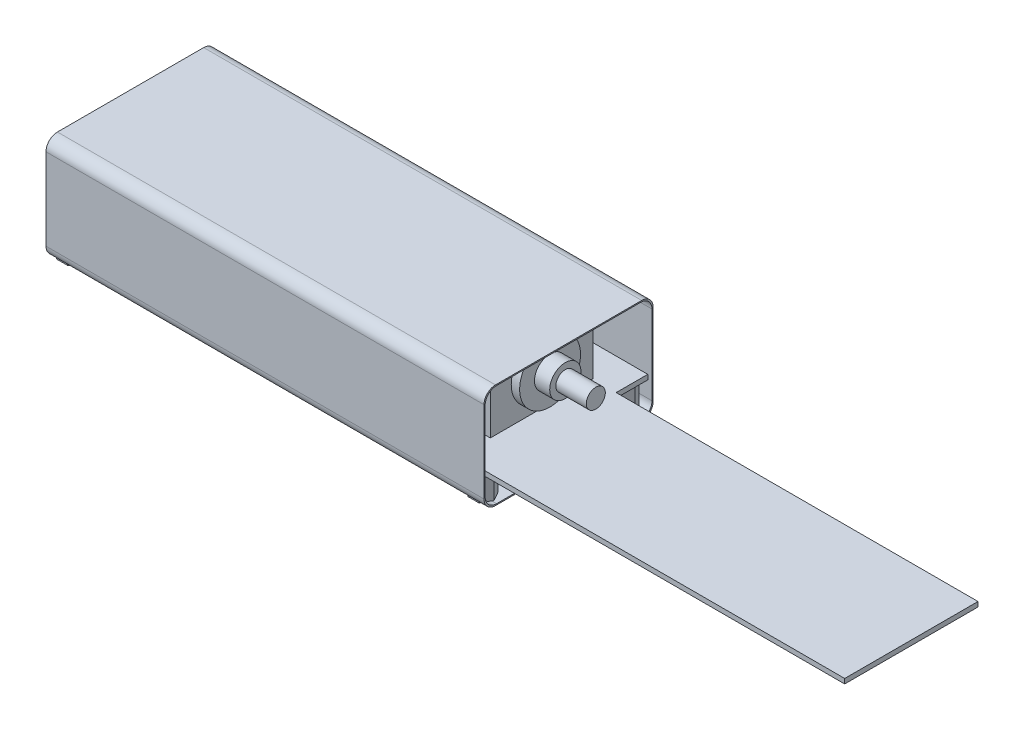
ISO-10303-21;
HEADER;
FILE_DESCRIPTION(('STEP AP214'),'2;1');
FILE_NAME('part.step','',(''),(''),'','','');
FILE_SCHEMA(('AUTOMOTIVE_DESIGN { 1 0 10303 214 1 1 1 1 }'));
ENDSEC;
DATA;
#1=APPLICATION_CONTEXT('core data for automotive mechanical design processes');
#2=APPLICATION_PROTOCOL_DEFINITION('international standard','automotive_design',2000,#1);
#3=PRODUCT_CONTEXT('',#1,'mechanical');
#4=PRODUCT('Part','Part','',(#3));
#5=PRODUCT_RELATED_PRODUCT_CATEGORY('part','',(#4));
#6=PRODUCT_DEFINITION_FORMATION('','',#4);
#7=PRODUCT_DEFINITION_CONTEXT('part definition',#1,'design');
#8=PRODUCT_DEFINITION('design','',#6,#7);
#9=PRODUCT_DEFINITION_SHAPE('','',#8);
#10=(LENGTH_UNIT() NAMED_UNIT(*) SI_UNIT(.MILLI.,.METRE.));
#11=(NAMED_UNIT(*) PLANE_ANGLE_UNIT() SI_UNIT($,.RADIAN.));
#12=(NAMED_UNIT(*) SI_UNIT($,.STERADIAN.) SOLID_ANGLE_UNIT());
#13=UNCERTAINTY_MEASURE_WITH_UNIT(LENGTH_MEASURE(1.E-05),#10,'distance_accuracy_value','');
#14=(GEOMETRIC_REPRESENTATION_CONTEXT(3) GLOBAL_UNCERTAINTY_ASSIGNED_CONTEXT((#13)) GLOBAL_UNIT_ASSIGNED_CONTEXT((#10,
#11,#12)) REPRESENTATION_CONTEXT('',''));
#15=CARTESIAN_POINT('',(0.,0.,0.));
#16=DIRECTION('',(0.,0.,1.));
#17=DIRECTION('',(1.,0.,0.));
#18=AXIS2_PLACEMENT_3D('',#15,#16,#17);
#19=CARTESIAN_POINT('',(0.,14.3002,-54.991));
#20=DIRECTION('',(0.,1.,0.));
#21=DIRECTION('',(0.,0.,1.));
#22=AXIS2_PLACEMENT_3D('',#19,#20,#21);
#23=PLANE('',#22);
#24=DIRECTION('',(-1.,0.,0.));
#25=VECTOR('',#24,1.);
#26=CARTESIAN_POINT('',(0.,14.3002,-5.07999999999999));
#27=LINE('',#26,#25);
#28=CARTESIAN_POINT('',(40.64,14.3002,-5.07999999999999));
#29=VERTEX_POINT('',#28);
#30=CARTESIAN_POINT('',(33.02,14.3002,-5.07999999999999));
#31=VERTEX_POINT('',#30);
#32=EDGE_CURVE('E895',#29,#31,#27,.T.);
#33=ORIENTED_EDGE('',*,*,#32,.T.);
#34=DIRECTION('',(0.,0.,-1.));
#35=VECTOR('',#34,1.);
#36=CARTESIAN_POINT('',(33.02,14.3002,-54.991));
#37=LINE('',#36,#35);
#38=CARTESIAN_POINT('',(33.02,14.3002,-7.61999999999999));
#39=VERTEX_POINT('',#38);
#40=EDGE_CURVE('E892',#31,#39,#37,.T.);
#41=ORIENTED_EDGE('',*,*,#40,.T.);
#42=DIRECTION('',(1.,0.,0.));
#43=VECTOR('',#42,1.);
#44=CARTESIAN_POINT('',(0.,14.3002,-7.62));
#45=LINE('',#44,#43);
#46=CARTESIAN_POINT('',(40.64,14.3002,-7.62));
#47=VERTEX_POINT('',#46);
#48=EDGE_CURVE('E900',#39,#47,#45,.T.);
#49=ORIENTED_EDGE('',*,*,#48,.T.);
#50=DIRECTION('',(0.,0.,1.));
#51=VECTOR('',#50,1.);
#52=CARTESIAN_POINT('',(40.64,14.3002,-54.991));
#53=LINE('',#52,#51);
#54=EDGE_CURVE('E897',#47,#29,#53,.T.);
#55=ORIENTED_EDGE('',*,*,#54,.T.);
#56=EDGE_LOOP('',(#33,#41,#49,#55));
#57=FACE_BOUND('',#56,.T.);
#58=DIRECTION('',(-1.,0.,0.));
#59=VECTOR('',#58,1.);
#60=CARTESIAN_POINT('',(0.,14.3002,-37.6555));
#61=LINE('',#60,#59);
#62=CARTESIAN_POINT('',(6.35,14.3002,-37.6555));
#63=VERTEX_POINT('',#62);
#64=CARTESIAN_POINT('',(0.,14.3002,-37.6555));
#65=VERTEX_POINT('',#64);
#66=EDGE_CURVE('E930',#63,#65,#61,.T.);
#67=ORIENTED_EDGE('',*,*,#66,.F.);
#68=DIRECTION('',(0.,0.,-1.));
#69=VECTOR('',#68,1.);
#70=CARTESIAN_POINT('',(6.35,14.3002,-54.991));
#71=LINE('',#70,#69);
#72=CARTESIAN_POINT('',(6.35,14.3002,-17.3355));
#73=VERTEX_POINT('',#72);
#74=EDGE_CURVE('E936',#73,#63,#71,.T.);
#75=ORIENTED_EDGE('',*,*,#74,.F.);
#76=DIRECTION('',(1.,0.,0.));
#77=VECTOR('',#76,1.);
#78=CARTESIAN_POINT('',(0.,14.3002,-17.3355));
#79=LINE('',#78,#77);
#80=CARTESIAN_POINT('',(0.,14.3002,-17.3355));
#81=VERTEX_POINT('',#80);
#82=EDGE_CURVE('E933',#81,#73,#79,.T.);
#83=ORIENTED_EDGE('',*,*,#82,.F.);
#84=DIRECTION('',(0.,0.,-1.));
#85=VECTOR('',#84,1.);
#86=CARTESIAN_POINT('',(0.,14.3002,0.));
#87=LINE('',#86,#85);
#88=CARTESIAN_POINT('',(0.,14.3002,0.));
#89=VERTEX_POINT('',#88);
#90=EDGE_CURVE('E963',#89,#81,#87,.T.);
#91=ORIENTED_EDGE('',*,*,#90,.F.);
#92=DIRECTION('',(1.,0.,0.));
#93=VECTOR('',#92,1.);
#94=CARTESIAN_POINT('',(0.,14.3002,0.));
#95=LINE('',#94,#93);
#96=CARTESIAN_POINT('',(87.884,14.3002,0.));
#97=VERTEX_POINT('',#96);
#98=EDGE_CURVE('E942',#89,#97,#95,.T.);
#99=ORIENTED_EDGE('',*,*,#98,.T.);
#100=DIRECTION('',(0.,0.,1.));
#101=VECTOR('',#100,1.);
#102=CARTESIAN_POINT('',(87.884,14.3002,-54.991));
#103=LINE('',#102,#101);
#104=CARTESIAN_POINT('',(87.884,14.3002,-54.991));
#105=VERTEX_POINT('',#104);
#106=EDGE_CURVE('E958',#105,#97,#103,.T.);
#107=ORIENTED_EDGE('',*,*,#106,.F.);
#108=DIRECTION('',(-1.,0.,0.));
#109=VECTOR('',#108,1.);
#110=CARTESIAN_POINT('',(87.884,14.3002,-54.991));
#111=LINE('',#110,#109);
#112=CARTESIAN_POINT('',(0.,14.3002,-54.991));
#113=VERTEX_POINT('',#112);
#114=EDGE_CURVE('E961',#105,#113,#111,.T.);
#115=ORIENTED_EDGE('',*,*,#114,.T.);
#116=EDGE_CURVE('E949',#65,#113,#87,.T.);
#117=ORIENTED_EDGE('',*,*,#116,.F.);
#118=EDGE_LOOP('',(#67,#75,#83,#91,#99,#107,#115,#117));
#119=FACE_BOUND('',#118,.T.);
#120=DIRECTION('',(-1.,0.,0.));
#121=VECTOR('',#120,1.);
#122=CARTESIAN_POINT('',(0.,14.3002,-42.291));
#123=LINE('',#122,#121);
#124=CARTESIAN_POINT('',(7.62,14.3002,-42.291));
#125=VERTEX_POINT('',#124);
#126=CARTESIAN_POINT('',(2.54,14.3002,-42.291));
#127=VERTEX_POINT('',#126);
#128=EDGE_CURVE('E40',#125,#127,#123,.T.);
#129=ORIENTED_EDGE('',*,*,#128,.T.);
#130=DIRECTION('',(0.,0.,-1.));
#131=VECTOR('',#130,1.);
#132=CARTESIAN_POINT('',(2.54,14.3002,-54.991));
#133=LINE('',#132,#131);
#134=CARTESIAN_POINT('',(2.54,14.3002,-52.451));
#135=VERTEX_POINT('',#134);
#136=EDGE_CURVE('E11',#127,#135,#133,.T.);
#137=ORIENTED_EDGE('',*,*,#136,.T.);
#138=DIRECTION('',(1.,0.,0.));
#139=VECTOR('',#138,1.);
#140=CARTESIAN_POINT('',(0.,14.3002,-52.451));
#141=LINE('',#140,#139);
#142=CARTESIAN_POINT('',(7.62,14.3002,-52.451));
#143=VERTEX_POINT('',#142);
#144=EDGE_CURVE('E889',#135,#143,#141,.T.);
#145=ORIENTED_EDGE('',*,*,#144,.T.);
#146=DIRECTION('',(0.,0.,1.));
#147=VECTOR('',#146,1.);
#148=CARTESIAN_POINT('',(7.62,14.3002,-54.991));
#149=LINE('',#148,#147);
#150=EDGE_CURVE('E886',#143,#125,#149,.T.);
#151=ORIENTED_EDGE('',*,*,#150,.T.);
#152=EDGE_LOOP('',(#129,#137,#145,#151));
#153=FACE_BOUND('',#152,.T.);
#154=ADVANCED_FACE('F31',(#57,#119,#153),#23,.T.);
#155=CARTESIAN_POINT('',(0.,0.,0.));
#156=DIRECTION('',(0.,-1.,0.));
#157=DIRECTION('',(0.,0.,-1.));
#158=AXIS2_PLACEMENT_3D('',#155,#156,#157);
#159=PLANE('',#158);
#160=DIRECTION('',(1.,0.,0.));
#161=VECTOR('',#160,1.);
#162=CARTESIAN_POINT('',(57.7365751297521,0.,-20.7534232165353));
#163=LINE('',#162,#161);
#164=CARTESIAN_POINT('',(57.7365751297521,0.,-20.7534232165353));
#165=VERTEX_POINT('',#164);
#166=CARTESIAN_POINT('',(77.7894013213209,0.,-20.7534232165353));
#167=VERTEX_POINT('',#166);
#168=EDGE_CURVE('E1016',#165,#167,#163,.T.);
#169=ORIENTED_EDGE('',*,*,#168,.F.);
#170=DIRECTION('',(0.,0.,-1.));
#171=VECTOR('',#170,1.);
#172=CARTESIAN_POINT('',(57.7365751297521,0.,-8.05342321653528));
#173=LINE('',#172,#171);
#174=CARTESIAN_POINT('',(57.7365751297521,0.,-8.05342321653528));
#175=VERTEX_POINT('',#174);
#176=EDGE_CURVE('E1018',#175,#165,#173,.T.);
#177=ORIENTED_EDGE('',*,*,#176,.F.);
#178=DIRECTION('',(-1.,0.,0.));
#179=VECTOR('',#178,1.);
#180=CARTESIAN_POINT('',(57.7365751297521,0.,-8.05342321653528));
#181=LINE('',#180,#179);
#182=CARTESIAN_POINT('',(77.7894013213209,0.,-8.05342321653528));
#183=VERTEX_POINT('',#182);
#184=EDGE_CURVE('E1010',#183,#175,#181,.T.);
#185=ORIENTED_EDGE('',*,*,#184,.F.);
#186=DIRECTION('',(0.,0.,1.));
#187=VECTOR('',#186,1.);
#188=CARTESIAN_POINT('',(77.7894013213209,0.,-8.05342321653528));
#189=LINE('',#188,#187);
#190=EDGE_CURVE('E1013',#167,#183,#189,.T.);
#191=ORIENTED_EDGE('',*,*,#190,.F.);
#192=EDGE_LOOP('',(#169,#177,#185,#191));
#193=FACE_BOUND('',#192,.T.);
#194=DIRECTION('',(0.,0.,-1.));
#195=VECTOR('',#194,1.);
#196=CARTESIAN_POINT('',(0.,0.,0.));
#197=LINE('',#196,#195);
#198=CARTESIAN_POINT('',(0.,0.,0.));
#199=VERTEX_POINT('',#198);
#200=CARTESIAN_POINT('',(0.,0.,-54.991));
#201=VERTEX_POINT('',#200);
#202=EDGE_CURVE('E871',#199,#201,#197,.T.);
#203=ORIENTED_EDGE('',*,*,#202,.T.);
#204=DIRECTION('',(-1.,0.,0.));
#205=VECTOR('',#204,1.);
#206=CARTESIAN_POINT('',(145.034,0.,-54.991));
#207=LINE('',#206,#205);
#208=CARTESIAN_POINT('',(145.034,0.,-54.991));
#209=VERTEX_POINT('',#208);
#210=EDGE_CURVE('E865',#209,#201,#207,.T.);
#211=ORIENTED_EDGE('',*,*,#210,.F.);
#212=DIRECTION('',(0.,0.,1.));
#213=VECTOR('',#212,1.);
#214=CARTESIAN_POINT('',(145.034,0.,-54.991));
#215=LINE('',#214,#213);
#216=CARTESIAN_POINT('',(145.034,0.,-44.45));
#217=VERTEX_POINT('',#216);
#218=EDGE_CURVE('E639',#209,#217,#215,.T.);
#219=ORIENTED_EDGE('',*,*,#218,.T.);
#220=DIRECTION('',(-1.,0.,0.));
#221=VECTOR('',#220,1.);
#222=CARTESIAN_POINT('',(265.684,2.20354401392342E-13,-44.4499999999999));
#223=LINE('',#222,#221);
#224=CARTESIAN_POINT('',(265.684,2.20354401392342E-13,-44.4499999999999));
#225=VERTEX_POINT('',#224);
#226=EDGE_CURVE('E646',#225,#217,#223,.T.);
#227=ORIENTED_EDGE('',*,*,#226,.F.);
#228=DIRECTION('',(0.,0.,-1.));
#229=VECTOR('',#228,1.);
#230=CARTESIAN_POINT('',(265.684,1.63673048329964E-13,1.01211963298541E-13));
#231=LINE('',#230,#229);
#232=CARTESIAN_POINT('',(265.684,1.63673048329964E-13,1.01211963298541E-13));
#233=VERTEX_POINT('',#232);
#234=EDGE_CURVE('E642',#233,#225,#231,.T.);
#235=ORIENTED_EDGE('',*,*,#234,.F.);
#236=DIRECTION('',(1.,0.,0.));
#237=VECTOR('',#236,1.);
#238=CARTESIAN_POINT('',(0.,0.,0.));
#239=LINE('',#238,#237);
#240=EDGE_CURVE('E627',#199,#233,#239,.T.);
#241=ORIENTED_EDGE('',*,*,#240,.F.);
#242=EDGE_LOOP('',(#203,#211,#219,#227,#235,#241));
#243=FACE_BOUND('',#242,.T.);
#244=DIRECTION('',(1.,0.,0.));
#245=VECTOR('',#244,1.);
#246=CARTESIAN_POINT('',(57.7365751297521,0.,-44.8083622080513));
#247=LINE('',#246,#245);
#248=CARTESIAN_POINT('',(57.7365751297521,0.,-44.8083622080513));
#249=VERTEX_POINT('',#248);
#250=CARTESIAN_POINT('',(77.7894013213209,0.,-44.8083622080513));
#251=VERTEX_POINT('',#250);
#252=EDGE_CURVE('E1048',#249,#251,#247,.T.);
#253=ORIENTED_EDGE('',*,*,#252,.F.);
#254=DIRECTION('',(0.,0.,-1.));
#255=VECTOR('',#254,1.);
#256=CARTESIAN_POINT('',(57.7365751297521,0.,-32.1083622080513));
#257=LINE('',#256,#255);
#258=CARTESIAN_POINT('',(57.7365751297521,0.,-32.1083622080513));
#259=VERTEX_POINT('',#258);
#260=EDGE_CURVE('E1050',#259,#249,#257,.T.);
#261=ORIENTED_EDGE('',*,*,#260,.F.);
#262=DIRECTION('',(-1.,0.,0.));
#263=VECTOR('',#262,1.);
#264=CARTESIAN_POINT('',(57.7365751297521,0.,-32.1083622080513));
#265=LINE('',#264,#263);
#266=CARTESIAN_POINT('',(77.7894013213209,0.,-32.1083622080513));
#267=VERTEX_POINT('',#266);
#268=EDGE_CURVE('E1042',#267,#259,#265,.T.);
#269=ORIENTED_EDGE('',*,*,#268,.F.);
#270=DIRECTION('',(0.,0.,1.));
#271=VECTOR('',#270,1.);
#272=CARTESIAN_POINT('',(77.7894013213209,0.,-32.1083622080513));
#273=LINE('',#272,#271);
#274=EDGE_CURVE('E1045',#251,#267,#273,.T.);
#275=ORIENTED_EDGE('',*,*,#274,.F.);
#276=EDGE_LOOP('',(#253,#261,#269,#275));
#277=FACE_BOUND('',#276,.T.);
#278=DIRECTION('',(1.,0.,0.));
#279=VECTOR('',#278,1.);
#280=CARTESIAN_POINT('',(139.263912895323,0.,-7.17549999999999));
#281=LINE('',#280,#279);
#282=CARTESIAN_POINT('',(139.263912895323,0.,-7.17549999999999));
#283=VERTEX_POINT('',#282);
#284=CARTESIAN_POINT('',(142.930087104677,0.,-7.17549999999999));
#285=VERTEX_POINT('',#284);
#286=EDGE_CURVE('E1157',#283,#285,#281,.T.);
#287=ORIENTED_EDGE('',*,*,#286,.F.);
#288=DIRECTION('',(0.500000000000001,0.,-0.866025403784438));
#289=VECTOR('',#288,1.);
#290=CARTESIAN_POINT('',(137.430825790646,0.,-4.0005));
#291=LINE('',#290,#289);
#292=CARTESIAN_POINT('',(137.430825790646,0.,-4.0005));
#293=VERTEX_POINT('',#292);
#294=EDGE_CURVE('E1159',#293,#283,#291,.T.);
#295=ORIENTED_EDGE('',*,*,#294,.F.);
#296=DIRECTION('',(-0.499999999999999,0.,-0.866025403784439));
#297=VECTOR('',#296,1.);
#298=CARTESIAN_POINT('',(139.263912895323,0.,-0.825500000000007));
#299=LINE('',#298,#297);
#300=CARTESIAN_POINT('',(139.263912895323,0.,-0.825500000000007));
#301=VERTEX_POINT('',#300);
#302=EDGE_CURVE('E1146',#301,#293,#299,.T.);
#303=ORIENTED_EDGE('',*,*,#302,.F.);
#304=DIRECTION('',(-1.,0.,0.));
#305=VECTOR('',#304,1.);
#306=CARTESIAN_POINT('',(142.930087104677,0.,-0.825500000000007));
#307=LINE('',#306,#305);
#308=CARTESIAN_POINT('',(142.930087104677,0.,-0.825500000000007));
#309=VERTEX_POINT('',#308);
#310=EDGE_CURVE('E1149',#309,#301,#307,.T.);
#311=ORIENTED_EDGE('',*,*,#310,.F.);
#312=DIRECTION('',(-0.500000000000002,0.,0.866025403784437));
#313=VECTOR('',#312,1.);
#314=CARTESIAN_POINT('',(144.763174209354,0.,-4.00049999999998));
#315=LINE('',#314,#313);
#316=CARTESIAN_POINT('',(144.763174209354,0.,-4.00049999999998));
#317=VERTEX_POINT('',#316);
#318=EDGE_CURVE('E1152',#317,#309,#315,.T.);
#319=ORIENTED_EDGE('',*,*,#318,.F.);
#320=DIRECTION('',(0.500000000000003,0.,0.866025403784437));
#321=VECTOR('',#320,1.);
#322=CARTESIAN_POINT('',(142.930087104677,0.,-7.17549999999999));
#323=LINE('',#322,#321);
#324=EDGE_CURVE('E1155',#285,#317,#323,.T.);
#325=ORIENTED_EDGE('',*,*,#324,.F.);
#326=EDGE_LOOP('',(#287,#295,#303,#311,#319,#325));
#327=FACE_BOUND('',#326,.T.);
#328=DIRECTION('',(0.499999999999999,0.,-0.866025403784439));
#329=VECTOR('',#328,1.);
#330=CARTESIAN_POINT('',(137.430825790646,0.,-50.9905));
#331=LINE('',#330,#329);
#332=CARTESIAN_POINT('',(137.430825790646,0.,-50.9905));
#333=VERTEX_POINT('',#332);
#334=CARTESIAN_POINT('',(139.263912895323,0.,-54.1655));
#335=VERTEX_POINT('',#334);
#336=EDGE_CURVE('E1207',#333,#335,#331,.T.);
#337=ORIENTED_EDGE('',*,*,#336,.F.);
#338=DIRECTION('',(-0.499999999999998,0.,-0.86602540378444));
#339=VECTOR('',#338,1.);
#340=CARTESIAN_POINT('',(139.263912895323,0.,-47.8155));
#341=LINE('',#340,#339);
#342=CARTESIAN_POINT('',(139.263912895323,0.,-47.8155));
#343=VERTEX_POINT('',#342);
#344=EDGE_CURVE('E1210',#343,#333,#341,.T.);
#345=ORIENTED_EDGE('',*,*,#344,.F.);
#346=DIRECTION('',(-1.,0.,0.));
#347=VECTOR('',#346,1.);
#348=CARTESIAN_POINT('',(142.930087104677,0.,-47.8155));
#349=LINE('',#348,#347);
#350=CARTESIAN_POINT('',(142.930087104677,0.,-47.8155));
#351=VERTEX_POINT('',#350);
#352=EDGE_CURVE('E1196',#351,#343,#349,.T.);
#353=ORIENTED_EDGE('',*,*,#352,.F.);
#354=DIRECTION('',(-0.499999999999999,0.,0.866025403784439));
#355=VECTOR('',#354,1.);
#356=CARTESIAN_POINT('',(144.763174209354,0.,-50.9905));
#357=LINE('',#356,#355);
#358=CARTESIAN_POINT('',(144.763174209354,0.,-50.9905));
#359=VERTEX_POINT('',#358);
#360=EDGE_CURVE('E1199',#359,#351,#357,.T.);
#361=ORIENTED_EDGE('',*,*,#360,.F.);
#362=DIRECTION('',(0.499999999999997,0.,0.86602540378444));
#363=VECTOR('',#362,1.);
#364=CARTESIAN_POINT('',(142.930087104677,0.,-54.1655));
#365=LINE('',#364,#363);
#366=CARTESIAN_POINT('',(142.930087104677,0.,-54.1655));
#367=VERTEX_POINT('',#366);
#368=EDGE_CURVE('E1202',#367,#359,#365,.T.);
#369=ORIENTED_EDGE('',*,*,#368,.F.);
#370=DIRECTION('',(1.,0.,0.));
#371=VECTOR('',#370,1.);
#372=CARTESIAN_POINT('',(139.263912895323,0.,-54.1655));
#373=LINE('',#372,#371);
#374=EDGE_CURVE('E1204',#335,#367,#373,.T.);
#375=ORIENTED_EDGE('',*,*,#374,.F.);
#376=EDGE_LOOP('',(#337,#345,#353,#361,#369,#375));
#377=FACE_BOUND('',#376,.T.);
#378=DIRECTION('',(1.,0.,0.));
#379=VECTOR('',#378,1.);
#380=CARTESIAN_POINT('',(2.10391289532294,0.,-7.1755));
#381=LINE('',#380,#379);
#382=CARTESIAN_POINT('',(2.10391289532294,0.,-7.1755));
#383=VERTEX_POINT('',#382);
#384=CARTESIAN_POINT('',(5.77008710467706,0.,-7.1755));
#385=VERTEX_POINT('',#384);
#386=EDGE_CURVE('E1259',#383,#385,#381,.T.);
#387=ORIENTED_EDGE('',*,*,#386,.F.);
#388=DIRECTION('',(0.5,0.,-0.866025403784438));
#389=VECTOR('',#388,1.);
#390=CARTESIAN_POINT('',(0.270825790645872,0.,-4.0005));
#391=LINE('',#390,#389);
#392=CARTESIAN_POINT('',(0.270825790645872,0.,-4.0005));
#393=VERTEX_POINT('',#392);
#394=EDGE_CURVE('E1261',#393,#383,#391,.T.);
#395=ORIENTED_EDGE('',*,*,#394,.F.);
#396=DIRECTION('',(-0.5,0.,-0.866025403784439));
#397=VECTOR('',#396,1.);
#398=CARTESIAN_POINT('',(2.10391289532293,0.,-0.825500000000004));
#399=LINE('',#398,#397);
#400=CARTESIAN_POINT('',(2.10391289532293,0.,-0.825500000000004));
#401=VERTEX_POINT('',#400);
#402=EDGE_CURVE('E1248',#401,#393,#399,.T.);
#403=ORIENTED_EDGE('',*,*,#402,.F.);
#404=DIRECTION('',(-1.,0.,0.));
#405=VECTOR('',#404,1.);
#406=CARTESIAN_POINT('',(5.77008710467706,0.,-0.825500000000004));
#407=LINE('',#406,#405);
#408=CARTESIAN_POINT('',(5.77008710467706,0.,-0.825500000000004));
#409=VERTEX_POINT('',#408);
#410=EDGE_CURVE('E1251',#409,#401,#407,.T.);
#411=ORIENTED_EDGE('',*,*,#410,.F.);
#412=DIRECTION('',(-0.500000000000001,0.,0.866025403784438));
#413=VECTOR('',#412,1.);
#414=CARTESIAN_POINT('',(7.60317420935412,0.,-4.0005));
#415=LINE('',#414,#413);
#416=CARTESIAN_POINT('',(7.60317420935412,0.,-4.0005));
#417=VERTEX_POINT('',#416);
#418=EDGE_CURVE('E1254',#417,#409,#415,.T.);
#419=ORIENTED_EDGE('',*,*,#418,.F.);
#420=DIRECTION('',(0.5,0.,0.866025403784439));
#421=VECTOR('',#420,1.);
#422=CARTESIAN_POINT('',(5.77008710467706,0.,-7.1755));
#423=LINE('',#422,#421);
#424=EDGE_CURVE('E1257',#385,#417,#423,.T.);
#425=ORIENTED_EDGE('',*,*,#424,.F.);
#426=EDGE_LOOP('',(#387,#395,#403,#411,#419,#425));
#427=FACE_BOUND('',#426,.T.);
#428=DIRECTION('',(0.5,0.,-0.866025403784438));
#429=VECTOR('',#428,1.);
#430=CARTESIAN_POINT('',(0.270825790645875,0.,-50.9905));
#431=LINE('',#430,#429);
#432=CARTESIAN_POINT('',(0.270825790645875,0.,-50.9905));
#433=VERTEX_POINT('',#432);
#434=CARTESIAN_POINT('',(2.10391289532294,0.,-54.1655));
#435=VERTEX_POINT('',#434);
#436=EDGE_CURVE('E1309',#433,#435,#431,.T.);
#437=ORIENTED_EDGE('',*,*,#436,.F.);
#438=DIRECTION('',(-0.499999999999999,0.,-0.866025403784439));
#439=VECTOR('',#438,1.);
#440=CARTESIAN_POINT('',(2.10391289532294,0.,-47.8155));
#441=LINE('',#440,#439);
#442=CARTESIAN_POINT('',(2.10391289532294,0.,-47.8155));
#443=VERTEX_POINT('',#442);
#444=EDGE_CURVE('E1312',#443,#433,#441,.T.);
#445=ORIENTED_EDGE('',*,*,#444,.F.);
#446=DIRECTION('',(-1.,0.,0.));
#447=VECTOR('',#446,1.);
#448=CARTESIAN_POINT('',(5.77008710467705,0.,-47.8155));
#449=LINE('',#448,#447);
#450=CARTESIAN_POINT('',(5.77008710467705,0.,-47.8155));
#451=VERTEX_POINT('',#450);
#452=EDGE_CURVE('E1298',#451,#443,#449,.T.);
#453=ORIENTED_EDGE('',*,*,#452,.F.);
#454=DIRECTION('',(-0.500000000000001,0.,0.866025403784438));
#455=VECTOR('',#454,1.);
#456=CARTESIAN_POINT('',(7.60317420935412,0.,-50.9905));
#457=LINE('',#456,#455);
#458=CARTESIAN_POINT('',(7.60317420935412,0.,-50.9905));
#459=VERTEX_POINT('',#458);
#460=EDGE_CURVE('E1301',#459,#451,#457,.T.);
#461=ORIENTED_EDGE('',*,*,#460,.F.);
#462=DIRECTION('',(0.499999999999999,0.,0.866025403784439));
#463=VECTOR('',#462,1.);
#464=CARTESIAN_POINT('',(5.77008710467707,0.,-54.1655));
#465=LINE('',#464,#463);
#466=CARTESIAN_POINT('',(5.77008710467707,0.,-54.1655));
#467=VERTEX_POINT('',#466);
#468=EDGE_CURVE('E1304',#467,#459,#465,.T.);
#469=ORIENTED_EDGE('',*,*,#468,.F.);
#470=DIRECTION('',(1.,0.,0.));
#471=VECTOR('',#470,1.);
#472=CARTESIAN_POINT('',(2.10391289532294,0.,-54.1655));
#473=LINE('',#472,#471);
#474=EDGE_CURVE('E1306',#435,#467,#473,.T.);
#475=ORIENTED_EDGE('',*,*,#474,.F.);
#476=EDGE_LOOP('',(#437,#445,#453,#461,#469,#475));
#477=FACE_BOUND('',#476,.T.);
#478=ADVANCED_FACE('F643',(#193,#243,#277,#327,#377,#427,#477),#159,.T.);
#479=CARTESIAN_POINT('',(137.16,24.2062,-10.3505000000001));
#480=DIRECTION('',(-1.,0.,0.));
#481=DIRECTION('',(0.,0.,1.));
#482=AXIS2_PLACEMENT_3D('',#479,#480,#481);
#483=PLANE('',#482);
#484=DIRECTION('',(0.,0.,-1.));
#485=VECTOR('',#484,1.);
#486=CARTESIAN_POINT('',(137.16,1.6002,-10.3505000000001));
#487=LINE('',#486,#485);
#488=CARTESIAN_POINT('',(137.16,1.6002,-10.3505000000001));
#489=VERTEX_POINT('',#488);
#490=CARTESIAN_POINT('',(137.16,1.6002,-44.6405));
#491=VERTEX_POINT('',#490);
#492=EDGE_CURVE('E1080',#489,#491,#487,.T.);
#493=ORIENTED_EDGE('',*,*,#492,.T.);
#494=DIRECTION('',(0.,-1.,0.));
#495=VECTOR('',#494,1.);
#496=CARTESIAN_POINT('',(137.16,24.2062,-44.6405));
#497=LINE('',#496,#495);
#498=CARTESIAN_POINT('',(137.16,24.2062,-44.6405));
#499=VERTEX_POINT('',#498);
#500=EDGE_CURVE('E1069',#499,#491,#497,.T.);
#501=ORIENTED_EDGE('',*,*,#500,.F.);
#502=DIRECTION('',(0.,0.,-1.));
#503=VECTOR('',#502,1.);
#504=CARTESIAN_POINT('',(137.16,24.2062,-10.3505000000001));
#505=LINE('',#504,#503);
#506=CARTESIAN_POINT('',(137.16,24.2062,-10.3505000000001));
#507=VERTEX_POINT('',#506);
#508=EDGE_CURVE('E1090',#507,#499,#505,.T.);
#509=ORIENTED_EDGE('',*,*,#508,.F.);
#510=DIRECTION('',(0.,-1.,0.));
#511=VECTOR('',#510,1.);
#512=CARTESIAN_POINT('',(137.16,24.2062,-10.3505000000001));
#513=LINE('',#512,#511);
#514=EDGE_CURVE('E1066',#507,#489,#513,.T.);
#515=ORIENTED_EDGE('',*,*,#514,.T.);
#516=EDGE_LOOP('',(#493,#501,#509,#515));
#517=FACE_BOUND('',#516,.T.);
#518=CARTESIAN_POINT('',(137.16,13.5382,-27.4955000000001));
#519=DIRECTION('',(-1.,0.,0.));
#520=DIRECTION('',(0.,0.,1.));
#521=AXIS2_PLACEMENT_3D('',#518,#519,#520);
#522=CIRCLE('',#521,10.16);
#523=CARTESIAN_POINT('',(137.16,13.5382,-17.3355000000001));
#524=VERTEX_POINT('',#523);
#525=EDGE_CURVE('E924',#524,#524,#522,.F.);
#526=ORIENTED_EDGE('',*,*,#525,.F.);
#527=EDGE_LOOP('',(#526));
#528=FACE_BOUND('',#527,.T.);
#529=ADVANCED_FACE('F830',(#517,#528),#483,.F.);
#530=CARTESIAN_POINT('',(0.,1.6002,0.));
#531=DIRECTION('',(0.,-1.,0.));
#532=DIRECTION('',(0.,0.,-1.));
#533=AXIS2_PLACEMENT_3D('',#530,#531,#532);
#534=PLANE('',#533);
#535=DIRECTION('',(-1.,0.,0.));
#536=VECTOR('',#535,1.);
#537=CARTESIAN_POINT('',(145.034,1.6002,-54.991));
#538=LINE('',#537,#536);
#539=CARTESIAN_POINT('',(145.034,1.6002,-54.991));
#540=VERTEX_POINT('',#539);
#541=CARTESIAN_POINT('',(87.884,1.6002,-54.991));
#542=VERTEX_POINT('',#541);
#543=EDGE_CURVE('E638',#540,#542,#538,.T.);
#544=ORIENTED_EDGE('',*,*,#543,.T.);
#545=DIRECTION('',(0.,0.,1.));
#546=VECTOR('',#545,1.);
#547=CARTESIAN_POINT('',(87.884,1.6002,-54.991));
#548=LINE('',#547,#546);
#549=CARTESIAN_POINT('',(87.884,1.6002,0.));
#550=VERTEX_POINT('',#549);
#551=EDGE_CURVE('E945',#542,#550,#548,.T.);
#552=ORIENTED_EDGE('',*,*,#551,.T.);
#553=DIRECTION('',(1.,0.,0.));
#554=VECTOR('',#553,1.);
#555=CARTESIAN_POINT('',(0.,1.6002,0.));
#556=LINE('',#555,#554);
#557=CARTESIAN_POINT('',(265.684,1.60019999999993,1.01211963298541E-13));
#558=VERTEX_POINT('',#557);
#559=EDGE_CURVE('E1963',#550,#558,#556,.T.);
#560=ORIENTED_EDGE('',*,*,#559,.T.);
#561=DIRECTION('',(0.,0.,1.));
#562=VECTOR('',#561,1.);
#563=CARTESIAN_POINT('',(265.684,1.60019999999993,1.01211963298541E-13));
#564=LINE('',#563,#562);
#565=CARTESIAN_POINT('',(265.684,1.60019999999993,-44.4499999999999));
#566=VERTEX_POINT('',#565);
#567=EDGE_CURVE('E654',#566,#558,#564,.T.);
#568=ORIENTED_EDGE('',*,*,#567,.F.);
#569=DIRECTION('',(-1.,0.,0.));
#570=VECTOR('',#569,1.);
#571=CARTESIAN_POINT('',(265.684,1.60019999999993,-44.4499999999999));
#572=LINE('',#571,#570);
#573=CARTESIAN_POINT('',(145.034,1.60019999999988,-44.45));
#574=VERTEX_POINT('',#573);
#575=EDGE_CURVE('E660',#566,#574,#572,.T.);
#576=ORIENTED_EDGE('',*,*,#575,.T.);
#577=DIRECTION('',(0.,0.,1.));
#578=VECTOR('',#577,1.);
#579=CARTESIAN_POINT('',(145.034,1.6002,-54.991));
#580=LINE('',#579,#578);
#581=EDGE_CURVE('E666',#540,#574,#580,.T.);
#582=ORIENTED_EDGE('',*,*,#581,.F.);
#583=EDGE_LOOP('',(#544,#552,#560,#568,#576,#582));
#584=FACE_BOUND('',#583,.T.);
#585=DIRECTION('',(0.,0.,1.));
#586=VECTOR('',#585,1.);
#587=CARTESIAN_POINT('',(124.714,1.6002,-44.6405));
#588=LINE('',#587,#586);
#589=CARTESIAN_POINT('',(124.714,1.6002,-44.6405));
#590=VERTEX_POINT('',#589);
#591=CARTESIAN_POINT('',(124.714,1.6002,-10.3505));
#592=VERTEX_POINT('',#591);
#593=EDGE_CURVE('E1085',#590,#592,#588,.T.);
#594=ORIENTED_EDGE('',*,*,#593,.F.);
#595=DIRECTION('',(-1.,0.,0.));
#596=VECTOR('',#595,1.);
#597=CARTESIAN_POINT('',(137.16,1.6002,-44.6405));
#598=LINE('',#597,#596);
#599=EDGE_CURVE('E1076',#491,#590,#598,.T.);
#600=ORIENTED_EDGE('',*,*,#599,.F.);
#601=ORIENTED_EDGE('',*,*,#492,.F.);
#602=DIRECTION('',(-1.,0.,0.));
#603=VECTOR('',#602,1.);
#604=CARTESIAN_POINT('',(137.16,1.6002,-10.3505000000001));
#605=LINE('',#604,#603);
#606=EDGE_CURVE('E1083',#489,#592,#605,.T.);
#607=ORIENTED_EDGE('',*,*,#606,.T.);
#608=EDGE_LOOP('',(#594,#600,#601,#607));
#609=FACE_BOUND('',#608,.T.);
#610=ADVANCED_FACE('F845',(#584,#609),#534,.F.);
#611=CARTESIAN_POINT('',(0.,1.6002,0.));
#612=DIRECTION('',(-1.,0.,0.));
#613=DIRECTION('',(0.,0.,1.));
#614=AXIS2_PLACEMENT_3D('',#611,#612,#613);
#615=PLANE('',#614);
#616=DIRECTION('',(0.,-1.,0.));
#617=VECTOR('',#616,1.);
#618=CARTESIAN_POINT('',(0.,1.6002,-37.6555));
#619=LINE('',#618,#617);
#620=CARTESIAN_POINT('',(0.,8.88999999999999,-37.6555));
#621=VERTEX_POINT('',#620);
#622=EDGE_CURVE('E950',#65,#621,#619,.T.);
#623=ORIENTED_EDGE('',*,*,#622,.F.);
#624=ORIENTED_EDGE('',*,*,#116,.T.);
#625=DIRECTION('',(0.,-1.,0.));
#626=VECTOR('',#625,1.);
#627=CARTESIAN_POINT('',(0.,1.6002,-54.991));
#628=LINE('',#627,#626);
#629=EDGE_CURVE('E867',#113,#201,#628,.T.);
#630=ORIENTED_EDGE('',*,*,#629,.T.);
#631=ORIENTED_EDGE('',*,*,#202,.F.);
#632=DIRECTION('',(0.,-1.,0.));
#633=VECTOR('',#632,1.);
#634=CARTESIAN_POINT('',(0.,1.6002,0.));
#635=LINE('',#634,#633);
#636=EDGE_CURVE('E634',#89,#199,#635,.T.);
#637=ORIENTED_EDGE('',*,*,#636,.F.);
#638=ORIENTED_EDGE('',*,*,#90,.T.);
#639=DIRECTION('',(0.,1.,0.));
#640=VECTOR('',#639,1.);
#641=CARTESIAN_POINT('',(0.,1.6002,-17.3355));
#642=LINE('',#641,#640);
#643=CARTESIAN_POINT('',(0.,8.89,-17.3355));
#644=VERTEX_POINT('',#643);
#645=EDGE_CURVE('E968',#644,#81,#642,.T.);
#646=ORIENTED_EDGE('',*,*,#645,.F.);
#647=DIRECTION('',(0.,0.,1.));
#648=VECTOR('',#647,1.);
#649=CARTESIAN_POINT('',(0.,8.89,0.));
#650=LINE('',#649,#648);
#651=EDGE_CURVE('E927',#621,#644,#650,.T.);
#652=ORIENTED_EDGE('',*,*,#651,.F.);
#653=EDGE_LOOP('',(#623,#624,#630,#631,#637,#638,#646,#652));
#654=FACE_BOUND('',#653,.T.);
#655=ADVANCED_FACE('F33',(#654),#615,.T.);
#656=CARTESIAN_POINT('',(0.,1.6002,0.));
#657=DIRECTION('',(0.,0.,-1.));
#658=DIRECTION('',(-1.,0.,0.));
#659=AXIS2_PLACEMENT_3D('',#656,#657,#658);
#660=PLANE('',#659);
#661=ORIENTED_EDGE('',*,*,#240,.T.);
#662=DIRECTION('',(0.,-1.,0.));
#663=VECTOR('',#662,1.);
#664=CARTESIAN_POINT('',(265.684,1.60019999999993,1.01211963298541E-13));
#665=LINE('',#664,#663);
#666=EDGE_CURVE('E632',#558,#233,#665,.T.);
#667=ORIENTED_EDGE('',*,*,#666,.F.);
#668=ORIENTED_EDGE('',*,*,#559,.F.);
#669=DIRECTION('',(0.,-1.,0.));
#670=VECTOR('',#669,1.);
#671=CARTESIAN_POINT('',(87.884,14.3002,0.));
#672=LINE('',#671,#670);
#673=EDGE_CURVE('E874',#97,#550,#672,.T.);
#674=ORIENTED_EDGE('',*,*,#673,.F.);
#675=ORIENTED_EDGE('',*,*,#98,.F.);
#676=ORIENTED_EDGE('',*,*,#636,.T.);
#677=EDGE_LOOP('',(#661,#667,#668,#674,#675,#676));
#678=FACE_BOUND('',#677,.T.);
#679=ADVANCED_FACE('F629',(#678),#660,.F.);
#680=CARTESIAN_POINT('',(145.034,1.6002,-54.991));
#681=DIRECTION('',(1.,0.,0.));
#682=DIRECTION('',(0.,0.,-1.));
#683=AXIS2_PLACEMENT_3D('',#680,#681,#682);
#684=PLANE('',#683);
#685=DIRECTION('',(0.,1.,0.));
#686=VECTOR('',#685,1.);
#687=CARTESIAN_POINT('',(145.034,1.60019999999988,-44.45));
#688=LINE('',#687,#686);
#689=EDGE_CURVE('E48',#217,#574,#688,.T.);
#690=ORIENTED_EDGE('',*,*,#689,.F.);
#691=ORIENTED_EDGE('',*,*,#218,.F.);
#692=DIRECTION('',(0.,-1.,0.));
#693=VECTOR('',#692,1.);
#694=CARTESIAN_POINT('',(145.034,1.6002,-54.991));
#695=LINE('',#694,#693);
#696=EDGE_CURVE('E870',#540,#209,#695,.T.);
#697=ORIENTED_EDGE('',*,*,#696,.F.);
#698=ORIENTED_EDGE('',*,*,#581,.T.);
#699=EDGE_LOOP('',(#690,#691,#697,#698));
#700=FACE_BOUND('',#699,.T.);
#701=ADVANCED_FACE('F856',(#700),#684,.T.);
#702=CARTESIAN_POINT('',(145.034,1.6002,-54.991));
#703=DIRECTION('',(0.,0.,1.));
#704=DIRECTION('',(1.,0.,0.));
#705=AXIS2_PLACEMENT_3D('',#702,#703,#704);
#706=PLANE('',#705);
#707=ORIENTED_EDGE('',*,*,#210,.T.);
#708=ORIENTED_EDGE('',*,*,#629,.F.);
#709=ORIENTED_EDGE('',*,*,#114,.F.);
#710=DIRECTION('',(0.,-1.,0.));
#711=VECTOR('',#710,1.);
#712=CARTESIAN_POINT('',(87.884,14.3002,-54.991));
#713=LINE('',#712,#711);
#714=EDGE_CURVE('E876',#105,#542,#713,.T.);
#715=ORIENTED_EDGE('',*,*,#714,.T.);
#716=ORIENTED_EDGE('',*,*,#543,.F.);
#717=ORIENTED_EDGE('',*,*,#696,.T.);
#718=EDGE_LOOP('',(#707,#708,#709,#715,#716,#717));
#719=FACE_BOUND('',#718,.T.);
#720=ADVANCED_FACE('F843',(#719),#706,.F.);
#721=CARTESIAN_POINT('',(87.884,14.3002,-54.991));
#722=DIRECTION('',(1.,0.,0.));
#723=DIRECTION('',(0.,0.,-1.));
#724=AXIS2_PLACEMENT_3D('',#721,#722,#723);
#725=PLANE('',#724);
#726=ORIENTED_EDGE('',*,*,#551,.F.);
#727=ORIENTED_EDGE('',*,*,#714,.F.);
#728=ORIENTED_EDGE('',*,*,#106,.T.);
#729=ORIENTED_EDGE('',*,*,#673,.T.);
#730=EDGE_LOOP('',(#726,#727,#728,#729));
#731=FACE_BOUND('',#730,.T.);
#732=ADVANCED_FACE('F840',(#731),#725,.T.);
#733=CARTESIAN_POINT('',(6.35,8.88999999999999,-37.6555));
#734=DIRECTION('',(0.,0.,-1.));
#735=DIRECTION('',(-1.,0.,0.));
#736=AXIS2_PLACEMENT_3D('',#733,#734,#735);
#737=PLANE('',#736);
#738=ORIENTED_EDGE('',*,*,#66,.T.);
#739=ORIENTED_EDGE('',*,*,#622,.T.);
#740=DIRECTION('',(-1.,0.,0.));
#741=VECTOR('',#740,1.);
#742=CARTESIAN_POINT('',(6.35,8.88999999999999,-37.6555));
#743=LINE('',#742,#741);
#744=CARTESIAN_POINT('',(-2.54,8.88999999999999,-37.6555));
#745=VERTEX_POINT('',#744);
#746=EDGE_CURVE('E972',#621,#745,#743,.T.);
#747=ORIENTED_EDGE('',*,*,#746,.T.);
#748=DIRECTION('',(0.,-1.,0.));
#749=VECTOR('',#748,1.);
#750=CARTESIAN_POINT('',(-2.54,8.88999999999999,-37.6555));
#751=LINE('',#750,#749);
#752=CARTESIAN_POINT('',(-2.54,18.034,-37.6555));
#753=VERTEX_POINT('',#752);
#754=EDGE_CURVE('E996',#753,#745,#751,.T.);
#755=ORIENTED_EDGE('',*,*,#754,.F.);
#756=DIRECTION('',(-1.,0.,0.));
#757=VECTOR('',#756,1.);
#758=CARTESIAN_POINT('',(6.35,18.034,-37.6555));
#759=LINE('',#758,#757);
#760=CARTESIAN_POINT('',(6.35,18.034,-37.6555));
#761=VERTEX_POINT('',#760);
#762=EDGE_CURVE('E971',#761,#753,#759,.T.);
#763=ORIENTED_EDGE('',*,*,#762,.F.);
#764=DIRECTION('',(0.,-1.,0.));
#765=VECTOR('',#764,1.);
#766=CARTESIAN_POINT('',(6.35,8.88999999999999,-37.6555));
#767=LINE('',#766,#765);
#768=EDGE_CURVE('E984',#761,#63,#767,.T.);
#769=ORIENTED_EDGE('',*,*,#768,.T.);
#770=EDGE_LOOP('',(#738,#739,#747,#755,#763,#769));
#771=FACE_BOUND('',#770,.T.);
#772=ADVANCED_FACE('F838',(#771),#737,.T.);
#773=CARTESIAN_POINT('',(6.35,18.034,-37.6555));
#774=DIRECTION('',(0.,1.,0.));
#775=DIRECTION('',(0.,0.,1.));
#776=AXIS2_PLACEMENT_3D('',#773,#774,#775);
#777=PLANE('',#776);
#778=ORIENTED_EDGE('',*,*,#762,.T.);
#779=DIRECTION('',(0.,0.,-1.));
#780=VECTOR('',#779,1.);
#781=CARTESIAN_POINT('',(-2.54,18.034,-37.6555));
#782=LINE('',#781,#780);
#783=CARTESIAN_POINT('',(-2.54,18.034,-17.3355));
#784=VERTEX_POINT('',#783);
#785=EDGE_CURVE('E987',#784,#753,#782,.T.);
#786=ORIENTED_EDGE('',*,*,#785,.F.);
#787=DIRECTION('',(-1.,0.,0.));
#788=VECTOR('',#787,1.);
#789=CARTESIAN_POINT('',(6.35,18.034,-17.3355));
#790=LINE('',#789,#788);
#791=CARTESIAN_POINT('',(6.35,18.034,-17.3355));
#792=VERTEX_POINT('',#791);
#793=EDGE_CURVE('E977',#792,#784,#790,.T.);
#794=ORIENTED_EDGE('',*,*,#793,.F.);
#795=DIRECTION('',(0.,0.,-1.));
#796=VECTOR('',#795,1.);
#797=CARTESIAN_POINT('',(6.35,18.034,-37.6555));
#798=LINE('',#797,#796);
#799=EDGE_CURVE('E975',#792,#761,#798,.T.);
#800=ORIENTED_EDGE('',*,*,#799,.T.);
#801=EDGE_LOOP('',(#778,#786,#794,#800));
#802=FACE_BOUND('',#801,.T.);
#803=ADVANCED_FACE('F1940',(#802),#777,.T.);
#804=CARTESIAN_POINT('',(6.35,8.89,-17.3355));
#805=DIRECTION('',(0.,0.,1.));
#806=DIRECTION('',(1.,0.,0.));
#807=AXIS2_PLACEMENT_3D('',#804,#805,#806);
#808=PLANE('',#807);
#809=DIRECTION('',(-1.,0.,0.));
#810=VECTOR('',#809,1.);
#811=CARTESIAN_POINT('',(6.35,8.89,-17.3355));
#812=LINE('',#811,#810);
#813=CARTESIAN_POINT('',(-2.54,8.89,-17.3355));
#814=VERTEX_POINT('',#813);
#815=EDGE_CURVE('E974',#644,#814,#812,.T.);
#816=ORIENTED_EDGE('',*,*,#815,.F.);
#817=ORIENTED_EDGE('',*,*,#645,.T.);
#818=ORIENTED_EDGE('',*,*,#82,.T.);
#819=DIRECTION('',(0.,1.,0.));
#820=VECTOR('',#819,1.);
#821=CARTESIAN_POINT('',(6.35,8.89,-17.3355));
#822=LINE('',#821,#820);
#823=EDGE_CURVE('E982',#73,#792,#822,.T.);
#824=ORIENTED_EDGE('',*,*,#823,.T.);
#825=ORIENTED_EDGE('',*,*,#793,.T.);
#826=DIRECTION('',(0.,1.,0.));
#827=VECTOR('',#826,1.);
#828=CARTESIAN_POINT('',(-2.54,8.89,-17.3355));
#829=LINE('',#828,#827);
#830=EDGE_CURVE('E990',#814,#784,#829,.T.);
#831=ORIENTED_EDGE('',*,*,#830,.F.);
#832=EDGE_LOOP('',(#816,#817,#818,#824,#825,#831));
#833=FACE_BOUND('',#832,.T.);
#834=ADVANCED_FACE('F1943',(#833),#808,.T.);
#835=CARTESIAN_POINT('',(6.35,8.88999999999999,-37.6555));
#836=DIRECTION('',(0.,-1.,0.));
#837=DIRECTION('',(0.,0.,-1.));
#838=AXIS2_PLACEMENT_3D('',#835,#836,#837);
#839=PLANE('',#838);
#840=ORIENTED_EDGE('',*,*,#746,.F.);
#841=ORIENTED_EDGE('',*,*,#651,.T.);
#842=ORIENTED_EDGE('',*,*,#815,.T.);
#843=DIRECTION('',(0.,0.,1.));
#844=VECTOR('',#843,1.);
#845=CARTESIAN_POINT('',(-2.54,8.88999999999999,-37.6555));
#846=LINE('',#845,#844);
#847=EDGE_CURVE('E993',#745,#814,#846,.T.);
#848=ORIENTED_EDGE('',*,*,#847,.F.);
#849=EDGE_LOOP('',(#840,#841,#842,#848));
#850=FACE_BOUND('',#849,.T.);
#851=ADVANCED_FACE('F1938',(#850),#839,.T.);
#852=CARTESIAN_POINT('',(6.35,18.034,-37.6555));
#853=DIRECTION('',(1.,0.,0.));
#854=DIRECTION('',(0.,0.,-1.));
#855=AXIS2_PLACEMENT_3D('',#852,#853,#854);
#856=PLANE('',#855);
#857=ORIENTED_EDGE('',*,*,#823,.F.);
#858=ORIENTED_EDGE('',*,*,#74,.T.);
#859=ORIENTED_EDGE('',*,*,#768,.F.);
#860=ORIENTED_EDGE('',*,*,#799,.F.);
#861=EDGE_LOOP('',(#857,#858,#859,#860));
#862=FACE_BOUND('',#861,.T.);
#863=ADVANCED_FACE('F1934',(#862),#856,.T.);
#864=CARTESIAN_POINT('',(-2.54,18.034,-37.6555));
#865=DIRECTION('',(1.,0.,0.));
#866=DIRECTION('',(0.,0.,-1.));
#867=AXIS2_PLACEMENT_3D('',#864,#865,#866);
#868=PLANE('',#867);
#869=ORIENTED_EDGE('',*,*,#754,.T.);
#870=ORIENTED_EDGE('',*,*,#847,.T.);
#871=ORIENTED_EDGE('',*,*,#830,.T.);
#872=ORIENTED_EDGE('',*,*,#785,.T.);
#873=EDGE_LOOP('',(#869,#870,#871,#872));
#874=FACE_BOUND('',#873,.T.);
#875=ADVANCED_FACE('F1930',(#874),#868,.F.);
#876=CARTESIAN_POINT('',(57.7365751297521,-9.525,-8.05342321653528));
#877=DIRECTION('',(1.,0.,0.));
#878=DIRECTION('',(0.,0.,-1.));
#879=AXIS2_PLACEMENT_3D('',#876,#877,#878);
#880=PLANE('',#879);
#881=ORIENTED_EDGE('',*,*,#176,.T.);
#882=DIRECTION('',(0.,1.,0.));
#883=VECTOR('',#882,1.);
#884=CARTESIAN_POINT('',(57.7365751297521,-9.525,-20.7534232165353));
#885=LINE('',#884,#883);
#886=CARTESIAN_POINT('',(57.7365751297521,-9.525,-20.7534232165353));
#887=VERTEX_POINT('',#886);
#888=EDGE_CURVE('E999',#887,#165,#885,.T.);
#889=ORIENTED_EDGE('',*,*,#888,.F.);
#890=DIRECTION('',(0.,0.,-1.));
#891=VECTOR('',#890,1.);
#892=CARTESIAN_POINT('',(57.7365751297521,-9.525,-8.05342321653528));
#893=LINE('',#892,#891);
#894=CARTESIAN_POINT('',(57.7365751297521,-9.525,-8.05342321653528));
#895=VERTEX_POINT('',#894);
#896=EDGE_CURVE('E1012',#895,#887,#893,.T.);
#897=ORIENTED_EDGE('',*,*,#896,.F.);
#898=DIRECTION('',(0.,1.,0.));
#899=VECTOR('',#898,1.);
#900=CARTESIAN_POINT('',(57.7365751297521,-9.525,-8.05342321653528));
#901=LINE('',#900,#899);
#902=EDGE_CURVE('E1006',#895,#175,#901,.T.);
#903=ORIENTED_EDGE('',*,*,#902,.T.);
#904=EDGE_LOOP('',(#881,#889,#897,#903));
#905=FACE_BOUND('',#904,.T.);
#906=ADVANCED_FACE('F1926',(#905),#880,.F.);
#907=CARTESIAN_POINT('',(57.7365751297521,-9.525,-20.7534232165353));
#908=DIRECTION('',(0.,0.,1.));
#909=DIRECTION('',(1.,0.,0.));
#910=AXIS2_PLACEMENT_3D('',#907,#908,#909);
#911=PLANE('',#910);
#912=ORIENTED_EDGE('',*,*,#168,.T.);
#913=DIRECTION('',(0.,1.,0.));
#914=VECTOR('',#913,1.);
#915=CARTESIAN_POINT('',(77.7894013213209,-9.525,-20.7534232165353));
#916=LINE('',#915,#914);
#917=CARTESIAN_POINT('',(77.7894013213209,-9.525,-20.7534232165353));
#918=VERTEX_POINT('',#917);
#919=EDGE_CURVE('E1001',#918,#167,#916,.T.);
#920=ORIENTED_EDGE('',*,*,#919,.F.);
#921=DIRECTION('',(1.,0.,0.));
#922=VECTOR('',#921,1.);
#923=CARTESIAN_POINT('',(57.7365751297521,-9.525,-20.7534232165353));
#924=LINE('',#923,#922);
#925=EDGE_CURVE('E1027',#887,#918,#924,.T.);
#926=ORIENTED_EDGE('',*,*,#925,.F.);
#927=ORIENTED_EDGE('',*,*,#888,.T.);
#928=EDGE_LOOP('',(#912,#920,#926,#927));
#929=FACE_BOUND('',#928,.T.);
#930=ADVANCED_FACE('F1922',(#929),#911,.F.);
#931=CARTESIAN_POINT('',(77.7894013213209,-9.525,-8.05342321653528));
#932=DIRECTION('',(-1.,0.,0.));
#933=DIRECTION('',(0.,0.,1.));
#934=AXIS2_PLACEMENT_3D('',#931,#932,#933);
#935=PLANE('',#934);
#936=ORIENTED_EDGE('',*,*,#190,.T.);
#937=DIRECTION('',(0.,1.,0.));
#938=VECTOR('',#937,1.);
#939=CARTESIAN_POINT('',(77.7894013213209,-9.525,-8.05342321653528));
#940=LINE('',#939,#938);
#941=CARTESIAN_POINT('',(77.7894013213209,-9.525,-8.05342321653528));
#942=VERTEX_POINT('',#941);
#943=EDGE_CURVE('E1004',#942,#183,#940,.T.);
#944=ORIENTED_EDGE('',*,*,#943,.F.);
#945=DIRECTION('',(0.,0.,1.));
#946=VECTOR('',#945,1.);
#947=CARTESIAN_POINT('',(77.7894013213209,-9.525,-8.05342321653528));
#948=LINE('',#947,#946);
#949=EDGE_CURVE('E1024',#918,#942,#948,.T.);
#950=ORIENTED_EDGE('',*,*,#949,.F.);
#951=ORIENTED_EDGE('',*,*,#919,.T.);
#952=EDGE_LOOP('',(#936,#944,#950,#951));
#953=FACE_BOUND('',#952,.T.);
#954=ADVANCED_FACE('F1918',(#953),#935,.F.);
#955=CARTESIAN_POINT('',(57.7365751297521,-9.525,-8.05342321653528));
#956=DIRECTION('',(0.,0.,-1.));
#957=DIRECTION('',(-1.,0.,0.));
#958=AXIS2_PLACEMENT_3D('',#955,#956,#957);
#959=PLANE('',#958);
#960=ORIENTED_EDGE('',*,*,#184,.T.);
#961=ORIENTED_EDGE('',*,*,#902,.F.);
#962=DIRECTION('',(-1.,0.,0.));
#963=VECTOR('',#962,1.);
#964=CARTESIAN_POINT('',(57.7365751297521,-9.525,-8.05342321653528));
#965=LINE('',#964,#963);
#966=EDGE_CURVE('E1009',#942,#895,#965,.T.);
#967=ORIENTED_EDGE('',*,*,#966,.F.);
#968=ORIENTED_EDGE('',*,*,#943,.T.);
#969=EDGE_LOOP('',(#960,#961,#967,#968));
#970=FACE_BOUND('',#969,.T.);
#971=ADVANCED_FACE('F1914',(#970),#959,.F.);
#972=CARTESIAN_POINT('',(57.7365751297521,-9.525,-32.1083622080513));
#973=DIRECTION('',(1.,0.,0.));
#974=DIRECTION('',(0.,0.,-1.));
#975=AXIS2_PLACEMENT_3D('',#972,#973,#974);
#976=PLANE('',#975);
#977=ORIENTED_EDGE('',*,*,#260,.T.);
#978=DIRECTION('',(0.,1.,0.));
#979=VECTOR('',#978,1.);
#980=CARTESIAN_POINT('',(57.7365751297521,-9.525,-44.8083622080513));
#981=LINE('',#980,#979);
#982=CARTESIAN_POINT('',(57.7365751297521,-9.525,-44.8083622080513));
#983=VERTEX_POINT('',#982);
#984=EDGE_CURVE('E1021',#983,#249,#981,.T.);
#985=ORIENTED_EDGE('',*,*,#984,.F.);
#986=DIRECTION('',(0.,0.,-1.));
#987=VECTOR('',#986,1.);
#988=CARTESIAN_POINT('',(57.7365751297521,-9.525,-32.1083622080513));
#989=LINE('',#988,#987);
#990=CARTESIAN_POINT('',(57.7365751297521,-9.525,-32.1083622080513));
#991=VERTEX_POINT('',#990);
#992=EDGE_CURVE('E1044',#991,#983,#989,.T.);
#993=ORIENTED_EDGE('',*,*,#992,.F.);
#994=DIRECTION('',(0.,1.,0.));
#995=VECTOR('',#994,1.);
#996=CARTESIAN_POINT('',(57.7365751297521,-9.525,-32.1083622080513));
#997=LINE('',#996,#995);
#998=EDGE_CURVE('E1038',#991,#259,#997,.T.);
#999=ORIENTED_EDGE('',*,*,#998,.T.);
#1000=EDGE_LOOP('',(#977,#985,#993,#999));
#1001=FACE_BOUND('',#1000,.T.);
#1002=ADVANCED_FACE('F1910',(#1001),#976,.F.);
#1003=CARTESIAN_POINT('',(57.7365751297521,-9.525,-44.8083622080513));
#1004=DIRECTION('',(0.,0.,1.));
#1005=DIRECTION('',(1.,0.,0.));
#1006=AXIS2_PLACEMENT_3D('',#1003,#1004,#1005);
#1007=PLANE('',#1006);
#1008=ORIENTED_EDGE('',*,*,#252,.T.);
#1009=DIRECTION('',(0.,1.,0.));
#1010=VECTOR('',#1009,1.);
#1011=CARTESIAN_POINT('',(77.7894013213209,-9.525,-44.8083622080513));
#1012=LINE('',#1011,#1010);
#1013=CARTESIAN_POINT('',(77.7894013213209,-9.525,-44.8083622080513));
#1014=VERTEX_POINT('',#1013);
#1015=EDGE_CURVE('E1033',#1014,#251,#1012,.T.);
#1016=ORIENTED_EDGE('',*,*,#1015,.F.);
#1017=DIRECTION('',(1.,0.,0.));
#1018=VECTOR('',#1017,1.);
#1019=CARTESIAN_POINT('',(57.7365751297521,-9.525,-44.8083622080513));
#1020=LINE('',#1019,#1018);
#1021=EDGE_CURVE('E1059',#983,#1014,#1020,.T.);
#1022=ORIENTED_EDGE('',*,*,#1021,.F.);
#1023=ORIENTED_EDGE('',*,*,#984,.T.);
#1024=EDGE_LOOP('',(#1008,#1016,#1022,#1023));
#1025=FACE_BOUND('',#1024,.T.);
#1026=ADVANCED_FACE('F1906',(#1025),#1007,.F.);
#1027=CARTESIAN_POINT('',(77.7894013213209,-9.525,-32.1083622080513));
#1028=DIRECTION('',(-1.,0.,0.));
#1029=DIRECTION('',(0.,0.,1.));
#1030=AXIS2_PLACEMENT_3D('',#1027,#1028,#1029);
#1031=PLANE('',#1030);
#1032=ORIENTED_EDGE('',*,*,#274,.T.);
#1033=DIRECTION('',(0.,1.,0.));
#1034=VECTOR('',#1033,1.);
#1035=CARTESIAN_POINT('',(77.7894013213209,-9.525,-32.1083622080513));
#1036=LINE('',#1035,#1034);
#1037=CARTESIAN_POINT('',(77.7894013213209,-9.525,-32.1083622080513));
#1038=VERTEX_POINT('',#1037);
#1039=EDGE_CURVE('E1036',#1038,#267,#1036,.T.);
#1040=ORIENTED_EDGE('',*,*,#1039,.F.);
#1041=DIRECTION('',(0.,0.,1.));
#1042=VECTOR('',#1041,1.);
#1043=CARTESIAN_POINT('',(77.7894013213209,-9.525,-32.1083622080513));
#1044=LINE('',#1043,#1042);
#1045=EDGE_CURVE('E1056',#1014,#1038,#1044,.T.);
#1046=ORIENTED_EDGE('',*,*,#1045,.F.);
#1047=ORIENTED_EDGE('',*,*,#1015,.T.);
#1048=EDGE_LOOP('',(#1032,#1040,#1046,#1047));
#1049=FACE_BOUND('',#1048,.T.);
#1050=ADVANCED_FACE('F1902',(#1049),#1031,.F.);
#1051=CARTESIAN_POINT('',(57.7365751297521,-9.525,-32.1083622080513));
#1052=DIRECTION('',(0.,0.,-1.));
#1053=DIRECTION('',(-1.,0.,0.));
#1054=AXIS2_PLACEMENT_3D('',#1051,#1052,#1053);
#1055=PLANE('',#1054);
#1056=ORIENTED_EDGE('',*,*,#268,.T.);
#1057=ORIENTED_EDGE('',*,*,#998,.F.);
#1058=DIRECTION('',(-1.,0.,0.));
#1059=VECTOR('',#1058,1.);
#1060=CARTESIAN_POINT('',(57.7365751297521,-9.525,-32.1083622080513));
#1061=LINE('',#1060,#1059);
#1062=EDGE_CURVE('E1041',#1038,#991,#1061,.T.);
#1063=ORIENTED_EDGE('',*,*,#1062,.F.);
#1064=ORIENTED_EDGE('',*,*,#1039,.T.);
#1065=EDGE_LOOP('',(#1056,#1057,#1063,#1064));
#1066=FACE_BOUND('',#1065,.T.);
#1067=ADVANCED_FACE('F1898',(#1066),#1055,.F.);
#1068=CARTESIAN_POINT('',(124.714,24.2062,-44.6405));
#1069=DIRECTION('',(1.,0.,0.));
#1070=DIRECTION('',(0.,0.,-1.));
#1071=AXIS2_PLACEMENT_3D('',#1068,#1069,#1070);
#1072=PLANE('',#1071);
#1073=CARTESIAN_POINT('',(124.714,13.5382,-27.4955));
#1074=DIRECTION('',(1.,0.,0.));
#1075=DIRECTION('',(0.,0.,-1.));
#1076=AXIS2_PLACEMENT_3D('',#1073,#1074,#1075);
#1077=CIRCLE('',#1076,8.89000000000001);
#1078=CARTESIAN_POINT('',(124.714,13.5382,-36.3855));
#1079=VERTEX_POINT('',#1078);
#1080=EDGE_CURVE('E1124',#1079,#1079,#1077,.T.);
#1081=ORIENTED_EDGE('',*,*,#1080,.T.);
#1082=EDGE_LOOP('',(#1081));
#1083=FACE_BOUND('',#1082,.T.);
#1084=ORIENTED_EDGE('',*,*,#593,.T.);
#1085=DIRECTION('',(0.,-1.,0.));
#1086=VECTOR('',#1085,1.);
#1087=CARTESIAN_POINT('',(124.714,24.2062,-10.3505));
#1088=LINE('',#1087,#1086);
#1089=CARTESIAN_POINT('',(124.714,24.2062,-10.3505));
#1090=VERTEX_POINT('',#1089);
#1091=EDGE_CURVE('E1053',#1090,#592,#1088,.T.);
#1092=ORIENTED_EDGE('',*,*,#1091,.F.);
#1093=DIRECTION('',(0.,0.,1.));
#1094=VECTOR('',#1093,1.);
#1095=CARTESIAN_POINT('',(124.714,24.2062,-44.6405));
#1096=LINE('',#1095,#1094);
#1097=CARTESIAN_POINT('',(124.714,24.2062,-44.6405));
#1098=VERTEX_POINT('',#1097);
#1099=EDGE_CURVE('E1079',#1098,#1090,#1096,.T.);
#1100=ORIENTED_EDGE('',*,*,#1099,.F.);
#1101=DIRECTION('',(0.,-1.,0.));
#1102=VECTOR('',#1101,1.);
#1103=CARTESIAN_POINT('',(124.714,24.2062,-44.6405));
#1104=LINE('',#1103,#1102);
#1105=EDGE_CURVE('E1072',#1098,#590,#1104,.T.);
#1106=ORIENTED_EDGE('',*,*,#1105,.T.);
#1107=EDGE_LOOP('',(#1084,#1092,#1100,#1106));
#1108=FACE_BOUND('',#1107,.T.);
#1109=ADVANCED_FACE('F1894',(#1083,#1108),#1072,.F.);
#1110=CARTESIAN_POINT('',(137.16,24.2062,-10.3505000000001));
#1111=DIRECTION('',(0.,0.,1.));
#1112=DIRECTION('',(1.,0.,0.));
#1113=AXIS2_PLACEMENT_3D('',#1110,#1111,#1112);
#1114=PLANE('',#1113);
#1115=ORIENTED_EDGE('',*,*,#606,.F.);
#1116=ORIENTED_EDGE('',*,*,#514,.F.);
#1117=DIRECTION('',(-1.,0.,0.));
#1118=VECTOR('',#1117,1.);
#1119=CARTESIAN_POINT('',(137.16,24.2062,-10.3505000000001));
#1120=LINE('',#1119,#1118);
#1121=EDGE_CURVE('E1092',#507,#1090,#1120,.T.);
#1122=ORIENTED_EDGE('',*,*,#1121,.T.);
#1123=ORIENTED_EDGE('',*,*,#1091,.T.);
#1124=EDGE_LOOP('',(#1115,#1116,#1122,#1123));
#1125=FACE_BOUND('',#1124,.T.);
#1126=ADVANCED_FACE('F1887',(#1125),#1114,.T.);
#1127=CARTESIAN_POINT('',(137.16,24.2062,-44.6405));
#1128=DIRECTION('',(0.,0.,1.));
#1129=DIRECTION('',(1.,0.,0.));
#1130=AXIS2_PLACEMENT_3D('',#1127,#1128,#1129);
#1131=PLANE('',#1130);
#1132=ORIENTED_EDGE('',*,*,#599,.T.);
#1133=ORIENTED_EDGE('',*,*,#1105,.F.);
#1134=DIRECTION('',(-1.,0.,0.));
#1135=VECTOR('',#1134,1.);
#1136=CARTESIAN_POINT('',(137.16,24.2062,-44.6405));
#1137=LINE('',#1136,#1135);
#1138=EDGE_CURVE('E1075',#499,#1098,#1137,.T.);
#1139=ORIENTED_EDGE('',*,*,#1138,.F.);
#1140=ORIENTED_EDGE('',*,*,#500,.T.);
#1141=EDGE_LOOP('',(#1132,#1133,#1139,#1140));
#1142=FACE_BOUND('',#1141,.T.);
#1143=ADVANCED_FACE('F1883',(#1142),#1131,.F.);
#1144=CARTESIAN_POINT('',(124.714,24.2062,-10.3505));
#1145=DIRECTION('',(0.,-1.,0.));
#1146=DIRECTION('',(0.,0.,-1.));
#1147=AXIS2_PLACEMENT_3D('',#1144,#1145,#1146);
#1148=PLANE('',#1147);
#1149=ORIENTED_EDGE('',*,*,#1099,.T.);
#1150=ORIENTED_EDGE('',*,*,#1121,.F.);
#1151=ORIENTED_EDGE('',*,*,#508,.T.);
#1152=ORIENTED_EDGE('',*,*,#1138,.T.);
#1153=EDGE_LOOP('',(#1149,#1150,#1151,#1152));
#1154=FACE_BOUND('',#1153,.T.);
#1155=ADVANCED_FACE('F1879',(#1154),#1148,.F.);
#1156=CARTESIAN_POINT('',(137.16,13.5382,-27.4955000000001));
#1157=DIRECTION('',(-1.,0.,0.));
#1158=DIRECTION('',(0.,0.,1.));
#1159=AXIS2_PLACEMENT_3D('',#1156,#1157,#1158);
#1160=CYLINDRICAL_SURFACE('',#1159,10.16);
#1161=ORIENTED_EDGE('',*,*,#525,.T.);
#1162=EDGE_LOOP('',(#1161));
#1163=FACE_BOUND('',#1162,.T.);
#1164=CARTESIAN_POINT('',(139.954,13.5382,-27.4955000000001));
#1165=DIRECTION('',(-1.,0.,0.));
#1166=DIRECTION('',(0.,0.,1.));
#1167=AXIS2_PLACEMENT_3D('',#1164,#1165,#1166);
#1168=CIRCLE('',#1167,10.16);
#1169=CARTESIAN_POINT('',(139.954,13.5382,-17.3355000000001));
#1170=VERTEX_POINT('',#1169);
#1171=EDGE_CURVE('E1088',#1170,#1170,#1168,.T.);
#1172=ORIENTED_EDGE('',*,*,#1171,.T.);
#1173=EDGE_LOOP('',(#1172));
#1174=FACE_BOUND('',#1173,.T.);
#1175=ADVANCED_FACE('F1875',(#1163,#1174),#1160,.T.);
#1176=CARTESIAN_POINT('',(139.954,13.5382,-32.7025000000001));
#1177=DIRECTION('',(-1.,0.,0.));
#1178=DIRECTION('',(0.,0.,1.));
#1179=AXIS2_PLACEMENT_3D('',#1176,#1177,#1178);
#1180=PLANE('',#1179);
#1181=ORIENTED_EDGE('',*,*,#1171,.F.);
#1182=EDGE_LOOP('',(#1181));
#1183=FACE_BOUND('',#1182,.T.);
#1184=CARTESIAN_POINT('',(139.954,13.5382,-27.4955000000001));
#1185=DIRECTION('',(-1.,0.,0.));
#1186=DIRECTION('',(0.,0.,1.));
#1187=AXIS2_PLACEMENT_3D('',#1184,#1185,#1186);
#1188=CIRCLE('',#1187,5.207);
#1189=CARTESIAN_POINT('',(139.954,13.5382,-22.2885000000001));
#1190=VERTEX_POINT('',#1189);
#1191=EDGE_CURVE('E1098',#1190,#1190,#1188,.T.);
#1192=ORIENTED_EDGE('',*,*,#1191,.T.);
#1193=EDGE_LOOP('',(#1192));
#1194=FACE_BOUND('',#1193,.T.);
#1195=ADVANCED_FACE('F1871',(#1183,#1194),#1180,.F.);
#1196=CARTESIAN_POINT('',(137.16,13.5382,-27.4955000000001));
#1197=DIRECTION('',(-1.,0.,0.));
#1198=DIRECTION('',(0.,0.,1.));
#1199=AXIS2_PLACEMENT_3D('',#1196,#1197,#1198);
#1200=CYLINDRICAL_SURFACE('',#1199,5.207);
#1201=ORIENTED_EDGE('',*,*,#1191,.F.);
#1202=EDGE_LOOP('',(#1201));
#1203=FACE_BOUND('',#1202,.T.);
#1204=CARTESIAN_POINT('',(145.034,13.5382,-27.4955000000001));
#1205=DIRECTION('',(-1.,0.,0.));
#1206=DIRECTION('',(0.,0.,1.));
#1207=AXIS2_PLACEMENT_3D('',#1204,#1205,#1206);
#1208=CIRCLE('',#1207,5.20699999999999);
#1209=CARTESIAN_POINT('',(145.034,13.5382,-22.2885000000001));
#1210=VERTEX_POINT('',#1209);
#1211=EDGE_CURVE('E1101',#1210,#1210,#1208,.T.);
#1212=ORIENTED_EDGE('',*,*,#1211,.T.);
#1213=EDGE_LOOP('',(#1212));
#1214=FACE_BOUND('',#1213,.T.);
#1215=ADVANCED_FACE('F1867',(#1203,#1214),#1200,.T.);
#1216=CARTESIAN_POINT('',(145.034,13.5382,-30.6705000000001));
#1217=DIRECTION('',(-1.,0.,0.));
#1218=DIRECTION('',(0.,0.,1.));
#1219=AXIS2_PLACEMENT_3D('',#1216,#1217,#1218);
#1220=PLANE('',#1219);
#1221=ORIENTED_EDGE('',*,*,#1211,.F.);
#1222=EDGE_LOOP('',(#1221));
#1223=FACE_BOUND('',#1222,.T.);
#1224=CARTESIAN_POINT('',(145.034,13.5382,-27.4955000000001));
#1225=DIRECTION('',(-1.,0.,0.));
#1226=DIRECTION('',(0.,0.,1.));
#1227=AXIS2_PLACEMENT_3D('',#1224,#1225,#1226);
#1228=CIRCLE('',#1227,3.175);
#1229=CARTESIAN_POINT('',(145.034,13.5382,-24.3205000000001));
#1230=VERTEX_POINT('',#1229);
#1231=EDGE_CURVE('E1104',#1230,#1230,#1228,.T.);
#1232=ORIENTED_EDGE('',*,*,#1231,.T.);
#1233=EDGE_LOOP('',(#1232));
#1234=FACE_BOUND('',#1233,.T.);
#1235=ADVANCED_FACE('F1863',(#1223,#1234),#1220,.F.);
#1236=CARTESIAN_POINT('',(137.16,13.5382,-27.4955000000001));
#1237=DIRECTION('',(-1.,0.,0.));
#1238=DIRECTION('',(0.,0.,1.));
#1239=AXIS2_PLACEMENT_3D('',#1236,#1237,#1238);
#1240=CYLINDRICAL_SURFACE('',#1239,3.175);
#1241=ORIENTED_EDGE('',*,*,#1231,.F.);
#1242=EDGE_LOOP('',(#1241));
#1243=FACE_BOUND('',#1242,.T.);
#1244=CARTESIAN_POINT('',(155.194,13.5382,-27.4955000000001));
#1245=DIRECTION('',(-1.,0.,0.));
#1246=DIRECTION('',(0.,0.,1.));
#1247=AXIS2_PLACEMENT_3D('',#1244,#1245,#1246);
#1248=CIRCLE('',#1247,3.175);
#1249=CARTESIAN_POINT('',(155.194,13.5382,-24.3205000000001));
#1250=VERTEX_POINT('',#1249);
#1251=EDGE_CURVE('E1107',#1250,#1250,#1248,.T.);
#1252=ORIENTED_EDGE('',*,*,#1251,.T.);
#1253=EDGE_LOOP('',(#1252));
#1254=FACE_BOUND('',#1253,.T.);
#1255=ADVANCED_FACE('F1859',(#1243,#1254),#1240,.T.);
#1256=CARTESIAN_POINT('',(155.194,13.5382,-27.4955000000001));
#1257=DIRECTION('',(-1.,0.,0.));
#1258=DIRECTION('',(0.,0.,1.));
#1259=AXIS2_PLACEMENT_3D('',#1256,#1257,#1258);
#1260=PLANE('',#1259);
#1261=ORIENTED_EDGE('',*,*,#1251,.F.);
#1262=EDGE_LOOP('',(#1261));
#1263=FACE_BOUND('',#1262,.T.);
#1264=ADVANCED_FACE('F1855',(#1263),#1260,.F.);
#1265=CARTESIAN_POINT('',(96.3929999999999,13.5382,-31.9405));
#1266=DIRECTION('',(-1.,0.,0.));
#1267=DIRECTION('',(0.,0.,1.));
#1268=AXIS2_PLACEMENT_3D('',#1265,#1266,#1267);
#1269=PLANE('',#1268);
#1270=CARTESIAN_POINT('',(96.3929999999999,13.5382,-27.4955));
#1271=DIRECTION('',(1.,0.,0.));
#1272=DIRECTION('',(0.,0.,-1.));
#1273=AXIS2_PLACEMENT_3D('',#1270,#1271,#1272);
#1274=CIRCLE('',#1273,4.445);
#1275=CARTESIAN_POINT('',(96.3929999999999,13.5382,-31.9405));
#1276=VERTEX_POINT('',#1275);
#1277=EDGE_CURVE('E1110',#1276,#1276,#1274,.T.);
#1278=ORIENTED_EDGE('',*,*,#1277,.F.);
#1279=EDGE_LOOP('',(#1278));
#1280=FACE_BOUND('',#1279,.T.);
#1281=ADVANCED_FACE('F1851',(#1280),#1269,.T.);
#1282=CARTESIAN_POINT('',(124.714,13.5382,-27.4955));
#1283=DIRECTION('',(1.,0.,0.));
#1284=DIRECTION('',(0.,0.,-1.));
#1285=AXIS2_PLACEMENT_3D('',#1282,#1283,#1284);
#1286=CYLINDRICAL_SURFACE('',#1285,4.445);
#1287=ORIENTED_EDGE('',*,*,#1277,.T.);
#1288=EDGE_LOOP('',(#1287));
#1289=FACE_BOUND('',#1288,.T.);
#1290=CARTESIAN_POINT('',(105.918,13.5382,-27.4955));
#1291=DIRECTION('',(1.,0.,0.));
#1292=DIRECTION('',(0.,0.,-1.));
#1293=AXIS2_PLACEMENT_3D('',#1290,#1291,#1292);
#1294=CIRCLE('',#1293,4.445);
#1295=CARTESIAN_POINT('',(105.918,13.5382,-31.9405));
#1296=VERTEX_POINT('',#1295);
#1297=EDGE_CURVE('E1113',#1296,#1296,#1294,.T.);
#1298=ORIENTED_EDGE('',*,*,#1297,.F.);
#1299=EDGE_LOOP('',(#1298));
#1300=FACE_BOUND('',#1299,.T.);
#1301=ADVANCED_FACE('F1847',(#1289,#1300),#1286,.T.);
#1302=CARTESIAN_POINT('',(105.918,13.5382,-38.6715));
#1303=DIRECTION('',(-1.,0.,0.));
#1304=DIRECTION('',(0.,0.,1.));
#1305=AXIS2_PLACEMENT_3D('',#1302,#1303,#1304);
#1306=PLANE('',#1305);
#1307=DIRECTION('',(0.,0.,1.));
#1308=VECTOR('',#1307,1.);
#1309=CARTESIAN_POINT('',(105.918,24.5872,-38.6715));
#1310=LINE('',#1309,#1308);
#1311=CARTESIAN_POINT('',(105.918,24.5872,-29.175552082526));
#1312=VERTEX_POINT('',#1311);
#1313=CARTESIAN_POINT('',(105.918,24.5872,-25.815447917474));
#1314=VERTEX_POINT('',#1313);
#1315=EDGE_CURVE('E1315',#1312,#1314,#1310,.T.);
#1316=ORIENTED_EDGE('',*,*,#1315,.F.);
#1317=CARTESIAN_POINT('',(105.918,13.5382,-27.4955));
#1318=DIRECTION('',(1.,0.,0.));
#1319=DIRECTION('',(0.,0.,-1.));
#1320=AXIS2_PLACEMENT_3D('',#1317,#1318,#1319);
#1321=CIRCLE('',#1320,11.176);
#1322=EDGE_CURVE('E1116',#1314,#1312,#1321,.T.);
#1323=ORIENTED_EDGE('',*,*,#1322,.F.);
#1324=EDGE_LOOP('',(#1316,#1323));
#1325=FACE_BOUND('',#1324,.T.);
#1326=ORIENTED_EDGE('',*,*,#1297,.T.);
#1327=EDGE_LOOP('',(#1326));
#1328=FACE_BOUND('',#1327,.T.);
#1329=ADVANCED_FACE('F1843',(#1325,#1328),#1306,.T.);
#1330=CARTESIAN_POINT('',(124.714,13.5382,-27.4955));
#1331=DIRECTION('',(1.,0.,0.));
#1332=DIRECTION('',(0.,0.,-1.));
#1333=AXIS2_PLACEMENT_3D('',#1330,#1331,#1332);
#1334=CYLINDRICAL_SURFACE('',#1333,11.176);
#1335=DIRECTION('',(1.,0.,0.));
#1336=VECTOR('',#1335,1.);
#1337=CARTESIAN_POINT('',(124.714,24.5872,-29.175552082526));
#1338=LINE('',#1337,#1336);
#1339=CARTESIAN_POINT('',(122.936,24.5872,-29.1755520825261));
#1340=VERTEX_POINT('',#1339);
#1341=EDGE_CURVE('E1334',#1340,#1312,#1338,.F.);
#1342=ORIENTED_EDGE('',*,*,#1341,.F.);
#1343=CARTESIAN_POINT('',(122.936,13.5382,-27.4955));
#1344=DIRECTION('',(1.,0.,0.));
#1345=DIRECTION('',(0.,0.,-1.));
#1346=AXIS2_PLACEMENT_3D('',#1343,#1344,#1345);
#1347=CIRCLE('',#1346,11.176);
#1348=CARTESIAN_POINT('',(122.936,24.5872,-25.8154479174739));
#1349=VERTEX_POINT('',#1348);
#1350=EDGE_CURVE('E1119',#1349,#1340,#1347,.T.);
#1351=ORIENTED_EDGE('',*,*,#1350,.F.);
#1352=DIRECTION('',(1.,0.,0.));
#1353=VECTOR('',#1352,1.);
#1354=CARTESIAN_POINT('',(124.714,24.5872,-25.815447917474));
#1355=LINE('',#1354,#1353);
#1356=EDGE_CURVE('E1337',#1314,#1349,#1355,.T.);
#1357=ORIENTED_EDGE('',*,*,#1356,.F.);
#1358=ORIENTED_EDGE('',*,*,#1322,.T.);
#1359=EDGE_LOOP('',(#1342,#1351,#1357,#1358));
#1360=FACE_BOUND('',#1359,.T.);
#1361=ADVANCED_FACE('F1839',(#1360),#1334,.T.);
#1362=CARTESIAN_POINT('',(122.936,13.5382,-36.3855));
#1363=DIRECTION('',(1.,0.,0.));
#1364=DIRECTION('',(0.,0.,-1.));
#1365=AXIS2_PLACEMENT_3D('',#1362,#1363,#1364);
#1366=PLANE('',#1365);
#1367=DIRECTION('',(0.,0.,-1.));
#1368=VECTOR('',#1367,1.);
#1369=CARTESIAN_POINT('',(122.936,24.5872,-36.3855));
#1370=LINE('',#1369,#1368);
#1371=EDGE_CURVE('E903',#1349,#1340,#1370,.T.);
#1372=ORIENTED_EDGE('',*,*,#1371,.F.);
#1373=ORIENTED_EDGE('',*,*,#1350,.T.);
#1374=EDGE_LOOP('',(#1372,#1373));
#1375=FACE_BOUND('',#1374,.T.);
#1376=CARTESIAN_POINT('',(122.936,13.5382,-27.4955));
#1377=DIRECTION('',(1.,0.,0.));
#1378=DIRECTION('',(0.,0.,-1.));
#1379=AXIS2_PLACEMENT_3D('',#1376,#1377,#1378);
#1380=CIRCLE('',#1379,8.89);
#1381=CARTESIAN_POINT('',(122.936,13.5382,-36.3855));
#1382=VERTEX_POINT('',#1381);
#1383=EDGE_CURVE('E1121',#1382,#1382,#1380,.T.);
#1384=ORIENTED_EDGE('',*,*,#1383,.F.);
#1385=EDGE_LOOP('',(#1384));
#1386=FACE_BOUND('',#1385,.T.);
#1387=ADVANCED_FACE('F1835',(#1375,#1386),#1366,.T.);
#1388=CARTESIAN_POINT('',(124.714,13.5382,-27.4955));
#1389=DIRECTION('',(1.,0.,0.));
#1390=DIRECTION('',(0.,0.,-1.));
#1391=AXIS2_PLACEMENT_3D('',#1388,#1389,#1390);
#1392=CYLINDRICAL_SURFACE('',#1391,8.89000000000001);
#1393=ORIENTED_EDGE('',*,*,#1383,.T.);
#1394=EDGE_LOOP('',(#1393));
#1395=FACE_BOUND('',#1394,.T.);
#1396=ORIENTED_EDGE('',*,*,#1080,.F.);
#1397=EDGE_LOOP('',(#1396));
#1398=FACE_BOUND('',#1397,.T.);
#1399=ADVANCED_FACE('F1831',(#1395,#1398),#1392,.T.);
#1400=CARTESIAN_POINT('',(137.430825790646,-9.525,-4.0005));
#1401=DIRECTION('',(0.866025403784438,0.,0.500000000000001));
#1402=DIRECTION('',(0.500000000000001,0.,-0.866025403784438));
#1403=AXIS2_PLACEMENT_3D('',#1400,#1401,#1402);
#1404=PLANE('',#1403);
#1405=ORIENTED_EDGE('',*,*,#294,.T.);
#1406=DIRECTION('',(0.,1.,0.));
#1407=VECTOR('',#1406,1.);
#1408=CARTESIAN_POINT('',(139.263912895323,-9.525,-7.17549999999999));
#1409=LINE('',#1408,#1407);
#1410=CARTESIAN_POINT('',(139.263912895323,-9.525,-7.17549999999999));
#1411=VERTEX_POINT('',#1410);
#1412=EDGE_CURVE('E1127',#1411,#283,#1409,.T.);
#1413=ORIENTED_EDGE('',*,*,#1412,.F.);
#1414=DIRECTION('',(0.500000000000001,0.,-0.866025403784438));
#1415=VECTOR('',#1414,1.);
#1416=CARTESIAN_POINT('',(137.430825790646,-9.525,-4.0005));
#1417=LINE('',#1416,#1415);
#1418=CARTESIAN_POINT('',(137.430825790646,-9.525,-4.0005));
#1419=VERTEX_POINT('',#1418);
#1420=EDGE_CURVE('E1148',#1419,#1411,#1417,.T.);
#1421=ORIENTED_EDGE('',*,*,#1420,.F.);
#1422=DIRECTION('',(0.,1.,0.));
#1423=VECTOR('',#1422,1.);
#1424=CARTESIAN_POINT('',(137.430825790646,-9.525,-4.0005));
#1425=LINE('',#1424,#1423);
#1426=EDGE_CURVE('E1142',#1419,#293,#1425,.T.);
#1427=ORIENTED_EDGE('',*,*,#1426,.T.);
#1428=EDGE_LOOP('',(#1405,#1413,#1421,#1427));
#1429=FACE_BOUND('',#1428,.T.);
#1430=ADVANCED_FACE('F1827',(#1429),#1404,.F.);
#1431=CARTESIAN_POINT('',(139.263912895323,-9.525,-7.17549999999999));
#1432=DIRECTION('',(0.,0.,1.));
#1433=DIRECTION('',(1.,0.,0.));
#1434=AXIS2_PLACEMENT_3D('',#1431,#1432,#1433);
#1435=PLANE('',#1434);
#1436=ORIENTED_EDGE('',*,*,#286,.T.);
#1437=DIRECTION('',(0.,1.,0.));
#1438=VECTOR('',#1437,1.);
#1439=CARTESIAN_POINT('',(142.930087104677,-9.525,-7.17549999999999));
#1440=LINE('',#1439,#1438);
#1441=CARTESIAN_POINT('',(142.930087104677,-9.525,-7.17549999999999));
#1442=VERTEX_POINT('',#1441);
#1443=EDGE_CURVE('E1129',#1442,#285,#1440,.T.);
#1444=ORIENTED_EDGE('',*,*,#1443,.F.);
#1445=DIRECTION('',(1.,0.,0.));
#1446=VECTOR('',#1445,1.);
#1447=CARTESIAN_POINT('',(139.263912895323,-9.525,-7.17549999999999));
#1448=LINE('',#1447,#1446);
#1449=EDGE_CURVE('E1174',#1411,#1442,#1448,.T.);
#1450=ORIENTED_EDGE('',*,*,#1449,.F.);
#1451=ORIENTED_EDGE('',*,*,#1412,.T.);
#1452=EDGE_LOOP('',(#1436,#1444,#1450,#1451));
#1453=FACE_BOUND('',#1452,.T.);
#1454=ADVANCED_FACE('F1823',(#1453),#1435,.F.);
#1455=CARTESIAN_POINT('',(142.930087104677,-9.525,-7.17549999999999));
#1456=DIRECTION('',(-0.866025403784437,0.,0.500000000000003));
#1457=DIRECTION('',(0.500000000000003,0.,0.866025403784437));
#1458=AXIS2_PLACEMENT_3D('',#1455,#1456,#1457);
#1459=PLANE('',#1458);
#1460=ORIENTED_EDGE('',*,*,#324,.T.);
#1461=DIRECTION('',(0.,1.,0.));
#1462=VECTOR('',#1461,1.);
#1463=CARTESIAN_POINT('',(144.763174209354,-9.525,-4.00049999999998));
#1464=LINE('',#1463,#1462);
#1465=CARTESIAN_POINT('',(144.763174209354,-9.525,-4.00049999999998));
#1466=VERTEX_POINT('',#1465);
#1467=EDGE_CURVE('E1132',#1466,#317,#1464,.T.);
#1468=ORIENTED_EDGE('',*,*,#1467,.F.);
#1469=DIRECTION('',(0.500000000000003,0.,0.866025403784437));
#1470=VECTOR('',#1469,1.);
#1471=CARTESIAN_POINT('',(142.930087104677,-9.525,-7.17549999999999));
#1472=LINE('',#1471,#1470);
#1473=EDGE_CURVE('E1171',#1442,#1466,#1472,.T.);
#1474=ORIENTED_EDGE('',*,*,#1473,.F.);
#1475=ORIENTED_EDGE('',*,*,#1443,.T.);
#1476=EDGE_LOOP('',(#1460,#1468,#1474,#1475));
#1477=FACE_BOUND('',#1476,.T.);
#1478=ADVANCED_FACE('F1819',(#1477),#1459,.F.);
#1479=CARTESIAN_POINT('',(144.763174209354,-9.525,-4.00049999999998));
#1480=DIRECTION('',(-0.866025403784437,0.,-0.500000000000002));
#1481=DIRECTION('',(-0.500000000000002,0.,0.866025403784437));
#1482=AXIS2_PLACEMENT_3D('',#1479,#1480,#1481);
#1483=PLANE('',#1482);
#1484=DIRECTION('',(0.,1.,0.));
#1485=VECTOR('',#1484,1.);
#1486=CARTESIAN_POINT('',(142.930087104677,-9.525,-0.825500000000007));
#1487=LINE('',#1486,#1485);
#1488=CARTESIAN_POINT('',(142.930087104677,-8.37215444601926,-0.825500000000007));
#1489=VERTEX_POINT('',#1488);
#1490=EDGE_CURVE('E1138',#1489,#309,#1487,.T.);
#1491=ORIENTED_EDGE('',*,*,#1490,.F.);
#1492=CARTESIAN_POINT('',(144.506542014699,-5.715,-3.55600000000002));
#1493=DIRECTION('',(-0.866025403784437,0.,-0.500000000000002));
#1494=DIRECTION('',(-0.500000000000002,0.,0.866025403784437));
#1495=AXIS2_PLACEMENT_3D('',#1492,#1493,#1494);
#1496=ELLIPSE('',#1495,4.39940905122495,3.81);
#1497=CARTESIAN_POINT('',(144.506542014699,-9.525,-3.55600000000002));
#1498=VERTEX_POINT('',#1497);
#1499=EDGE_CURVE('E1360',#1489,#1498,#1496,.F.);
#1500=ORIENTED_EDGE('',*,*,#1499,.T.);
#1501=DIRECTION('',(-0.500000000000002,0.,0.866025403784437));
#1502=VECTOR('',#1501,1.);
#1503=CARTESIAN_POINT('',(144.763174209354,-9.525,-4.00049999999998));
#1504=LINE('',#1503,#1502);
#1505=EDGE_CURVE('E1167',#1466,#1498,#1504,.T.);
#1506=ORIENTED_EDGE('',*,*,#1505,.F.);
#1507=ORIENTED_EDGE('',*,*,#1467,.T.);
#1508=ORIENTED_EDGE('',*,*,#318,.T.);
#1509=EDGE_LOOP('',(#1491,#1500,#1506,#1507,#1508));
#1510=FACE_BOUND('',#1509,.T.);
#1511=ADVANCED_FACE('F1814',(#1510),#1483,.F.);
#1512=CARTESIAN_POINT('',(142.930087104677,-9.525,-0.825500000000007));
#1513=DIRECTION('',(0.,0.,-1.));
#1514=DIRECTION('',(-1.,0.,0.));
#1515=AXIS2_PLACEMENT_3D('',#1512,#1513,#1514);
#1516=PLANE('',#1515);
#1517=DIRECTION('',(0.,1.,0.));
#1518=VECTOR('',#1517,1.);
#1519=CARTESIAN_POINT('',(139.263912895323,-9.525,-0.825500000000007));
#1520=LINE('',#1519,#1518);
#1521=CARTESIAN_POINT('',(139.263912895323,-8.37215444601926,-0.825500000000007));
#1522=VERTEX_POINT('',#1521);
#1523=EDGE_CURVE('E1141',#1522,#301,#1520,.T.);
#1524=ORIENTED_EDGE('',*,*,#1523,.F.);
#1525=DIRECTION('',(-1.,0.,0.));
#1526=VECTOR('',#1525,1.);
#1527=CARTESIAN_POINT('',(146.05,-8.37215444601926,-0.825500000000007));
#1528=LINE('',#1527,#1526);
#1529=EDGE_CURVE('E1362',#1522,#1489,#1528,.F.);
#1530=ORIENTED_EDGE('',*,*,#1529,.T.);
#1531=ORIENTED_EDGE('',*,*,#1490,.T.);
#1532=ORIENTED_EDGE('',*,*,#310,.T.);
#1533=EDGE_LOOP('',(#1524,#1530,#1531,#1532));
#1534=FACE_BOUND('',#1533,.T.);
#1535=ADVANCED_FACE('F1810',(#1534),#1516,.F.);
#1536=CARTESIAN_POINT('',(139.263912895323,-9.525,-0.825500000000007));
#1537=DIRECTION('',(0.866025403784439,0.,-0.499999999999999));
#1538=DIRECTION('',(-0.499999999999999,0.,-0.866025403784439));
#1539=AXIS2_PLACEMENT_3D('',#1536,#1537,#1538);
#1540=PLANE('',#1539);
#1541=DIRECTION('',(0.499999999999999,0.,0.866025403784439));
#1542=VECTOR('',#1541,1.);
#1543=CARTESIAN_POINT('',(139.263912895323,-9.525,-0.825500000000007));
#1544=LINE('',#1543,#1542);
#1545=CARTESIAN_POINT('',(137.687457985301,-9.525,-3.55600000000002));
#1546=VERTEX_POINT('',#1545);
#1547=EDGE_CURVE('E1391',#1419,#1546,#1544,.T.);
#1548=ORIENTED_EDGE('',*,*,#1547,.T.);
#1549=CARTESIAN_POINT('',(137.687457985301,-5.715,-3.55600000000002));
#1550=DIRECTION('',(0.866025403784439,0.,-0.499999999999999));
#1551=DIRECTION('',(-0.499999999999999,0.,-0.866025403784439));
#1552=AXIS2_PLACEMENT_3D('',#1549,#1550,#1551);
#1553=ELLIPSE('',#1552,4.39940905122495,3.81);
#1554=EDGE_CURVE('E1364',#1546,#1522,#1553,.F.);
#1555=ORIENTED_EDGE('',*,*,#1554,.T.);
#1556=ORIENTED_EDGE('',*,*,#1523,.T.);
#1557=ORIENTED_EDGE('',*,*,#302,.T.);
#1558=ORIENTED_EDGE('',*,*,#1426,.F.);
#1559=EDGE_LOOP('',(#1548,#1555,#1556,#1557,#1558));
#1560=FACE_BOUND('',#1559,.T.);
#1561=ADVANCED_FACE('F1800',(#1560),#1540,.F.);
#1562=CARTESIAN_POINT('',(139.263912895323,-9.525,-47.8155));
#1563=DIRECTION('',(0.86602540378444,0.,-0.499999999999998));
#1564=DIRECTION('',(-0.499999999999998,0.,-0.86602540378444));
#1565=AXIS2_PLACEMENT_3D('',#1562,#1563,#1564);
#1566=PLANE('',#1565);
#1567=ORIENTED_EDGE('',*,*,#344,.T.);
#1568=DIRECTION('',(0.,1.,0.));
#1569=VECTOR('',#1568,1.);
#1570=CARTESIAN_POINT('',(137.430825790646,-9.525,-50.9905));
#1571=LINE('',#1570,#1569);
#1572=CARTESIAN_POINT('',(137.430825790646,-9.525,-50.9905));
#1573=VERTEX_POINT('',#1572);
#1574=EDGE_CURVE('E1162',#1573,#333,#1571,.T.);
#1575=ORIENTED_EDGE('',*,*,#1574,.F.);
#1576=DIRECTION('',(-0.499999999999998,0.,-0.86602540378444));
#1577=VECTOR('',#1576,1.);
#1578=CARTESIAN_POINT('',(139.263912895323,-9.525,-47.8155));
#1579=LINE('',#1578,#1577);
#1580=CARTESIAN_POINT('',(139.263912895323,-9.525,-47.8155));
#1581=VERTEX_POINT('',#1580);
#1582=EDGE_CURVE('E1198',#1581,#1573,#1579,.T.);
#1583=ORIENTED_EDGE('',*,*,#1582,.F.);
#1584=DIRECTION('',(0.,1.,0.));
#1585=VECTOR('',#1584,1.);
#1586=CARTESIAN_POINT('',(139.263912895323,-9.525,-47.8155));
#1587=LINE('',#1586,#1585);
#1588=EDGE_CURVE('E1192',#1581,#343,#1587,.T.);
#1589=ORIENTED_EDGE('',*,*,#1588,.T.);
#1590=EDGE_LOOP('',(#1567,#1575,#1583,#1589));
#1591=FACE_BOUND('',#1590,.T.);
#1592=ADVANCED_FACE('F1796',(#1591),#1566,.F.);
#1593=CARTESIAN_POINT('',(137.430825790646,-9.525,-50.9905));
#1594=DIRECTION('',(0.866025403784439,0.,0.499999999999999));
#1595=DIRECTION('',(0.499999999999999,0.,-0.866025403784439));
#1596=AXIS2_PLACEMENT_3D('',#1593,#1594,#1595);
#1597=PLANE('',#1596);
#1598=DIRECTION('',(0.,1.,0.));
#1599=VECTOR('',#1598,1.);
#1600=CARTESIAN_POINT('',(139.263912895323,-9.525,-54.1655));
#1601=LINE('',#1600,#1599);
#1602=CARTESIAN_POINT('',(139.263912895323,-8.49670590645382,-54.1655));
#1603=VERTEX_POINT('',#1602);
#1604=EDGE_CURVE('E1183',#1603,#335,#1601,.T.);
#1605=ORIENTED_EDGE('',*,*,#1604,.F.);
#1606=CARTESIAN_POINT('',(137.760781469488,-5.715,-51.562));
#1607=DIRECTION('',(0.866025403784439,0.,0.499999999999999));
#1608=DIRECTION('',(-0.499999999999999,0.,0.866025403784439));
#1609=AXIS2_PLACEMENT_3D('',#1606,#1607,#1608);
#1610=ELLIPSE('',#1609,4.39940905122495,3.81);
#1611=CARTESIAN_POINT('',(137.760781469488,-9.525,-51.562));
#1612=VERTEX_POINT('',#1611);
#1613=EDGE_CURVE('E1399',#1603,#1612,#1610,.F.);
#1614=ORIENTED_EDGE('',*,*,#1613,.T.);
#1615=DIRECTION('',(0.499999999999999,0.,-0.866025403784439));
#1616=VECTOR('',#1615,1.);
#1617=CARTESIAN_POINT('',(137.430825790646,-9.525,-50.9905));
#1618=LINE('',#1617,#1616);
#1619=EDGE_CURVE('E1224',#1573,#1612,#1618,.T.);
#1620=ORIENTED_EDGE('',*,*,#1619,.F.);
#1621=ORIENTED_EDGE('',*,*,#1574,.T.);
#1622=ORIENTED_EDGE('',*,*,#336,.T.);
#1623=EDGE_LOOP('',(#1605,#1614,#1620,#1621,#1622));
#1624=FACE_BOUND('',#1623,.T.);
#1625=ADVANCED_FACE('F1791',(#1624),#1597,.F.);
#1626=CARTESIAN_POINT('',(139.263912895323,-9.525,-54.1655));
#1627=DIRECTION('',(0.,0.,1.));
#1628=DIRECTION('',(1.,0.,0.));
#1629=AXIS2_PLACEMENT_3D('',#1626,#1627,#1628);
#1630=PLANE('',#1629);
#1631=DIRECTION('',(0.,1.,0.));
#1632=VECTOR('',#1631,1.);
#1633=CARTESIAN_POINT('',(142.930087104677,-9.525,-54.1655));
#1634=LINE('',#1633,#1632);
#1635=CARTESIAN_POINT('',(142.930087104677,-8.49670590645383,-54.1655));
#1636=VERTEX_POINT('',#1635);
#1637=EDGE_CURVE('E1186',#1636,#367,#1634,.T.);
#1638=ORIENTED_EDGE('',*,*,#1637,.F.);
#1639=DIRECTION('',(-1.,0.,0.));
#1640=VECTOR('',#1639,1.);
#1641=CARTESIAN_POINT('',(146.05,-8.49670590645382,-54.1655));
#1642=LINE('',#1641,#1640);
#1643=EDGE_CURVE('E1401',#1636,#1603,#1642,.T.);
#1644=ORIENTED_EDGE('',*,*,#1643,.T.);
#1645=ORIENTED_EDGE('',*,*,#1604,.T.);
#1646=ORIENTED_EDGE('',*,*,#374,.T.);
#1647=EDGE_LOOP('',(#1638,#1644,#1645,#1646));
#1648=FACE_BOUND('',#1647,.T.);
#1649=ADVANCED_FACE('F1786',(#1648),#1630,.F.);
#1650=CARTESIAN_POINT('',(142.930087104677,-9.525,-54.1655));
#1651=DIRECTION('',(-0.86602540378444,0.,0.499999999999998));
#1652=DIRECTION('',(0.499999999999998,0.,0.86602540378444));
#1653=AXIS2_PLACEMENT_3D('',#1650,#1651,#1652);
#1654=PLANE('',#1653);
#1655=DIRECTION('',(-0.499999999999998,0.,-0.86602540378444));
#1656=VECTOR('',#1655,1.);
#1657=CARTESIAN_POINT('',(142.930087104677,-9.525,-54.1655));
#1658=LINE('',#1657,#1656);
#1659=CARTESIAN_POINT('',(144.763174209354,-9.525,-50.9905));
#1660=VERTEX_POINT('',#1659);
#1661=CARTESIAN_POINT('',(144.433218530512,-9.525,-51.562));
#1662=VERTEX_POINT('',#1661);
#1663=EDGE_CURVE('E1393',#1660,#1662,#1658,.T.);
#1664=ORIENTED_EDGE('',*,*,#1663,.T.);
#1665=CARTESIAN_POINT('',(144.433218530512,-5.715,-51.562));
#1666=DIRECTION('',(-0.86602540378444,0.,0.499999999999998));
#1667=DIRECTION('',(-0.499999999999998,0.,-0.86602540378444));
#1668=AXIS2_PLACEMENT_3D('',#1665,#1666,#1667);
#1669=ELLIPSE('',#1668,4.39940905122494,3.81);
#1670=EDGE_CURVE('E1403',#1662,#1636,#1669,.F.);
#1671=ORIENTED_EDGE('',*,*,#1670,.T.);
#1672=ORIENTED_EDGE('',*,*,#1637,.T.);
#1673=ORIENTED_EDGE('',*,*,#368,.T.);
#1674=DIRECTION('',(0.,1.,0.));
#1675=VECTOR('',#1674,1.);
#1676=CARTESIAN_POINT('',(144.763174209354,-9.525,-50.9905));
#1677=LINE('',#1676,#1675);
#1678=EDGE_CURVE('E1187',#1660,#359,#1677,.T.);
#1679=ORIENTED_EDGE('',*,*,#1678,.F.);
#1680=EDGE_LOOP('',(#1664,#1671,#1672,#1673,#1679));
#1681=FACE_BOUND('',#1680,.T.);
#1682=ADVANCED_FACE('F1782',(#1681),#1654,.F.);
#1683=CARTESIAN_POINT('',(144.763174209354,-9.525,-50.9905));
#1684=DIRECTION('',(-0.866025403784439,0.,-0.499999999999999));
#1685=DIRECTION('',(-0.499999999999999,0.,0.866025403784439));
#1686=AXIS2_PLACEMENT_3D('',#1683,#1684,#1685);
#1687=PLANE('',#1686);
#1688=ORIENTED_EDGE('',*,*,#360,.T.);
#1689=DIRECTION('',(0.,1.,0.));
#1690=VECTOR('',#1689,1.);
#1691=CARTESIAN_POINT('',(142.930087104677,-9.525,-47.8155));
#1692=LINE('',#1691,#1690);
#1693=CARTESIAN_POINT('',(142.930087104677,-9.525,-47.8155));
#1694=VERTEX_POINT('',#1693);
#1695=EDGE_CURVE('E1190',#1694,#351,#1692,.T.);
#1696=ORIENTED_EDGE('',*,*,#1695,.F.);
#1697=DIRECTION('',(-0.499999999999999,0.,0.866025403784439));
#1698=VECTOR('',#1697,1.);
#1699=CARTESIAN_POINT('',(144.763174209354,-9.525,-50.9905));
#1700=LINE('',#1699,#1698);
#1701=EDGE_CURVE('E1216',#1660,#1694,#1700,.T.);
#1702=ORIENTED_EDGE('',*,*,#1701,.F.);
#1703=ORIENTED_EDGE('',*,*,#1678,.T.);
#1704=EDGE_LOOP('',(#1688,#1696,#1702,#1703));
#1705=FACE_BOUND('',#1704,.T.);
#1706=ADVANCED_FACE('F1778',(#1705),#1687,.F.);
#1707=CARTESIAN_POINT('',(142.930087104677,-9.525,-47.8155));
#1708=DIRECTION('',(0.,0.,-1.));
#1709=DIRECTION('',(-1.,0.,0.));
#1710=AXIS2_PLACEMENT_3D('',#1707,#1708,#1709);
#1711=PLANE('',#1710);
#1712=ORIENTED_EDGE('',*,*,#352,.T.);
#1713=ORIENTED_EDGE('',*,*,#1588,.F.);
#1714=DIRECTION('',(-1.,0.,0.));
#1715=VECTOR('',#1714,1.);
#1716=CARTESIAN_POINT('',(142.930087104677,-9.525,-47.8155));
#1717=LINE('',#1716,#1715);
#1718=EDGE_CURVE('E1195',#1694,#1581,#1717,.T.);
#1719=ORIENTED_EDGE('',*,*,#1718,.F.);
#1720=ORIENTED_EDGE('',*,*,#1695,.T.);
#1721=EDGE_LOOP('',(#1712,#1713,#1719,#1720));
#1722=FACE_BOUND('',#1721,.T.);
#1723=ADVANCED_FACE('F1775',(#1722),#1711,.F.);
#1724=CARTESIAN_POINT('',(0.270825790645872,-9.525,-4.0005));
#1725=DIRECTION('',(0.866025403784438,0.,0.5));
#1726=DIRECTION('',(0.5,0.,-0.866025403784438));
#1727=AXIS2_PLACEMENT_3D('',#1724,#1725,#1726);
#1728=PLANE('',#1727);
#1729=ORIENTED_EDGE('',*,*,#394,.T.);
#1730=DIRECTION('',(0.,1.,0.));
#1731=VECTOR('',#1730,1.);
#1732=CARTESIAN_POINT('',(2.10391289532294,-9.525,-7.1755));
#1733=LINE('',#1732,#1731);
#1734=CARTESIAN_POINT('',(2.10391289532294,-9.525,-7.1755));
#1735=VERTEX_POINT('',#1734);
#1736=EDGE_CURVE('E1213',#1735,#383,#1733,.T.);
#1737=ORIENTED_EDGE('',*,*,#1736,.F.);
#1738=DIRECTION('',(0.5,0.,-0.866025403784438));
#1739=VECTOR('',#1738,1.);
#1740=CARTESIAN_POINT('',(0.270825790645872,-9.525,-4.0005));
#1741=LINE('',#1740,#1739);
#1742=CARTESIAN_POINT('',(0.270825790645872,-9.525,-4.0005));
#1743=VERTEX_POINT('',#1742);
#1744=EDGE_CURVE('E1250',#1743,#1735,#1741,.T.);
#1745=ORIENTED_EDGE('',*,*,#1744,.F.);
#1746=DIRECTION('',(0.,1.,0.));
#1747=VECTOR('',#1746,1.);
#1748=CARTESIAN_POINT('',(0.270825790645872,-9.525,-4.0005));
#1749=LINE('',#1748,#1747);
#1750=EDGE_CURVE('E1244',#1743,#393,#1749,.T.);
#1751=ORIENTED_EDGE('',*,*,#1750,.T.);
#1752=EDGE_LOOP('',(#1729,#1737,#1745,#1751));
#1753=FACE_BOUND('',#1752,.T.);
#1754=ADVANCED_FACE('F1767',(#1753),#1728,.F.);
#1755=CARTESIAN_POINT('',(2.10391289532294,-9.525,-7.1755));
#1756=DIRECTION('',(0.,0.,1.));
#1757=DIRECTION('',(1.,0.,0.));
#1758=AXIS2_PLACEMENT_3D('',#1755,#1756,#1757);
#1759=PLANE('',#1758);
#1760=ORIENTED_EDGE('',*,*,#386,.T.);
#1761=DIRECTION('',(0.,1.,0.));
#1762=VECTOR('',#1761,1.);
#1763=CARTESIAN_POINT('',(5.77008710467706,-9.525,-7.1755));
#1764=LINE('',#1763,#1762);
#1765=CARTESIAN_POINT('',(5.77008710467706,-9.525,-7.1755));
#1766=VERTEX_POINT('',#1765);
#1767=EDGE_CURVE('E1231',#1766,#385,#1764,.T.);
#1768=ORIENTED_EDGE('',*,*,#1767,.F.);
#1769=DIRECTION('',(1.,0.,0.));
#1770=VECTOR('',#1769,1.);
#1771=CARTESIAN_POINT('',(2.10391289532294,-9.525,-7.1755));
#1772=LINE('',#1771,#1770);
#1773=EDGE_CURVE('E1276',#1735,#1766,#1772,.T.);
#1774=ORIENTED_EDGE('',*,*,#1773,.F.);
#1775=ORIENTED_EDGE('',*,*,#1736,.T.);
#1776=EDGE_LOOP('',(#1760,#1768,#1774,#1775));
#1777=FACE_BOUND('',#1776,.T.);
#1778=ADVANCED_FACE('F2006',(#1777),#1759,.F.);
#1779=CARTESIAN_POINT('',(5.77008710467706,-9.525,-7.1755));
#1780=DIRECTION('',(-0.866025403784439,0.,0.5));
#1781=DIRECTION('',(0.5,0.,0.866025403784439));
#1782=AXIS2_PLACEMENT_3D('',#1779,#1780,#1781);
#1783=PLANE('',#1782);
#1784=ORIENTED_EDGE('',*,*,#424,.T.);
#1785=DIRECTION('',(0.,1.,0.));
#1786=VECTOR('',#1785,1.);
#1787=CARTESIAN_POINT('',(7.60317420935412,-9.525,-4.0005));
#1788=LINE('',#1787,#1786);
#1789=CARTESIAN_POINT('',(7.60317420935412,-9.525,-4.0005));
#1790=VERTEX_POINT('',#1789);
#1791=EDGE_CURVE('E1234',#1790,#417,#1788,.T.);
#1792=ORIENTED_EDGE('',*,*,#1791,.F.);
#1793=DIRECTION('',(0.5,0.,0.866025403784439));
#1794=VECTOR('',#1793,1.);
#1795=CARTESIAN_POINT('',(5.77008710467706,-9.525,-7.1755));
#1796=LINE('',#1795,#1794);
#1797=EDGE_CURVE('E1273',#1766,#1790,#1796,.T.);
#1798=ORIENTED_EDGE('',*,*,#1797,.F.);
#1799=ORIENTED_EDGE('',*,*,#1767,.T.);
#1800=EDGE_LOOP('',(#1784,#1792,#1798,#1799));
#1801=FACE_BOUND('',#1800,.T.);
#1802=ADVANCED_FACE('F2003',(#1801),#1783,.F.);
#1803=CARTESIAN_POINT('',(7.60317420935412,-9.525,-4.0005));
#1804=DIRECTION('',(-0.866025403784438,0.,-0.500000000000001));
#1805=DIRECTION('',(-0.500000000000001,0.,0.866025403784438));
#1806=AXIS2_PLACEMENT_3D('',#1803,#1804,#1805);
#1807=PLANE('',#1806);
#1808=DIRECTION('',(0.,1.,0.));
#1809=VECTOR('',#1808,1.);
#1810=CARTESIAN_POINT('',(5.77008710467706,-9.525,-0.825500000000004));
#1811=LINE('',#1810,#1809);
#1812=CARTESIAN_POINT('',(5.77008710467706,-8.37215444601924,-0.825500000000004));
#1813=VERTEX_POINT('',#1812);
#1814=EDGE_CURVE('E1240',#1813,#409,#1811,.T.);
#1815=ORIENTED_EDGE('',*,*,#1814,.F.);
#1816=CARTESIAN_POINT('',(7.34654201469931,-5.715,-3.55600000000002));
#1817=DIRECTION('',(-0.866025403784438,0.,-0.500000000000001));
#1818=DIRECTION('',(-0.500000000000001,0.,0.866025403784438));
#1819=AXIS2_PLACEMENT_3D('',#1816,#1817,#1818);
#1820=ELLIPSE('',#1819,4.39940905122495,3.81);
#1821=CARTESIAN_POINT('',(7.34654201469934,-9.525,-3.55600000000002));
#1822=VERTEX_POINT('',#1821);
#1823=EDGE_CURVE('E1366',#1813,#1822,#1820,.F.);
#1824=ORIENTED_EDGE('',*,*,#1823,.T.);
#1825=DIRECTION('',(-0.500000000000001,0.,0.866025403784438));
#1826=VECTOR('',#1825,1.);
#1827=CARTESIAN_POINT('',(7.60317420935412,-9.525,-4.0005));
#1828=LINE('',#1827,#1826);
#1829=EDGE_CURVE('E1269',#1790,#1822,#1828,.T.);
#1830=ORIENTED_EDGE('',*,*,#1829,.F.);
#1831=ORIENTED_EDGE('',*,*,#1791,.T.);
#1832=ORIENTED_EDGE('',*,*,#418,.T.);
#1833=EDGE_LOOP('',(#1815,#1824,#1830,#1831,#1832));
#1834=FACE_BOUND('',#1833,.T.);
#1835=ADVANCED_FACE('F1998',(#1834),#1807,.F.);
#1836=CARTESIAN_POINT('',(5.77008710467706,-9.525,-0.825500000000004));
#1837=DIRECTION('',(0.,0.,-1.));
#1838=DIRECTION('',(-1.,0.,0.));
#1839=AXIS2_PLACEMENT_3D('',#1836,#1837,#1838);
#1840=PLANE('',#1839);
#1841=DIRECTION('',(0.,1.,0.));
#1842=VECTOR('',#1841,1.);
#1843=CARTESIAN_POINT('',(2.10391289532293,-9.525,-0.825500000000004));
#1844=LINE('',#1843,#1842);
#1845=CARTESIAN_POINT('',(2.10391289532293,-8.37215444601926,-0.825500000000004));
#1846=VERTEX_POINT('',#1845);
#1847=EDGE_CURVE('E1243',#1846,#401,#1844,.T.);
#1848=ORIENTED_EDGE('',*,*,#1847,.F.);
#1849=DIRECTION('',(-1.,0.,0.));
#1850=VECTOR('',#1849,1.);
#1851=CARTESIAN_POINT('',(146.05,-8.37215444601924,-0.825499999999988));
#1852=LINE('',#1851,#1850);
#1853=EDGE_CURVE('E1368',#1846,#1813,#1852,.F.);
#1854=ORIENTED_EDGE('',*,*,#1853,.T.);
#1855=ORIENTED_EDGE('',*,*,#1814,.T.);
#1856=ORIENTED_EDGE('',*,*,#410,.T.);
#1857=EDGE_LOOP('',(#1848,#1854,#1855,#1856));
#1858=FACE_BOUND('',#1857,.T.);
#1859=ADVANCED_FACE('F1994',(#1858),#1840,.F.);
#1860=CARTESIAN_POINT('',(2.10391289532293,-9.525,-0.825500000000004));
#1861=DIRECTION('',(0.866025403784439,0.,-0.5));
#1862=DIRECTION('',(-0.5,0.,-0.866025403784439));
#1863=AXIS2_PLACEMENT_3D('',#1860,#1861,#1862);
#1864=PLANE('',#1863);
#1865=DIRECTION('',(0.5,0.,0.866025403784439));
#1866=VECTOR('',#1865,1.);
#1867=CARTESIAN_POINT('',(2.10391289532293,-9.525,-0.825500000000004));
#1868=LINE('',#1867,#1866);
#1869=CARTESIAN_POINT('',(0.527457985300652,-9.525,-3.55600000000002));
#1870=VERTEX_POINT('',#1869);
#1871=EDGE_CURVE('E1395',#1743,#1870,#1868,.T.);
#1872=ORIENTED_EDGE('',*,*,#1871,.T.);
#1873=CARTESIAN_POINT('',(0.527457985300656,-5.715,-3.55600000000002));
#1874=DIRECTION('',(0.866025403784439,0.,-0.5));
#1875=DIRECTION('',(-0.5,0.,-0.866025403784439));
#1876=AXIS2_PLACEMENT_3D('',#1873,#1874,#1875);
#1877=ELLIPSE('',#1876,4.39940905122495,3.81);
#1878=EDGE_CURVE('E1370',#1870,#1846,#1877,.F.);
#1879=ORIENTED_EDGE('',*,*,#1878,.T.);
#1880=ORIENTED_EDGE('',*,*,#1847,.T.);
#1881=ORIENTED_EDGE('',*,*,#402,.T.);
#1882=ORIENTED_EDGE('',*,*,#1750,.F.);
#1883=EDGE_LOOP('',(#1872,#1879,#1880,#1881,#1882));
#1884=FACE_BOUND('',#1883,.T.);
#1885=ADVANCED_FACE('F1668',(#1884),#1864,.F.);
#1886=CARTESIAN_POINT('',(2.10391289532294,-9.525,-47.8155));
#1887=DIRECTION('',(0.866025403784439,0.,-0.499999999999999));
#1888=DIRECTION('',(-0.499999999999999,0.,-0.866025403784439));
#1889=AXIS2_PLACEMENT_3D('',#1886,#1887,#1888);
#1890=PLANE('',#1889);
#1891=ORIENTED_EDGE('',*,*,#444,.T.);
#1892=DIRECTION('',(0.,1.,0.));
#1893=VECTOR('',#1892,1.);
#1894=CARTESIAN_POINT('',(0.270825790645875,-9.525,-50.9905));
#1895=LINE('',#1894,#1893);
#1896=CARTESIAN_POINT('',(0.270825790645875,-9.525,-50.9905));
#1897=VERTEX_POINT('',#1896);
#1898=EDGE_CURVE('E1264',#1897,#433,#1895,.T.);
#1899=ORIENTED_EDGE('',*,*,#1898,.F.);
#1900=DIRECTION('',(-0.499999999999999,0.,-0.866025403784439));
#1901=VECTOR('',#1900,1.);
#1902=CARTESIAN_POINT('',(2.10391289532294,-9.525,-47.8155));
#1903=LINE('',#1902,#1901);
#1904=CARTESIAN_POINT('',(2.10391289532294,-9.525,-47.8155));
#1905=VERTEX_POINT('',#1904);
#1906=EDGE_CURVE('E1300',#1905,#1897,#1903,.T.);
#1907=ORIENTED_EDGE('',*,*,#1906,.F.);
#1908=DIRECTION('',(0.,1.,0.));
#1909=VECTOR('',#1908,1.);
#1910=CARTESIAN_POINT('',(2.10391289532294,-9.525,-47.8155));
#1911=LINE('',#1910,#1909);
#1912=EDGE_CURVE('E1294',#1905,#443,#1911,.T.);
#1913=ORIENTED_EDGE('',*,*,#1912,.T.);
#1914=EDGE_LOOP('',(#1891,#1899,#1907,#1913));
#1915=FACE_BOUND('',#1914,.T.);
#1916=ADVANCED_FACE('F1655',(#1915),#1890,.F.);
#1917=CARTESIAN_POINT('',(0.270825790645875,-9.525,-50.9905));
#1918=DIRECTION('',(0.866025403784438,0.,0.5));
#1919=DIRECTION('',(0.5,0.,-0.866025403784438));
#1920=AXIS2_PLACEMENT_3D('',#1917,#1918,#1919);
#1921=PLANE('',#1920);
#1922=DIRECTION('',(0.,1.,0.));
#1923=VECTOR('',#1922,1.);
#1924=CARTESIAN_POINT('',(2.10391289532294,-9.525,-54.1655));
#1925=LINE('',#1924,#1923);
#1926=CARTESIAN_POINT('',(2.10391289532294,-8.49670590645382,-54.1655));
#1927=VERTEX_POINT('',#1926);
#1928=EDGE_CURVE('E1285',#1927,#435,#1925,.T.);
#1929=ORIENTED_EDGE('',*,*,#1928,.F.);
#1930=CARTESIAN_POINT('',(0.600781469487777,-5.715,-51.562));
#1931=DIRECTION('',(0.866025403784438,0.,0.5));
#1932=DIRECTION('',(-0.5,0.,0.866025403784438));
#1933=AXIS2_PLACEMENT_3D('',#1930,#1931,#1932);
#1934=ELLIPSE('',#1933,4.39940905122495,3.81);
#1935=CARTESIAN_POINT('',(0.600781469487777,-9.525,-51.562));
#1936=VERTEX_POINT('',#1935);
#1937=EDGE_CURVE('E1405',#1927,#1936,#1934,.F.);
#1938=ORIENTED_EDGE('',*,*,#1937,.T.);
#1939=DIRECTION('',(0.5,0.,-0.866025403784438));
#1940=VECTOR('',#1939,1.);
#1941=CARTESIAN_POINT('',(0.270825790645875,-9.525,-50.9905));
#1942=LINE('',#1941,#1940);
#1943=EDGE_CURVE('E1326',#1897,#1936,#1942,.T.);
#1944=ORIENTED_EDGE('',*,*,#1943,.F.);
#1945=ORIENTED_EDGE('',*,*,#1898,.T.);
#1946=ORIENTED_EDGE('',*,*,#436,.T.);
#1947=EDGE_LOOP('',(#1929,#1938,#1944,#1945,#1946));
#1948=FACE_BOUND('',#1947,.T.);
#1949=ADVANCED_FACE('F1658',(#1948),#1921,.F.);
#1950=CARTESIAN_POINT('',(2.10391289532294,-9.525,-54.1655));
#1951=DIRECTION('',(0.,0.,1.));
#1952=DIRECTION('',(1.,0.,0.));
#1953=AXIS2_PLACEMENT_3D('',#1950,#1951,#1952);
#1954=PLANE('',#1953);
#1955=DIRECTION('',(0.,1.,0.));
#1956=VECTOR('',#1955,1.);
#1957=CARTESIAN_POINT('',(5.77008710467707,-9.525,-54.1655));
#1958=LINE('',#1957,#1956);
#1959=CARTESIAN_POINT('',(5.77008710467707,-8.49670590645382,-54.1655));
#1960=VERTEX_POINT('',#1959);
#1961=EDGE_CURVE('E1288',#1960,#467,#1958,.T.);
#1962=ORIENTED_EDGE('',*,*,#1961,.F.);
#1963=DIRECTION('',(-1.,0.,0.));
#1964=VECTOR('',#1963,1.);
#1965=CARTESIAN_POINT('',(146.05,-8.49670590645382,-54.1655));
#1966=LINE('',#1965,#1964);
#1967=EDGE_CURVE('E1407',#1960,#1927,#1966,.T.);
#1968=ORIENTED_EDGE('',*,*,#1967,.T.);
#1969=ORIENTED_EDGE('',*,*,#1928,.T.);
#1970=ORIENTED_EDGE('',*,*,#474,.T.);
#1971=EDGE_LOOP('',(#1962,#1968,#1969,#1970));
#1972=FACE_BOUND('',#1971,.T.);
#1973=ADVANCED_FACE('F1639',(#1972),#1954,.F.);
#1974=CARTESIAN_POINT('',(5.77008710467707,-9.525,-54.1655));
#1975=DIRECTION('',(-0.866025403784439,0.,0.499999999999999));
#1976=DIRECTION('',(0.499999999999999,0.,0.866025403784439));
#1977=AXIS2_PLACEMENT_3D('',#1974,#1975,#1976);
#1978=PLANE('',#1977);
#1979=DIRECTION('',(-0.499999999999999,0.,-0.866025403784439));
#1980=VECTOR('',#1979,1.);
#1981=CARTESIAN_POINT('',(5.77008710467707,-9.525,-54.1655));
#1982=LINE('',#1981,#1980);
#1983=CARTESIAN_POINT('',(7.60317420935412,-9.525,-50.9905));
#1984=VERTEX_POINT('',#1983);
#1985=CARTESIAN_POINT('',(7.27321853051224,-9.525,-51.562));
#1986=VERTEX_POINT('',#1985);
#1987=EDGE_CURVE('E1397',#1984,#1986,#1982,.T.);
#1988=ORIENTED_EDGE('',*,*,#1987,.T.);
#1989=CARTESIAN_POINT('',(7.27321853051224,-5.715,-51.562));
#1990=DIRECTION('',(-0.866025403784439,0.,0.499999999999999));
#1991=DIRECTION('',(-0.499999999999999,0.,-0.866025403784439));
#1992=AXIS2_PLACEMENT_3D('',#1989,#1990,#1991);
#1993=ELLIPSE('',#1992,4.39940905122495,3.81);
#1994=EDGE_CURVE('E1409',#1986,#1960,#1993,.F.);
#1995=ORIENTED_EDGE('',*,*,#1994,.T.);
#1996=ORIENTED_EDGE('',*,*,#1961,.T.);
#1997=ORIENTED_EDGE('',*,*,#468,.T.);
#1998=DIRECTION('',(0.,1.,0.));
#1999=VECTOR('',#1998,1.);
#2000=CARTESIAN_POINT('',(7.60317420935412,-9.525,-50.9905));
#2001=LINE('',#2000,#1999);
#2002=EDGE_CURVE('E1289',#1984,#459,#2001,.T.);
#2003=ORIENTED_EDGE('',*,*,#2002,.F.);
#2004=EDGE_LOOP('',(#1988,#1995,#1996,#1997,#2003));
#2005=FACE_BOUND('',#2004,.T.);
#2006=ADVANCED_FACE('F1637',(#2005),#1978,.F.);
#2007=CARTESIAN_POINT('',(7.60317420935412,-9.525,-50.9905));
#2008=DIRECTION('',(-0.866025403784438,0.,-0.500000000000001));
#2009=DIRECTION('',(-0.500000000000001,0.,0.866025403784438));
#2010=AXIS2_PLACEMENT_3D('',#2007,#2008,#2009);
#2011=PLANE('',#2010);
#2012=ORIENTED_EDGE('',*,*,#460,.T.);
#2013=DIRECTION('',(0.,1.,0.));
#2014=VECTOR('',#2013,1.);
#2015=CARTESIAN_POINT('',(5.77008710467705,-9.525,-47.8155));
#2016=LINE('',#2015,#2014);
#2017=CARTESIAN_POINT('',(5.77008710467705,-9.525,-47.8155));
#2018=VERTEX_POINT('',#2017);
#2019=EDGE_CURVE('E1292',#2018,#451,#2016,.T.);
#2020=ORIENTED_EDGE('',*,*,#2019,.F.);
#2021=DIRECTION('',(-0.500000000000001,0.,0.866025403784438));
#2022=VECTOR('',#2021,1.);
#2023=CARTESIAN_POINT('',(7.60317420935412,-9.525,-50.9905));
#2024=LINE('',#2023,#2022);
#2025=EDGE_CURVE('E1318',#1984,#2018,#2024,.T.);
#2026=ORIENTED_EDGE('',*,*,#2025,.F.);
#2027=ORIENTED_EDGE('',*,*,#2002,.T.);
#2028=EDGE_LOOP('',(#2012,#2020,#2026,#2027));
#2029=FACE_BOUND('',#2028,.T.);
#2030=ADVANCED_FACE('F1649',(#2029),#2011,.F.);
#2031=CARTESIAN_POINT('',(5.77008710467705,-9.525,-47.8155));
#2032=DIRECTION('',(0.,0.,-1.));
#2033=DIRECTION('',(-1.,0.,0.));
#2034=AXIS2_PLACEMENT_3D('',#2031,#2032,#2033);
#2035=PLANE('',#2034);
#2036=ORIENTED_EDGE('',*,*,#452,.T.);
#2037=ORIENTED_EDGE('',*,*,#1912,.F.);
#2038=DIRECTION('',(-1.,0.,0.));
#2039=VECTOR('',#2038,1.);
#2040=CARTESIAN_POINT('',(5.77008710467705,-9.525,-47.8155));
#2041=LINE('',#2040,#2039);
#2042=EDGE_CURVE('E1297',#2018,#1905,#2041,.T.);
#2043=ORIENTED_EDGE('',*,*,#2042,.F.);
#2044=ORIENTED_EDGE('',*,*,#2019,.T.);
#2045=EDGE_LOOP('',(#2036,#2037,#2043,#2044));
#2046=FACE_BOUND('',#2045,.T.);
#2047=ADVANCED_FACE('F780',(#2046),#2035,.F.);
#2048=CARTESIAN_POINT('',(146.05,20.7772,-55.372));
#2049=DIRECTION('',(0.,0.,1.));
#2050=DIRECTION('',(1.,0.,0.));
#2051=AXIS2_PLACEMENT_3D('',#2048,#2049,#2050);
#2052=PLANE('',#2051);
#2053=DIRECTION('',(0.,1.,0.));
#2054=VECTOR('',#2053,1.);
#2055=CARTESIAN_POINT('',(0.,20.7772,-55.372));
#2056=LINE('',#2055,#2054);
#2057=CARTESIAN_POINT('',(0.,-5.715,-55.372));
#2058=VERTEX_POINT('',#2057);
#2059=CARTESIAN_POINT('',(0.,20.7772,-55.372));
#2060=VERTEX_POINT('',#2059);
#2061=EDGE_CURVE('E1500',#2058,#2060,#2056,.T.);
#2062=ORIENTED_EDGE('',*,*,#2061,.F.);
#2063=DIRECTION('',(-1.,0.,0.));
#2064=VECTOR('',#2063,1.);
#2065=CARTESIAN_POINT('',(146.05,-5.715,-55.372));
#2066=LINE('',#2065,#2064);
#2067=CARTESIAN_POINT('',(146.05,-5.715,-55.372));
#2068=VERTEX_POINT('',#2067);
#2069=EDGE_CURVE('E1494',#2068,#2058,#2066,.T.);
#2070=ORIENTED_EDGE('',*,*,#2069,.F.);
#2071=DIRECTION('',(0.,1.,0.));
#2072=VECTOR('',#2071,1.);
#2073=CARTESIAN_POINT('',(146.05,20.7772,-55.372));
#2074=LINE('',#2073,#2072);
#2075=CARTESIAN_POINT('',(146.05,20.7772,-55.372));
#2076=VERTEX_POINT('',#2075);
#2077=EDGE_CURVE('E1499',#2068,#2076,#2074,.T.);
#2078=ORIENTED_EDGE('',*,*,#2077,.T.);
#2079=DIRECTION('',(-1.,0.,0.));
#2080=VECTOR('',#2079,1.);
#2081=CARTESIAN_POINT('',(146.05,20.7772,-55.372));
#2082=LINE('',#2081,#2080);
#2083=EDGE_CURVE('E1496',#2076,#2060,#2082,.T.);
#2084=ORIENTED_EDGE('',*,*,#2083,.T.);
#2085=EDGE_LOOP('',(#2062,#2070,#2078,#2084));
#2086=FACE_BOUND('',#2085,.T.);
#2087=ADVANCED_FACE('F776',(#2086),#2052,.T.);
#2088=CARTESIAN_POINT('',(146.05,20.7772,0.253999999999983));
#2089=DIRECTION('',(0.,0.,-1.));
#2090=DIRECTION('',(0.,1.,0.));
#2091=AXIS2_PLACEMENT_3D('',#2088,#2089,#2090);
#2092=PLANE('',#2091);
#2093=DIRECTION('',(0.,-1.,0.));
#2094=VECTOR('',#2093,1.);
#2095=CARTESIAN_POINT('',(0.,20.7772,0.253999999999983));
#2096=LINE('',#2095,#2094);
#2097=CARTESIAN_POINT('',(0.,20.7772,0.253999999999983));
#2098=VERTEX_POINT('',#2097);
#2099=CARTESIAN_POINT('',(0.,-5.715,0.25399999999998));
#2100=VERTEX_POINT('',#2099);
#2101=EDGE_CURVE('E1513',#2098,#2100,#2096,.T.);
#2102=ORIENTED_EDGE('',*,*,#2101,.F.);
#2103=DIRECTION('',(-1.,0.,0.));
#2104=VECTOR('',#2103,1.);
#2105=CARTESIAN_POINT('',(146.05,20.7772,0.253999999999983));
#2106=LINE('',#2105,#2104);
#2107=CARTESIAN_POINT('',(146.05,20.7772,0.253999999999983));
#2108=VERTEX_POINT('',#2107);
#2109=EDGE_CURVE('E1480',#2108,#2098,#2106,.T.);
#2110=ORIENTED_EDGE('',*,*,#2109,.F.);
#2111=DIRECTION('',(0.,-1.,0.));
#2112=VECTOR('',#2111,1.);
#2113=CARTESIAN_POINT('',(146.05,20.7772,0.253999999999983));
#2114=LINE('',#2113,#2112);
#2115=CARTESIAN_POINT('',(146.05,-5.715,0.25399999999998));
#2116=VERTEX_POINT('',#2115);
#2117=EDGE_CURVE('E1534',#2108,#2116,#2114,.T.);
#2118=ORIENTED_EDGE('',*,*,#2117,.T.);
#2119=DIRECTION('',(-1.,0.,0.));
#2120=VECTOR('',#2119,1.);
#2121=CARTESIAN_POINT('',(146.05,-5.715,0.25399999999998));
#2122=LINE('',#2121,#2120);
#2123=EDGE_CURVE('E1482',#2116,#2100,#2122,.T.);
#2124=ORIENTED_EDGE('',*,*,#2123,.T.);
#2125=EDGE_LOOP('',(#2102,#2110,#2118,#2124));
#2126=FACE_BOUND('',#2125,.T.);
#2127=ADVANCED_FACE('F779',(#2126),#2092,.T.);
#2128=CARTESIAN_POINT('',(146.05,20.7772,-3.55600000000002));
#2129=DIRECTION('',(-1.,0.,0.));
#2130=DIRECTION('',(0.,0.,1.));
#2131=AXIS2_PLACEMENT_3D('',#2128,#2129,#2130);
#2132=CYLINDRICAL_SURFACE('',#2131,3.81);
#2133=CARTESIAN_POINT('',(0.,20.7772,-3.55600000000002));
#2134=DIRECTION('',(1.,0.,0.));
#2135=DIRECTION('',(0.,0.,-1.));
#2136=AXIS2_PLACEMENT_3D('',#2133,#2134,#2135);
#2137=CIRCLE('',#2136,3.81);
#2138=CARTESIAN_POINT('',(0.,24.5872,-3.55600000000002));
#2139=VERTEX_POINT('',#2138);
#2140=EDGE_CURVE('E1516',#2139,#2098,#2137,.T.);
#2141=ORIENTED_EDGE('',*,*,#2140,.F.);
#2142=DIRECTION('',(-1.,0.,0.));
#2143=VECTOR('',#2142,1.);
#2144=CARTESIAN_POINT('',(146.05,24.5872,-3.55600000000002));
#2145=LINE('',#2144,#2143);
#2146=CARTESIAN_POINT('',(146.05,24.5872,-3.55600000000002));
#2147=VERTEX_POINT('',#2146);
#2148=EDGE_CURVE('E1478',#2147,#2139,#2145,.T.);
#2149=ORIENTED_EDGE('',*,*,#2148,.F.);
#2150=CARTESIAN_POINT('',(146.05,20.7772,-3.55600000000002));
#2151=DIRECTION('',(1.,0.,0.));
#2152=DIRECTION('',(0.,0.,-1.));
#2153=AXIS2_PLACEMENT_3D('',#2150,#2151,#2152);
#2154=CIRCLE('',#2153,3.81);
#2155=EDGE_CURVE('E1536',#2147,#2108,#2154,.T.);
#2156=ORIENTED_EDGE('',*,*,#2155,.T.);
#2157=ORIENTED_EDGE('',*,*,#2109,.T.);
#2158=EDGE_LOOP('',(#2141,#2149,#2156,#2157));
#2159=FACE_BOUND('',#2158,.T.);
#2160=ADVANCED_FACE('F797',(#2159),#2132,.F.);
#2161=CARTESIAN_POINT('',(146.05,24.5872,-3.55600000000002));
#2162=DIRECTION('',(0.,-1.,0.));
#2163=DIRECTION('',(0.,0.,-1.));
#2164=AXIS2_PLACEMENT_3D('',#2161,#2162,#2163);
#2165=PLANE('',#2164);
#2166=ORIENTED_EDGE('',*,*,#1341,.T.);
#2167=ORIENTED_EDGE('',*,*,#1315,.T.);
#2168=ORIENTED_EDGE('',*,*,#1356,.T.);
#2169=ORIENTED_EDGE('',*,*,#1371,.T.);
#2170=EDGE_LOOP('',(#2166,#2167,#2168,#2169));
#2171=FACE_BOUND('',#2170,.T.);
#2172=DIRECTION('',(0.,0.,1.));
#2173=VECTOR('',#2172,1.);
#2174=CARTESIAN_POINT('',(0.,24.5872,-3.55600000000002));
#2175=LINE('',#2174,#2173);
#2176=CARTESIAN_POINT('',(0.,24.5872,-51.562));
#2177=VERTEX_POINT('',#2176);
#2178=EDGE_CURVE('E1519',#2177,#2139,#2175,.T.);
#2179=ORIENTED_EDGE('',*,*,#2178,.F.);
#2180=DIRECTION('',(-1.,0.,0.));
#2181=VECTOR('',#2180,1.);
#2182=CARTESIAN_POINT('',(146.05,24.5872,-51.562));
#2183=LINE('',#2182,#2181);
#2184=CARTESIAN_POINT('',(146.05,24.5872,-51.562));
#2185=VERTEX_POINT('',#2184);
#2186=EDGE_CURVE('E1460',#2185,#2177,#2183,.T.);
#2187=ORIENTED_EDGE('',*,*,#2186,.F.);
#2188=DIRECTION('',(0.,0.,1.));
#2189=VECTOR('',#2188,1.);
#2190=CARTESIAN_POINT('',(146.05,24.5872,-3.55600000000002));
#2191=LINE('',#2190,#2189);
#2192=EDGE_CURVE('E1538',#2185,#2147,#2191,.T.);
#2193=ORIENTED_EDGE('',*,*,#2192,.T.);
#2194=ORIENTED_EDGE('',*,*,#2148,.T.);
#2195=EDGE_LOOP('',(#2179,#2187,#2193,#2194));
#2196=FACE_BOUND('',#2195,.T.);
#2197=ADVANCED_FACE('F801',(#2171,#2196),#2165,.T.);
#2198=CARTESIAN_POINT('',(146.05,20.7772,-51.562));
#2199=DIRECTION('',(-1.,0.,0.));
#2200=DIRECTION('',(0.,0.,1.));
#2201=AXIS2_PLACEMENT_3D('',#2198,#2199,#2200);
#2202=CYLINDRICAL_SURFACE('',#2201,3.81);
#2203=CARTESIAN_POINT('',(0.,20.7772,-51.562));
#2204=DIRECTION('',(1.,0.,0.));
#2205=DIRECTION('',(0.,0.,1.));
#2206=AXIS2_PLACEMENT_3D('',#2203,#2204,#2205);
#2207=CIRCLE('',#2206,3.81);
#2208=EDGE_CURVE('E1522',#2060,#2177,#2207,.T.);
#2209=ORIENTED_EDGE('',*,*,#2208,.F.);
#2210=ORIENTED_EDGE('',*,*,#2083,.F.);
#2211=CARTESIAN_POINT('',(146.05,20.7772,-51.562));
#2212=DIRECTION('',(1.,0.,0.));
#2213=DIRECTION('',(0.,0.,1.));
#2214=AXIS2_PLACEMENT_3D('',#2211,#2212,#2213);
#2215=CIRCLE('',#2214,3.81);
#2216=EDGE_CURVE('E1503',#2076,#2185,#2215,.T.);
#2217=ORIENTED_EDGE('',*,*,#2216,.T.);
#2218=ORIENTED_EDGE('',*,*,#2186,.T.);
#2219=EDGE_LOOP('',(#2209,#2210,#2217,#2218));
#2220=FACE_BOUND('',#2219,.T.);
#2221=ADVANCED_FACE('F805',(#2220),#2202,.F.);
#2222=CARTESIAN_POINT('',(146.05,21.1582,-55.753));
#2223=DIRECTION('',(0.,0.,1.));
#2224=DIRECTION('',(0.,-1.,0.));
#2225=AXIS2_PLACEMENT_3D('',#2222,#2223,#2224);
#2226=PLANE('',#2225);
#2227=DIRECTION('',(0.,1.,0.));
#2228=VECTOR('',#2227,1.);
#2229=CARTESIAN_POINT('',(0.,21.1582,-55.753));
#2230=LINE('',#2229,#2228);
#2231=CARTESIAN_POINT('',(0.,-6.096,-55.753));
#2232=VERTEX_POINT('',#2231);
#2233=CARTESIAN_POINT('',(0.,21.1582,-55.753));
#2234=VERTEX_POINT('',#2233);
#2235=EDGE_CURVE('E1440',#2232,#2234,#2230,.T.);
#2236=ORIENTED_EDGE('',*,*,#2235,.T.);
#2237=DIRECTION('',(-1.,0.,0.));
#2238=VECTOR('',#2237,1.);
#2239=CARTESIAN_POINT('',(146.05,21.1582,-55.753));
#2240=LINE('',#2239,#2238);
#2241=CARTESIAN_POINT('',(146.05,21.1582,-55.753));
#2242=VERTEX_POINT('',#2241);
#2243=EDGE_CURVE('E1436',#2242,#2234,#2240,.T.);
#2244=ORIENTED_EDGE('',*,*,#2243,.F.);
#2245=DIRECTION('',(0.,1.,0.));
#2246=VECTOR('',#2245,1.);
#2247=CARTESIAN_POINT('',(146.05,21.1582,-55.753));
#2248=LINE('',#2247,#2246);
#2249=CARTESIAN_POINT('',(146.05,-6.096,-55.753));
#2250=VERTEX_POINT('',#2249);
#2251=EDGE_CURVE('E1439',#2250,#2242,#2248,.T.);
#2252=ORIENTED_EDGE('',*,*,#2251,.F.);
#2253=DIRECTION('',(-1.,0.,0.));
#2254=VECTOR('',#2253,1.);
#2255=CARTESIAN_POINT('',(146.05,-6.096,-55.753));
#2256=LINE('',#2255,#2254);
#2257=EDGE_CURVE('E1433',#2250,#2232,#2256,.T.);
#2258=ORIENTED_EDGE('',*,*,#2257,.T.);
#2259=EDGE_LOOP('',(#2236,#2244,#2252,#2258));
#2260=FACE_BOUND('',#2259,.T.);
#2261=ADVANCED_FACE('F720',(#2260),#2226,.F.);
#2262=CARTESIAN_POINT('',(146.05,-6.096,-51.943));
#2263=DIRECTION('',(-1.,0.,0.));
#2264=DIRECTION('',(0.,0.,1.));
#2265=AXIS2_PLACEMENT_3D('',#2262,#2263,#2264);
#2266=CYLINDRICAL_SURFACE('',#2265,3.81);
#2267=DIRECTION('',(-1.,0.,0.));
#2268=VECTOR('',#2267,1.);
#2269=CARTESIAN_POINT('',(146.05,-9.525,-53.603740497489));
#2270=LINE('',#2269,#2268);
#2271=CARTESIAN_POINT('',(143.254419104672,-9.525,-53.603740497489));
#2272=VERTEX_POINT('',#2271);
#2273=CARTESIAN_POINT('',(138.939580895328,-9.525,-53.603740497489));
#2274=VERTEX_POINT('',#2273);
#2275=EDGE_CURVE('E1372',#2272,#2274,#2270,.T.);
#2276=ORIENTED_EDGE('',*,*,#2275,.F.);
#2277=CARTESIAN_POINT('',(144.213248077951,-6.096,-51.943));
#2278=DIRECTION('',(-0.86602540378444,0.,0.499999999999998));
#2279=DIRECTION('',(-0.499999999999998,0.,-0.86602540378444));
#2280=AXIS2_PLACEMENT_3D('',#2277,#2278,#2279);
#2281=ELLIPSE('',#2280,4.39940905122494,3.81);
#2282=CARTESIAN_POINT('',(142.930087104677,-9.19060720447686,-54.1655));
#2283=VERTEX_POINT('',#2282);
#2284=EDGE_CURVE('E1380',#2272,#2283,#2281,.F.);
#2285=ORIENTED_EDGE('',*,*,#2284,.T.);
#2286=DIRECTION('',(-1.,0.,0.));
#2287=VECTOR('',#2286,1.);
#2288=CARTESIAN_POINT('',(146.05,-9.19060720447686,-54.1655));
#2289=LINE('',#2288,#2287);
#2290=CARTESIAN_POINT('',(139.263912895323,-9.19060720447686,-54.1655));
#2291=VERTEX_POINT('',#2290);
#2292=EDGE_CURVE('E1377',#2283,#2291,#2289,.T.);
#2293=ORIENTED_EDGE('',*,*,#2292,.T.);
#2294=CARTESIAN_POINT('',(137.980751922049,-6.096,-51.943));
#2295=DIRECTION('',(0.866025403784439,0.,0.499999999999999));
#2296=DIRECTION('',(-0.499999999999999,0.,0.866025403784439));
#2297=AXIS2_PLACEMENT_3D('',#2294,#2295,#2296);
#2298=ELLIPSE('',#2297,4.39940905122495,3.81);
#2299=EDGE_CURVE('E1374',#2291,#2274,#2298,.F.);
#2300=ORIENTED_EDGE('',*,*,#2299,.T.);
#2301=EDGE_LOOP('',(#2276,#2285,#2293,#2300));
#2302=FACE_BOUND('',#2301,.T.);
#2303=DIRECTION('',(-1.,0.,0.));
#2304=VECTOR('',#2303,1.);
#2305=CARTESIAN_POINT('',(146.05,-9.525,-53.603740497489));
#2306=LINE('',#2305,#2304);
#2307=CARTESIAN_POINT('',(6.09441910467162,-9.525,-53.603740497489));
#2308=VERTEX_POINT('',#2307);
#2309=CARTESIAN_POINT('',(1.7795808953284,-9.525,-53.603740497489));
#2310=VERTEX_POINT('',#2309);
#2311=EDGE_CURVE('E1383',#2308,#2310,#2306,.T.);
#2312=ORIENTED_EDGE('',*,*,#2311,.F.);
#2313=CARTESIAN_POINT('',(7.05324807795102,-6.096,-51.943));
#2314=DIRECTION('',(-0.866025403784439,0.,0.499999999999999));
#2315=DIRECTION('',(-0.499999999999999,0.,-0.866025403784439));
#2316=AXIS2_PLACEMENT_3D('',#2313,#2314,#2315);
#2317=ELLIPSE('',#2316,4.39940905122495,3.81);
#2318=CARTESIAN_POINT('',(5.77008710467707,-9.19060720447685,-54.1655));
#2319=VERTEX_POINT('',#2318);
#2320=EDGE_CURVE('E909',#2308,#2319,#2317,.F.);
#2321=ORIENTED_EDGE('',*,*,#2320,.T.);
#2322=DIRECTION('',(-1.,0.,0.));
#2323=VECTOR('',#2322,1.);
#2324=CARTESIAN_POINT('',(146.05,-9.19060720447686,-54.1655));
#2325=LINE('',#2324,#2323);
#2326=CARTESIAN_POINT('',(2.10391289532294,-9.19060720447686,-54.1655));
#2327=VERTEX_POINT('',#2326);
#2328=EDGE_CURVE('E1388',#2319,#2327,#2325,.T.);
#2329=ORIENTED_EDGE('',*,*,#2328,.T.);
#2330=CARTESIAN_POINT('',(0.820751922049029,-6.096,-51.943));
#2331=DIRECTION('',(0.866025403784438,0.,0.5));
#2332=DIRECTION('',(-0.5,0.,0.866025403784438));
#2333=AXIS2_PLACEMENT_3D('',#2330,#2331,#2332);
#2334=ELLIPSE('',#2333,4.39940905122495,3.81);
#2335=EDGE_CURVE('E1385',#2327,#2310,#2334,.F.);
#2336=ORIENTED_EDGE('',*,*,#2335,.T.);
#2337=EDGE_LOOP('',(#2312,#2321,#2329,#2336));
#2338=FACE_BOUND('',#2337,.T.);
#2339=DIRECTION('',(-1.,0.,0.));
#2340=VECTOR('',#2339,1.);
#2341=CARTESIAN_POINT('',(146.05,-9.906,-51.943));
#2342=LINE('',#2341,#2340);
#2343=CARTESIAN_POINT('',(146.05,-9.906,-51.943));
#2344=VERTEX_POINT('',#2343);
#2345=CARTESIAN_POINT('',(141.937026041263,-9.906,-51.943));
#2346=VERTEX_POINT('',#2345);
#2347=EDGE_CURVE('E1428',#2344,#2346,#2342,.T.);
#2348=ORIENTED_EDGE('',*,*,#2347,.T.);
#2349=CARTESIAN_POINT('',(141.937026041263,-9.90600000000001,-51.943));
#2350=CARTESIAN_POINT('',(141.910249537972,-9.90599954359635,-51.9666144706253));
#2351=CARTESIAN_POINT('',(141.882490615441,-9.90578057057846,-51.9890872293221));
#2352=CARTESIAN_POINT('',(141.825186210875,-9.90502875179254,-52.0316143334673));
#2353=CARTESIAN_POINT('',(141.795640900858,-9.90449593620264,-52.0516689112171));
#2354=CARTESIAN_POINT('',(141.704674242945,-9.90261320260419,-52.1079540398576));
#2355=CARTESIAN_POINT('',(141.64084216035,-9.90097826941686,-52.1403763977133));
#2356=CARTESIAN_POINT('',(141.508651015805,-9.89781543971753,-52.1940536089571));
#2357=CARTESIAN_POINT('',(141.440290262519,-9.89628758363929,-52.2153042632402));
#2358=CARTESIAN_POINT('',(141.300974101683,-9.8939609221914,-52.2460388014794));
#2359=CARTESIAN_POINT('',(141.23001959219,-9.89316186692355,-52.2555267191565));
#2360=CARTESIAN_POINT('',(141.087551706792,-9.89258461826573,-52.2624656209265));
#2361=CARTESIAN_POINT('',(141.016038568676,-9.89280601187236,-52.259921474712));
#2362=CARTESIAN_POINT('',(140.874417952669,-9.89418978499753,-52.2428757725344));
#2363=CARTESIAN_POINT('',(140.804311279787,-9.89535268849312,-52.2283675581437));
#2364=CARTESIAN_POINT('',(140.667596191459,-9.89817949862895,-52.1878290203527));
#2365=CARTESIAN_POINT('',(140.600985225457,-9.8998430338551,-52.1618072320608));
#2366=CARTESIAN_POINT('',(140.473130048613,-9.90293418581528,-52.0989862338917));
#2367=CARTESIAN_POINT('',(140.41187677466,-9.90436220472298,-52.0622057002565));
#2368=CARTESIAN_POINT('',(140.337357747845,-9.90545658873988,-52.0084771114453));
#2369=CARTESIAN_POINT('',(140.320820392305,-9.90565439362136,-51.9959240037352));
#2370=CARTESIAN_POINT('',(140.288404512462,-9.90592600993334,-51.9700414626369));
#2371=CARTESIAN_POINT('',(140.272525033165,-9.90600000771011,-51.9567132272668));
#2372=CARTESIAN_POINT('',(140.256973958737,-9.90600000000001,-51.943));
#2373=B_SPLINE_CURVE_WITH_KNOTS('',3,(#2349,#2350,#2351,#2352,#2353,#2354,#2355,#2356,#2357,
#2358,#2359,#2360,#2361,#2362,#2363,#2364,#2365,#2366,#2367,#2368,#2369,#2370,#2371,#2372),
.UNSPECIFIED.,.F.,.F.,(4,2,2,2,2,2,2,2,2,2,2,4),(0.,0.107037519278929,0.214064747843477,
0.427803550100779,0.641622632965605,0.855368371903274,1.06902760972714,1.28280583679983,
1.49642585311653,1.7096772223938,1.77194936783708,1.8341277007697),.UNSPECIFIED.);
#2374=CARTESIAN_POINT('',(140.256973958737,-9.906,-51.943));
#2375=VERTEX_POINT('',#2374);
#2376=EDGE_CURVE('E706',#2346,#2375,#2373,.T.);
#2377=ORIENTED_EDGE('',*,*,#2376,.T.);
#2378=CARTESIAN_POINT('',(4.777026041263,-9.906,-51.943));
#2379=VERTEX_POINT('',#2378);
#2380=EDGE_CURVE('E1431',#2375,#2379,#2342,.T.);
#2381=ORIENTED_EDGE('',*,*,#2380,.T.);
#2382=CARTESIAN_POINT('',(4.77702604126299,-9.90600000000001,-51.943));
#2383=CARTESIAN_POINT('',(4.75024953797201,-9.90599954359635,-51.9666144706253));
#2384=CARTESIAN_POINT('',(4.72249061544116,-9.90578057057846,-51.9890872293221));
#2385=CARTESIAN_POINT('',(4.66518621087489,-9.90502875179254,-52.0316143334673));
#2386=CARTESIAN_POINT('',(4.63564090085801,-9.90449593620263,-52.0516689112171));
#2387=CARTESIAN_POINT('',(4.544674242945,-9.90261320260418,-52.1079540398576));
#2388=CARTESIAN_POINT('',(4.48084216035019,-9.90097826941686,-52.1403763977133));
#2389=CARTESIAN_POINT('',(4.34865101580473,-9.89781543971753,-52.1940536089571));
#2390=CARTESIAN_POINT('',(4.28029026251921,-9.89628758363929,-52.2153042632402));
#2391=CARTESIAN_POINT('',(4.14097410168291,-9.8939609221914,-52.2460388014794));
#2392=CARTESIAN_POINT('',(4.0700195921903,-9.89316186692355,-52.2555267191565));
#2393=CARTESIAN_POINT('',(3.92755170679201,-9.89258461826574,-52.2624656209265));
#2394=CARTESIAN_POINT('',(3.8560385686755,-9.89280601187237,-52.259921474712));
#2395=CARTESIAN_POINT('',(3.71441795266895,-9.89418978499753,-52.2428757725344));
#2396=CARTESIAN_POINT('',(3.64431127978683,-9.89535268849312,-52.2283675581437));
#2397=CARTESIAN_POINT('',(3.507596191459,-9.89817949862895,-52.1878290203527));
#2398=CARTESIAN_POINT('',(3.44098522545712,-9.8998430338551,-52.1618072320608));
#2399=CARTESIAN_POINT('',(3.31313004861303,-9.90293418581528,-52.0989862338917));
#2400=CARTESIAN_POINT('',(3.25187677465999,-9.90436220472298,-52.0622057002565));
#2401=CARTESIAN_POINT('',(3.17735774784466,-9.90545658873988,-52.0084771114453));
#2402=CARTESIAN_POINT('',(3.16082039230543,-9.90565439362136,-51.9959240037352));
#2403=CARTESIAN_POINT('',(3.12840451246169,-9.90592600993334,-51.9700414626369));
#2404=CARTESIAN_POINT('',(3.11252503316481,-9.90600000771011,-51.9567132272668));
#2405=CARTESIAN_POINT('',(3.096973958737,-9.90600000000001,-51.943));
#2406=B_SPLINE_CURVE_WITH_KNOTS('',3,(#2382,#2383,#2384,#2385,#2386,#2387,#2388,#2389,#2390,
#2391,#2392,#2393,#2394,#2395,#2396,#2397,#2398,#2399,#2400,#2401,#2402,#2403,#2404,#2405),
.UNSPECIFIED.,.F.,.F.,(4,2,2,2,2,2,2,2,2,2,2,4),(0.,0.107037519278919,0.21406474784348,
0.427803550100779,0.641622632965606,0.855368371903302,1.06902760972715,1.28280583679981,
1.49642585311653,1.7096772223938,1.77194936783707,1.83412770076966),.UNSPECIFIED.);
#2407=CARTESIAN_POINT('',(3.09697395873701,-9.906,-51.943));
#2408=VERTEX_POINT('',#2407);
#2409=EDGE_CURVE('E724',#2379,#2408,#2406,.T.);
#2410=ORIENTED_EDGE('',*,*,#2409,.T.);
#2411=CARTESIAN_POINT('',(0.,-9.906,-51.943));
#2412=VERTEX_POINT('',#2411);
#2413=EDGE_CURVE('E1432',#2408,#2412,#2342,.T.);
#2414=ORIENTED_EDGE('',*,*,#2413,.T.);
#2415=CARTESIAN_POINT('',(0.,-6.096,-51.943));
#2416=DIRECTION('',(1.,0.,0.));
#2417=DIRECTION('',(0.,0.,-1.));
#2418=AXIS2_PLACEMENT_3D('',#2415,#2416,#2417);
#2419=CIRCLE('',#2418,3.81);
#2420=EDGE_CURVE('E1443',#2412,#2232,#2419,.T.);
#2421=ORIENTED_EDGE('',*,*,#2420,.T.);
#2422=ORIENTED_EDGE('',*,*,#2257,.F.);
#2423=CARTESIAN_POINT('',(146.05,-6.096,-51.943));
#2424=DIRECTION('',(1.,0.,0.));
#2425=DIRECTION('',(0.,0.,-1.));
#2426=AXIS2_PLACEMENT_3D('',#2423,#2424,#2425);
#2427=CIRCLE('',#2426,3.81);
#2428=EDGE_CURVE('E1462',#2344,#2250,#2427,.T.);
#2429=ORIENTED_EDGE('',*,*,#2428,.F.);
#2430=EDGE_LOOP('',(#2348,#2377,#2381,#2410,#2414,#2421,#2422,#2429));
#2431=FACE_BOUND('',#2430,.T.);
#2432=ADVANCED_FACE('F715',(#2302,#2338,#2431),#2266,.T.);
#2433=CARTESIAN_POINT('',(146.05,-9.906,-3.17500000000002));
#2434=DIRECTION('',(0.,1.,0.));
#2435=DIRECTION('',(0.,0.,1.));
#2436=AXIS2_PLACEMENT_3D('',#2433,#2434,#2435);
#2437=PLANE('',#2436);
#2438=DIRECTION('',(-1.,0.,0.));
#2439=VECTOR('',#2438,1.);
#2440=CARTESIAN_POINT('',(146.05,-9.906,-3.17500000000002));
#2441=LINE('',#2440,#2439);
#2442=CARTESIAN_POINT('',(140.131883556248,-9.906,-3.17500000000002));
#2443=VERTEX_POINT('',#2442);
#2444=CARTESIAN_POINT('',(4.90211644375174,-9.906,-3.17500000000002));
#2445=VERTEX_POINT('',#2444);
#2446=EDGE_CURVE('E1426',#2443,#2445,#2441,.T.);
#2447=ORIENTED_EDGE('',*,*,#2446,.T.);
#2448=CARTESIAN_POINT('',(3.937,-9.906,-4.0005));
#2449=DIRECTION('',(0.,-1.,0.));
#2450=DIRECTION('',(0.,0.,-1.));
#2451=AXIS2_PLACEMENT_3D('',#2448,#2449,#2450);
#2452=CIRCLE('',#2451,1.27);
#2453=CARTESIAN_POINT('',(2.97188355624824,-9.906,-3.17500000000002));
#2454=VERTEX_POINT('',#2453);
#2455=EDGE_CURVE('E55',#2454,#2445,#2452,.T.);
#2456=ORIENTED_EDGE('',*,*,#2455,.F.);
#2457=CARTESIAN_POINT('',(0.,-9.906,-3.17500000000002));
#2458=VERTEX_POINT('',#2457);
#2459=EDGE_CURVE('E1427',#2454,#2458,#2441,.T.);
#2460=ORIENTED_EDGE('',*,*,#2459,.T.);
#2461=DIRECTION('',(0.,0.,-1.));
#2462=VECTOR('',#2461,1.);
#2463=CARTESIAN_POINT('',(0.,-9.906,-3.17500000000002));
#2464=LINE('',#2463,#2462);
#2465=EDGE_CURVE('E1445',#2458,#2412,#2464,.T.);
#2466=ORIENTED_EDGE('',*,*,#2465,.T.);
#2467=ORIENTED_EDGE('',*,*,#2413,.F.);
#2468=CARTESIAN_POINT('',(3.937,-9.906,-50.9905));
#2469=DIRECTION('',(0.,-1.,0.));
#2470=DIRECTION('',(0.,0.,-1.));
#2471=AXIS2_PLACEMENT_3D('',#2468,#2469,#2470);
#2472=CIRCLE('',#2471,1.27);
#2473=EDGE_CURVE('E713',#2379,#2408,#2472,.T.);
#2474=ORIENTED_EDGE('',*,*,#2473,.F.);
#2475=ORIENTED_EDGE('',*,*,#2380,.F.);
#2476=CARTESIAN_POINT('',(141.097,-9.906,-50.9905));
#2477=DIRECTION('',(0.,-1.,0.));
#2478=DIRECTION('',(0.,0.,-1.));
#2479=AXIS2_PLACEMENT_3D('',#2476,#2477,#2478);
#2480=CIRCLE('',#2479,1.27);
#2481=EDGE_CURVE('E704',#2346,#2375,#2480,.T.);
#2482=ORIENTED_EDGE('',*,*,#2481,.F.);
#2483=ORIENTED_EDGE('',*,*,#2347,.F.);
#2484=DIRECTION('',(0.,0.,-1.));
#2485=VECTOR('',#2484,1.);
#2486=CARTESIAN_POINT('',(146.05,-9.906,-3.17500000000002));
#2487=LINE('',#2486,#2485);
#2488=CARTESIAN_POINT('',(146.05,-9.906,-3.17500000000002));
#2489=VERTEX_POINT('',#2488);
#2490=EDGE_CURVE('E1464',#2489,#2344,#2487,.T.);
#2491=ORIENTED_EDGE('',*,*,#2490,.F.);
#2492=CARTESIAN_POINT('',(142.062116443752,-9.906,-3.17500000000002));
#2493=VERTEX_POINT('',#2492);
#2494=EDGE_CURVE('E1423',#2489,#2493,#2441,.T.);
#2495=ORIENTED_EDGE('',*,*,#2494,.T.);
#2496=CARTESIAN_POINT('',(141.097,-9.906,-4.0005));
#2497=DIRECTION('',(0.,-1.,0.));
#2498=DIRECTION('',(0.,0.,-1.));
#2499=AXIS2_PLACEMENT_3D('',#2496,#2497,#2498);
#2500=CIRCLE('',#2499,1.27);
#2501=EDGE_CURVE('E674',#2443,#2493,#2500,.T.);
#2502=ORIENTED_EDGE('',*,*,#2501,.F.);
#2503=EDGE_LOOP('',(#2447,#2456,#2460,#2466,#2467,#2474,#2475,#2482,#2483,#2491,#2495,#2502));
#2504=FACE_BOUND('',#2503,.T.);
#2505=ADVANCED_FACE('F719',(#2504),#2437,.F.);
#2506=CARTESIAN_POINT('',(146.05,21.1582,0.634999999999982));
#2507=DIRECTION('',(0.,0.,-1.));
#2508=DIRECTION('',(0.,1.,0.));
#2509=AXIS2_PLACEMENT_3D('',#2506,#2507,#2508);
#2510=PLANE('',#2509);
#2511=DIRECTION('',(0.,-1.,0.));
#2512=VECTOR('',#2511,1.);
#2513=CARTESIAN_POINT('',(0.,21.1582,0.634999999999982));
#2514=LINE('',#2513,#2512);
#2515=CARTESIAN_POINT('',(0.,21.1582,0.634999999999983));
#2516=VERTEX_POINT('',#2515);
#2517=CARTESIAN_POINT('',(0.,-6.096,0.634999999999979));
#2518=VERTEX_POINT('',#2517);
#2519=EDGE_CURVE('E1451',#2516,#2518,#2514,.T.);
#2520=ORIENTED_EDGE('',*,*,#2519,.T.);
#2521=DIRECTION('',(-1.,0.,0.));
#2522=VECTOR('',#2521,1.);
#2523=CARTESIAN_POINT('',(146.05,-6.096,0.634999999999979));
#2524=LINE('',#2523,#2522);
#2525=CARTESIAN_POINT('',(146.05,-6.096,0.634999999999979));
#2526=VERTEX_POINT('',#2525);
#2527=EDGE_CURVE('E1420',#2526,#2518,#2524,.T.);
#2528=ORIENTED_EDGE('',*,*,#2527,.F.);
#2529=DIRECTION('',(0.,-1.,0.));
#2530=VECTOR('',#2529,1.);
#2531=CARTESIAN_POINT('',(146.05,21.1582,0.634999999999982));
#2532=LINE('',#2531,#2530);
#2533=CARTESIAN_POINT('',(146.05,21.1582,0.634999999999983));
#2534=VERTEX_POINT('',#2533);
#2535=EDGE_CURVE('E1468',#2534,#2526,#2532,.T.);
#2536=ORIENTED_EDGE('',*,*,#2535,.F.);
#2537=DIRECTION('',(-1.,0.,0.));
#2538=VECTOR('',#2537,1.);
#2539=CARTESIAN_POINT('',(146.05,21.1582,0.634999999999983));
#2540=LINE('',#2539,#2538);
#2541=EDGE_CURVE('E1417',#2534,#2516,#2540,.T.);
#2542=ORIENTED_EDGE('',*,*,#2541,.T.);
#2543=EDGE_LOOP('',(#2520,#2528,#2536,#2542));
#2544=FACE_BOUND('',#2543,.T.);
#2545=ADVANCED_FACE('F1717',(#2544),#2510,.F.);
#2546=CARTESIAN_POINT('',(146.05,21.1582,-3.17500000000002));
#2547=DIRECTION('',(-1.,0.,0.));
#2548=DIRECTION('',(0.,0.,1.));
#2549=AXIS2_PLACEMENT_3D('',#2546,#2547,#2548);
#2550=CYLINDRICAL_SURFACE('',#2549,3.81);
#2551=CARTESIAN_POINT('',(0.,21.1582,-3.17500000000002));
#2552=DIRECTION('',(1.,0.,0.));
#2553=DIRECTION('',(0.,0.,-1.));
#2554=AXIS2_PLACEMENT_3D('',#2551,#2552,#2553);
#2555=CIRCLE('',#2554,3.81);
#2556=CARTESIAN_POINT('',(0.,24.9682,-3.17500000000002));
#2557=VERTEX_POINT('',#2556);
#2558=EDGE_CURVE('E1453',#2557,#2516,#2555,.T.);
#2559=ORIENTED_EDGE('',*,*,#2558,.T.);
#2560=ORIENTED_EDGE('',*,*,#2541,.F.);
#2561=CARTESIAN_POINT('',(146.05,21.1582,-3.17500000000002));
#2562=DIRECTION('',(1.,0.,0.));
#2563=DIRECTION('',(0.,0.,-1.));
#2564=AXIS2_PLACEMENT_3D('',#2561,#2562,#2563);
#2565=CIRCLE('',#2564,3.81);
#2566=CARTESIAN_POINT('',(146.05,24.9682,-3.17500000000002));
#2567=VERTEX_POINT('',#2566);
#2568=EDGE_CURVE('E1470',#2567,#2534,#2565,.T.);
#2569=ORIENTED_EDGE('',*,*,#2568,.F.);
#2570=DIRECTION('',(-1.,0.,0.));
#2571=VECTOR('',#2570,1.);
#2572=CARTESIAN_POINT('',(146.05,24.9682,-3.17500000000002));
#2573=LINE('',#2572,#2571);
#2574=EDGE_CURVE('E1414',#2567,#2557,#2573,.T.);
#2575=ORIENTED_EDGE('',*,*,#2574,.T.);
#2576=EDGE_LOOP('',(#2559,#2560,#2569,#2575));
#2577=FACE_BOUND('',#2576,.T.);
#2578=ADVANCED_FACE('F1714',(#2577),#2550,.T.);
#2579=CARTESIAN_POINT('',(146.05,24.9682,-3.17500000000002));
#2580=DIRECTION('',(0.,-1.,0.));
#2581=DIRECTION('',(0.,0.,-1.));
#2582=AXIS2_PLACEMENT_3D('',#2579,#2580,#2581);
#2583=PLANE('',#2582);
#2584=DIRECTION('',(0.,0.,1.));
#2585=VECTOR('',#2584,1.);
#2586=CARTESIAN_POINT('',(0.,24.9682,-3.17500000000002));
#2587=LINE('',#2586,#2585);
#2588=CARTESIAN_POINT('',(0.,24.9682,-51.943));
#2589=VERTEX_POINT('',#2588);
#2590=EDGE_CURVE('E1455',#2589,#2557,#2587,.T.);
#2591=ORIENTED_EDGE('',*,*,#2590,.T.);
#2592=ORIENTED_EDGE('',*,*,#2574,.F.);
#2593=DIRECTION('',(0.,0.,1.));
#2594=VECTOR('',#2593,1.);
#2595=CARTESIAN_POINT('',(146.05,24.9682,-3.17500000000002));
#2596=LINE('',#2595,#2594);
#2597=CARTESIAN_POINT('',(146.05,24.9682,-51.943));
#2598=VERTEX_POINT('',#2597);
#2599=EDGE_CURVE('E1472',#2598,#2567,#2596,.T.);
#2600=ORIENTED_EDGE('',*,*,#2599,.F.);
#2601=DIRECTION('',(-1.,0.,0.));
#2602=VECTOR('',#2601,1.);
#2603=CARTESIAN_POINT('',(146.05,24.9682,-51.943));
#2604=LINE('',#2603,#2602);
#2605=EDGE_CURVE('E1411',#2598,#2589,#2604,.T.);
#2606=ORIENTED_EDGE('',*,*,#2605,.T.);
#2607=EDGE_LOOP('',(#2591,#2592,#2600,#2606));
#2608=FACE_BOUND('',#2607,.T.);
#2609=ADVANCED_FACE('F819',(#2608),#2583,.F.);
#2610=CARTESIAN_POINT('',(146.05,21.1582,-51.943));
#2611=DIRECTION('',(-1.,0.,0.));
#2612=DIRECTION('',(0.,0.,1.));
#2613=AXIS2_PLACEMENT_3D('',#2610,#2611,#2612);
#2614=CYLINDRICAL_SURFACE('',#2613,3.81);
#2615=CARTESIAN_POINT('',(0.,21.1582,-51.943));
#2616=DIRECTION('',(1.,0.,0.));
#2617=DIRECTION('',(0.,0.,1.));
#2618=AXIS2_PLACEMENT_3D('',#2615,#2616,#2617);
#2619=CIRCLE('',#2618,3.81);
#2620=EDGE_CURVE('E1457',#2234,#2589,#2619,.T.);
#2621=ORIENTED_EDGE('',*,*,#2620,.T.);
#2622=ORIENTED_EDGE('',*,*,#2605,.F.);
#2623=CARTESIAN_POINT('',(146.05,21.1582,-51.943));
#2624=DIRECTION('',(1.,0.,0.));
#2625=DIRECTION('',(0.,0.,1.));
#2626=AXIS2_PLACEMENT_3D('',#2623,#2624,#2625);
#2627=CIRCLE('',#2626,3.81);
#2628=EDGE_CURVE('E1442',#2242,#2598,#2627,.T.);
#2629=ORIENTED_EDGE('',*,*,#2628,.F.);
#2630=ORIENTED_EDGE('',*,*,#2243,.T.);
#2631=EDGE_LOOP('',(#2621,#2622,#2629,#2630));
#2632=FACE_BOUND('',#2631,.T.);
#2633=ADVANCED_FACE('F814',(#2632),#2614,.T.);
#2634=CARTESIAN_POINT('',(0.,21.1582,-51.943));
#2635=DIRECTION('',(-1.,0.,0.));
#2636=DIRECTION('',(0.,0.,1.));
#2637=AXIS2_PLACEMENT_3D('',#2634,#2635,#2636);
#2638=PLANE('',#2637);
#2639=ORIENTED_EDGE('',*,*,#2620,.F.);
#2640=ORIENTED_EDGE('',*,*,#2235,.F.);
#2641=ORIENTED_EDGE('',*,*,#2420,.F.);
#2642=ORIENTED_EDGE('',*,*,#2465,.F.);
#2643=CARTESIAN_POINT('',(0.,-6.096,-3.17500000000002));
#2644=DIRECTION('',(1.,0.,0.));
#2645=DIRECTION('',(0.,0.,-1.));
#2646=AXIS2_PLACEMENT_3D('',#2643,#2644,#2645);
#2647=CIRCLE('',#2646,3.81);
#2648=EDGE_CURVE('E1448',#2518,#2458,#2647,.T.);
#2649=ORIENTED_EDGE('',*,*,#2648,.F.);
#2650=ORIENTED_EDGE('',*,*,#2519,.F.);
#2651=ORIENTED_EDGE('',*,*,#2558,.F.);
#2652=ORIENTED_EDGE('',*,*,#2590,.F.);
#2653=EDGE_LOOP('',(#2639,#2640,#2641,#2642,#2649,#2650,#2651,#2652));
#2654=FACE_BOUND('',#2653,.T.);
#2655=ORIENTED_EDGE('',*,*,#2061,.T.);
#2656=ORIENTED_EDGE('',*,*,#2208,.T.);
#2657=ORIENTED_EDGE('',*,*,#2178,.T.);
#2658=ORIENTED_EDGE('',*,*,#2140,.T.);
#2659=ORIENTED_EDGE('',*,*,#2101,.T.);
#2660=CARTESIAN_POINT('',(0.,-5.715,-3.55600000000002));
#2661=DIRECTION('',(1.,0.,0.));
#2662=DIRECTION('',(0.,0.,1.));
#2663=AXIS2_PLACEMENT_3D('',#2660,#2661,#2662);
#2664=CIRCLE('',#2663,3.81);
#2665=CARTESIAN_POINT('',(0.,-9.525,-3.55600000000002));
#2666=VERTEX_POINT('',#2665);
#2667=EDGE_CURVE('E1510',#2100,#2666,#2664,.T.);
#2668=ORIENTED_EDGE('',*,*,#2667,.T.);
#2669=DIRECTION('',(0.,0.,-1.));
#2670=VECTOR('',#2669,1.);
#2671=CARTESIAN_POINT('',(0.,-9.525,-3.55600000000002));
#2672=LINE('',#2671,#2670);
#2673=CARTESIAN_POINT('',(0.,-9.525,-51.562));
#2674=VERTEX_POINT('',#2673);
#2675=EDGE_CURVE('E1507',#2666,#2674,#2672,.T.);
#2676=ORIENTED_EDGE('',*,*,#2675,.T.);
#2677=CARTESIAN_POINT('',(0.,-5.715,-51.562));
#2678=DIRECTION('',(1.,0.,0.));
#2679=DIRECTION('',(0.,0.,1.));
#2680=AXIS2_PLACEMENT_3D('',#2677,#2678,#2679);
#2681=CIRCLE('',#2680,3.81);
#2682=EDGE_CURVE('E1504',#2674,#2058,#2681,.T.);
#2683=ORIENTED_EDGE('',*,*,#2682,.T.);
#2684=EDGE_LOOP('',(#2655,#2656,#2657,#2658,#2659,#2668,#2676,#2683));
#2685=FACE_BOUND('',#2684,.T.);
#2686=ADVANCED_FACE('F811',(#2654,#2685),#2638,.T.);
#2687=CARTESIAN_POINT('',(146.05,21.1582,-51.943));
#2688=DIRECTION('',(-1.,0.,0.));
#2689=DIRECTION('',(0.,0.,1.));
#2690=AXIS2_PLACEMENT_3D('',#2687,#2688,#2689);
#2691=PLANE('',#2690);
#2692=ORIENTED_EDGE('',*,*,#2628,.T.);
#2693=ORIENTED_EDGE('',*,*,#2599,.T.);
#2694=ORIENTED_EDGE('',*,*,#2568,.T.);
#2695=ORIENTED_EDGE('',*,*,#2535,.T.);
#2696=CARTESIAN_POINT('',(146.05,-6.096,-3.17500000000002));
#2697=DIRECTION('',(1.,0.,0.));
#2698=DIRECTION('',(0.,0.,-1.));
#2699=AXIS2_PLACEMENT_3D('',#2696,#2697,#2698);
#2700=CIRCLE('',#2699,3.81);
#2701=EDGE_CURVE('E1466',#2526,#2489,#2700,.T.);
#2702=ORIENTED_EDGE('',*,*,#2701,.T.);
#2703=ORIENTED_EDGE('',*,*,#2490,.T.);
#2704=ORIENTED_EDGE('',*,*,#2428,.T.);
#2705=ORIENTED_EDGE('',*,*,#2251,.T.);
#2706=EDGE_LOOP('',(#2692,#2693,#2694,#2695,#2702,#2703,#2704,#2705));
#2707=FACE_BOUND('',#2706,.T.);
#2708=ORIENTED_EDGE('',*,*,#2216,.F.);
#2709=ORIENTED_EDGE('',*,*,#2077,.F.);
#2710=CARTESIAN_POINT('',(146.05,-5.715,-51.562));
#2711=DIRECTION('',(1.,0.,0.));
#2712=DIRECTION('',(0.,0.,1.));
#2713=AXIS2_PLACEMENT_3D('',#2710,#2711,#2712);
#2714=CIRCLE('',#2713,3.81);
#2715=CARTESIAN_POINT('',(146.05,-9.525,-51.562));
#2716=VERTEX_POINT('',#2715);
#2717=EDGE_CURVE('E1527',#2716,#2068,#2714,.T.);
#2718=ORIENTED_EDGE('',*,*,#2717,.F.);
#2719=DIRECTION('',(0.,0.,-1.));
#2720=VECTOR('',#2719,1.);
#2721=CARTESIAN_POINT('',(146.05,-9.525,-3.55600000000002));
#2722=LINE('',#2721,#2720);
#2723=CARTESIAN_POINT('',(146.05,-9.525,-3.55600000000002));
#2724=VERTEX_POINT('',#2723);
#2725=EDGE_CURVE('E1530',#2724,#2716,#2722,.T.);
#2726=ORIENTED_EDGE('',*,*,#2725,.F.);
#2727=CARTESIAN_POINT('',(146.05,-5.715,-3.55600000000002));
#2728=DIRECTION('',(1.,0.,0.));
#2729=DIRECTION('',(0.,0.,1.));
#2730=AXIS2_PLACEMENT_3D('',#2727,#2728,#2729);
#2731=CIRCLE('',#2730,3.81);
#2732=EDGE_CURVE('E1532',#2116,#2724,#2731,.T.);
#2733=ORIENTED_EDGE('',*,*,#2732,.F.);
#2734=ORIENTED_EDGE('',*,*,#2117,.F.);
#2735=ORIENTED_EDGE('',*,*,#2155,.F.);
#2736=ORIENTED_EDGE('',*,*,#2192,.F.);
#2737=EDGE_LOOP('',(#2708,#2709,#2718,#2726,#2733,#2734,#2735,#2736));
#2738=FACE_BOUND('',#2737,.T.);
#2739=ADVANCED_FACE('F786',(#2707,#2738),#2691,.F.);
#2740=CARTESIAN_POINT('',(146.05,-5.715,-51.562));
#2741=DIRECTION('',(-1.,0.,0.));
#2742=DIRECTION('',(0.,0.,1.));
#2743=AXIS2_PLACEMENT_3D('',#2740,#2741,#2742);
#2744=CYLINDRICAL_SURFACE('',#2743,3.81);
#2745=ORIENTED_EDGE('',*,*,#1613,.F.);
#2746=ORIENTED_EDGE('',*,*,#1643,.F.);
#2747=ORIENTED_EDGE('',*,*,#1670,.F.);
#2748=DIRECTION('',(-1.,0.,0.));
#2749=VECTOR('',#2748,1.);
#2750=CARTESIAN_POINT('',(146.05,-9.525,-51.562));
#2751=LINE('',#2750,#2749);
#2752=EDGE_CURVE('E1489',#2716,#1662,#2751,.T.);
#2753=ORIENTED_EDGE('',*,*,#2752,.F.);
#2754=ORIENTED_EDGE('',*,*,#2717,.T.);
#2755=ORIENTED_EDGE('',*,*,#2069,.T.);
#2756=ORIENTED_EDGE('',*,*,#2682,.F.);
#2757=EDGE_CURVE('E1493',#1936,#2674,#2751,.T.);
#2758=ORIENTED_EDGE('',*,*,#2757,.F.);
#2759=ORIENTED_EDGE('',*,*,#1937,.F.);
#2760=ORIENTED_EDGE('',*,*,#1967,.F.);
#2761=ORIENTED_EDGE('',*,*,#1994,.F.);
#2762=EDGE_CURVE('E1492',#1612,#1986,#2751,.T.);
#2763=ORIENTED_EDGE('',*,*,#2762,.F.);
#2764=EDGE_LOOP('',(#2745,#2746,#2747,#2753,#2754,#2755,#2756,#2758,#2759,#2760,#2761,#2763));
#2765=FACE_BOUND('',#2764,.T.);
#2766=ADVANCED_FACE('F782',(#2765),#2744,.F.);
#2767=CARTESIAN_POINT('',(146.05,-9.525,-3.55600000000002));
#2768=DIRECTION('',(0.,1.,0.));
#2769=DIRECTION('',(0.,0.,1.));
#2770=AXIS2_PLACEMENT_3D('',#2767,#2768,#2769);
#2771=PLANE('',#2770);
#2772=ORIENTED_EDGE('',*,*,#992,.T.);
#2773=ORIENTED_EDGE('',*,*,#1021,.T.);
#2774=ORIENTED_EDGE('',*,*,#1045,.T.);
#2775=ORIENTED_EDGE('',*,*,#1062,.T.);
#2776=EDGE_LOOP('',(#2772,#2773,#2774,#2775));
#2777=FACE_BOUND('',#2776,.T.);
#2778=ORIENTED_EDGE('',*,*,#1505,.T.);
#2779=DIRECTION('',(-1.,0.,0.));
#2780=VECTOR('',#2779,1.);
#2781=CARTESIAN_POINT('',(146.05,-9.525,-3.55600000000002));
#2782=LINE('',#2781,#2780);
#2783=EDGE_CURVE('E1484',#2724,#1498,#2782,.T.);
#2784=ORIENTED_EDGE('',*,*,#2783,.F.);
#2785=ORIENTED_EDGE('',*,*,#2725,.T.);
#2786=ORIENTED_EDGE('',*,*,#2752,.T.);
#2787=ORIENTED_EDGE('',*,*,#1663,.F.);
#2788=ORIENTED_EDGE('',*,*,#1701,.T.);
#2789=ORIENTED_EDGE('',*,*,#1718,.T.);
#2790=ORIENTED_EDGE('',*,*,#1582,.T.);
#2791=ORIENTED_EDGE('',*,*,#1619,.T.);
#2792=ORIENTED_EDGE('',*,*,#2762,.T.);
#2793=ORIENTED_EDGE('',*,*,#1987,.F.);
#2794=ORIENTED_EDGE('',*,*,#2025,.T.);
#2795=ORIENTED_EDGE('',*,*,#2042,.T.);
#2796=ORIENTED_EDGE('',*,*,#1906,.T.);
#2797=ORIENTED_EDGE('',*,*,#1943,.T.);
#2798=ORIENTED_EDGE('',*,*,#2757,.T.);
#2799=ORIENTED_EDGE('',*,*,#2675,.F.);
#2800=EDGE_CURVE('E1488',#1870,#2666,#2782,.T.);
#2801=ORIENTED_EDGE('',*,*,#2800,.F.);
#2802=ORIENTED_EDGE('',*,*,#1871,.F.);
#2803=ORIENTED_EDGE('',*,*,#1744,.T.);
#2804=ORIENTED_EDGE('',*,*,#1773,.T.);
#2805=ORIENTED_EDGE('',*,*,#1797,.T.);
#2806=ORIENTED_EDGE('',*,*,#1829,.T.);
#2807=EDGE_CURVE('E1487',#1546,#1822,#2782,.T.);
#2808=ORIENTED_EDGE('',*,*,#2807,.F.);
#2809=ORIENTED_EDGE('',*,*,#1547,.F.);
#2810=ORIENTED_EDGE('',*,*,#1420,.T.);
#2811=ORIENTED_EDGE('',*,*,#1449,.T.);
#2812=ORIENTED_EDGE('',*,*,#1473,.T.);
#2813=EDGE_LOOP('',(#2778,#2784,#2785,#2786,#2787,#2788,#2789,#2790,#2791,#2792,#2793,#2794,
#2795,#2796,#2797,#2798,#2799,#2801,#2802,#2803,#2804,#2805,#2806,#2808,#2809,#2810,#2811,#2812));
#2814=FACE_BOUND('',#2813,.T.);
#2815=ORIENTED_EDGE('',*,*,#896,.T.);
#2816=ORIENTED_EDGE('',*,*,#925,.T.);
#2817=ORIENTED_EDGE('',*,*,#949,.T.);
#2818=ORIENTED_EDGE('',*,*,#966,.T.);
#2819=EDGE_LOOP('',(#2815,#2816,#2817,#2818));
#2820=FACE_BOUND('',#2819,.T.);
#2821=ADVANCED_FACE('F785',(#2777,#2814,#2820),#2771,.T.);
#2822=CARTESIAN_POINT('',(146.05,-5.715,-3.55600000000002));
#2823=DIRECTION('',(-1.,0.,0.));
#2824=DIRECTION('',(0.,0.,1.));
#2825=AXIS2_PLACEMENT_3D('',#2822,#2823,#2824);
#2826=CYLINDRICAL_SURFACE('',#2825,3.81);
#2827=ORIENTED_EDGE('',*,*,#1499,.F.);
#2828=ORIENTED_EDGE('',*,*,#1529,.F.);
#2829=ORIENTED_EDGE('',*,*,#1554,.F.);
#2830=ORIENTED_EDGE('',*,*,#2807,.T.);
#2831=ORIENTED_EDGE('',*,*,#1823,.F.);
#2832=ORIENTED_EDGE('',*,*,#1853,.F.);
#2833=ORIENTED_EDGE('',*,*,#1878,.F.);
#2834=ORIENTED_EDGE('',*,*,#2800,.T.);
#2835=ORIENTED_EDGE('',*,*,#2667,.F.);
#2836=ORIENTED_EDGE('',*,*,#2123,.F.);
#2837=ORIENTED_EDGE('',*,*,#2732,.T.);
#2838=ORIENTED_EDGE('',*,*,#2783,.T.);
#2839=EDGE_LOOP('',(#2827,#2828,#2829,#2830,#2831,#2832,#2833,#2834,#2835,#2836,#2837,#2838));
#2840=FACE_BOUND('',#2839,.T.);
#2841=ADVANCED_FACE('F790',(#2840),#2826,.F.);
#2842=CARTESIAN_POINT('',(146.05,-6.096,-3.17500000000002));
#2843=DIRECTION('',(-1.,0.,0.));
#2844=DIRECTION('',(0.,0.,1.));
#2845=AXIS2_PLACEMENT_3D('',#2842,#2843,#2844);
#2846=CYLINDRICAL_SURFACE('',#2845,3.81);
#2847=DIRECTION('',(-1.,0.,0.));
#2848=VECTOR('',#2847,1.);
#2849=CARTESIAN_POINT('',(146.05,-9.525,-1.51425950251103));
#2850=LINE('',#2849,#2848);
#2851=CARTESIAN_POINT('',(138.866257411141,-9.525,-1.51425950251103));
#2852=VERTEX_POINT('',#2851);
#2853=CARTESIAN_POINT('',(143.327742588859,-9.525,-1.51425950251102));
#2854=VERTEX_POINT('',#2853);
#2855=EDGE_CURVE('E1340',#2852,#2854,#2850,.F.);
#2856=ORIENTED_EDGE('',*,*,#2855,.F.);
#2857=CARTESIAN_POINT('',(137.907428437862,-6.096,-3.17500000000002));
#2858=DIRECTION('',(0.866025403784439,0.,-0.499999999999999));
#2859=DIRECTION('',(-0.499999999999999,0.,-0.866025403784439));
#2860=AXIS2_PLACEMENT_3D('',#2857,#2858,#2859);
#2861=ELLIPSE('',#2860,4.39940905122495,3.81);
#2862=CARTESIAN_POINT('',(139.263912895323,-9.09532488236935,-0.825500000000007));
#2863=VERTEX_POINT('',#2862);
#2864=EDGE_CURVE('E1348',#2852,#2863,#2861,.F.);
#2865=ORIENTED_EDGE('',*,*,#2864,.T.);
#2866=DIRECTION('',(-1.,0.,0.));
#2867=VECTOR('',#2866,1.);
#2868=CARTESIAN_POINT('',(146.05,-9.09532488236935,-0.825500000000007));
#2869=LINE('',#2868,#2867);
#2870=CARTESIAN_POINT('',(142.930087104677,-9.09532488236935,-0.825500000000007));
#2871=VERTEX_POINT('',#2870);
#2872=EDGE_CURVE('E1345',#2863,#2871,#2869,.F.);
#2873=ORIENTED_EDGE('',*,*,#2872,.T.);
#2874=CARTESIAN_POINT('',(144.286571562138,-6.096,-3.17500000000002));
#2875=DIRECTION('',(-0.866025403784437,0.,-0.500000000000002));
#2876=DIRECTION('',(-0.500000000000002,0.,0.866025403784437));
#2877=AXIS2_PLACEMENT_3D('',#2874,#2875,#2876);
#2878=ELLIPSE('',#2877,4.39940905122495,3.81);
#2879=EDGE_CURVE('E1342',#2871,#2854,#2878,.F.);
#2880=ORIENTED_EDGE('',*,*,#2879,.T.);
#2881=EDGE_LOOP('',(#2856,#2865,#2873,#2880));
#2882=FACE_BOUND('',#2881,.T.);
#2883=ORIENTED_EDGE('',*,*,#2459,.F.);
#2884=CARTESIAN_POINT('',(3.937,-9.27797733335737,-5.2705));
#2885=CARTESIAN_POINT('',(3.87267171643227,-9.27797609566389,-5.27050130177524));
#2886=CARTESIAN_POINT('',(3.80834986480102,-9.28122929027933,-5.26558657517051));
#2887=CARTESIAN_POINT('',(3.68176620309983,-9.29384423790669,-5.24623662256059));
#2888=CARTESIAN_POINT('',(3.61950546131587,-9.30320910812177,-5.23179653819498));
#2889=CARTESIAN_POINT('',(3.49906210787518,-9.32696804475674,-5.19426467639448));
#2890=CARTESIAN_POINT('',(3.44086079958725,-9.34133693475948,-5.1712161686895));
#2891=CARTESIAN_POINT('',(3.32930841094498,-9.373833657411,-5.11739341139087));
#2892=CARTESIAN_POINT('',(3.27595886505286,-9.39196267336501,-5.08661672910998));
#2893=CARTESIAN_POINT('',(3.17037190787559,-9.43240914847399,-5.01519022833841));
#2894=CARTESIAN_POINT('',(3.11865181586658,-9.45495539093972,-4.97390724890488));
#2895=CARTESIAN_POINT('',(3.02252987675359,-9.50146676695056,-4.88422514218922));
#2896=CARTESIAN_POINT('',(2.9781319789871,-9.52543265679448,-4.83582220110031));
#2897=CARTESIAN_POINT('',(2.89194688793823,-9.5766358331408,-4.7259387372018));
#2898=CARTESIAN_POINT('',(2.85128573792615,-9.60388568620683,-4.6635751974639));
#2899=CARTESIAN_POINT('',(2.78123993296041,-9.65679096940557,-4.532160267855));
#2900=CARTESIAN_POINT('',(2.75185764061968,-9.68244606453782,-4.46310748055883));
#2901=CARTESIAN_POINT('',(2.70530935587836,-9.73091393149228,-4.3192494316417));
#2902=CARTESIAN_POINT('',(2.6882570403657,-9.75369869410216,-4.24439751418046));
#2903=CARTESIAN_POINT('',(2.66794268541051,-9.79492195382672,-4.09168724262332));
#2904=CARTESIAN_POINT('',(2.66467144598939,-9.81336334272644,-4.01383092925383));
#2905=CARTESIAN_POINT('',(2.67230195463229,-9.84387196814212,-3.86414215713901));
#2906=CARTESIAN_POINT('',(2.68207740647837,-9.85633445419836,-3.79233245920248));
#2907=CARTESIAN_POINT('',(2.713932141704,-9.87684302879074,-3.65084738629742));
#2908=CARTESIAN_POINT('',(2.73600726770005,-9.88489060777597,-3.58117129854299));
#2909=CARTESIAN_POINT('',(2.79026960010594,-9.89656860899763,-3.45038842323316));
#2910=CARTESIAN_POINT('',(2.82177587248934,-9.90043366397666,-3.38901840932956));
#2911=CARTESIAN_POINT('',(2.8943676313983,-9.90521191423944,-3.27211020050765));
#2912=CARTESIAN_POINT('',(2.93545327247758,-9.90612506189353,-3.21657209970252));
#2913=CARTESIAN_POINT('',(3.02627809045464,-9.90584662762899,-3.11265376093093));
#2914=CARTESIAN_POINT('',(3.07605643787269,-9.90464528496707,-3.06430784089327));
#2915=CARTESIAN_POINT('',(3.18278734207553,-9.90107382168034,-2.97636810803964));
#2916=CARTESIAN_POINT('',(3.23974089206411,-9.89870353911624,-2.9367755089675));
#2917=CARTESIAN_POINT('',(3.3609147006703,-9.89365451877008,-2.86645349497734));
#2918=CARTESIAN_POINT('',(3.42528795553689,-9.89096925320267,-2.83598785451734));
#2919=CARTESIAN_POINT('',(3.5582356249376,-9.886195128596,-2.78622006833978));
#2920=CARTESIAN_POINT('',(3.62681007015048,-9.88410627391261,-2.76691800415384));
#2921=CARTESIAN_POINT('',(3.7666343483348,-9.88110558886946,-2.73995560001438));
#2922=CARTESIAN_POINT('',(3.83789688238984,-9.88020033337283,-2.73236024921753));
#2923=CARTESIAN_POINT('',(3.98068741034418,-9.87983465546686,-2.72924433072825));
#2924=CARTESIAN_POINT('',(4.05221539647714,-9.88037419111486,-2.73372341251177));
#2925=CARTESIAN_POINT('',(4.19303664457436,-9.8827442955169,-2.75455453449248));
#2926=CARTESIAN_POINT('',(4.2623411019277,-9.8845667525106,-2.77083199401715));
#2927=CARTESIAN_POINT('',(4.39724574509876,-9.888989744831,-2.81470670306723));
#2928=CARTESIAN_POINT('',(4.46284564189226,-9.89159034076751,-2.84230483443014));
#2929=CARTESIAN_POINT('',(4.58884820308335,-9.89679233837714,-2.90822025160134));
#2930=CARTESIAN_POINT('',(4.64922265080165,-9.8993936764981,-2.94659149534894));
#2931=CARTESIAN_POINT('',(4.76271182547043,-9.9035950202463,-3.0329344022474));
#2932=CARTESIAN_POINT('',(4.81582651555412,-9.90519502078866,-3.0809061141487));
#2933=CARTESIAN_POINT('',(4.91321866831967,-9.90634139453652,-3.18504132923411));
#2934=CARTESIAN_POINT('',(4.9575059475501,-9.90589006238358,-3.24119561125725));
#2935=CARTESIAN_POINT('',(5.03600044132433,-9.90196656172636,-3.36005702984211));
#2936=CARTESIAN_POINT('',(5.07021004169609,-9.89849510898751,-3.42276261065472));
#2937=CARTESIAN_POINT('',(5.12685217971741,-9.88792273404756,-3.55111273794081));
#2938=CARTESIAN_POINT('',(5.14955832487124,-9.8809149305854,-3.61664427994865));
#2939=CARTESIAN_POINT('',(5.18395441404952,-9.86296021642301,-3.75000795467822));
#2940=CARTESIAN_POINT('',(5.19564551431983,-9.85201371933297,-3.81783984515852));
#2941=CARTESIAN_POINT('',(5.20789836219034,-9.82636250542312,-3.95292462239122));
#2942=CARTESIAN_POINT('',(5.20859254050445,-9.81170467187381,-4.02017463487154));
#2943=CARTESIAN_POINT('',(5.19955802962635,-9.77894688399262,-4.15310679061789));
#2944=CARTESIAN_POINT('',(5.18982729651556,-9.76084625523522,-4.21878862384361));
#2945=CARTESIAN_POINT('',(5.15991862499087,-9.72099254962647,-4.34991802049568));
#2946=CARTESIAN_POINT('',(5.13929413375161,-9.69911258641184,-4.41522450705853));
#2947=CARTESIAN_POINT('',(5.08820723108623,-9.65330008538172,-4.54109289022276));
#2948=CARTESIAN_POINT('',(5.05774107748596,-9.62936676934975,-4.60165297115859));
#2949=CARTESIAN_POINT('',(4.98486255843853,-9.57855872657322,-4.72176535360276));
#2950=CARTESIAN_POINT('',(4.94166300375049,-9.55160558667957,-4.78080785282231));
#2951=CARTESIAN_POINT('',(4.84559370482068,-9.49831584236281,-4.89083536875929));
#2952=CARTESIAN_POINT('',(4.79271642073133,-9.47197973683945,-4.94181404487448));
#2953=CARTESIAN_POINT('',(4.6760578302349,-9.42094820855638,-5.03612869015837));
#2954=CARTESIAN_POINT('',(4.61194370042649,-9.39635045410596,-5.07910920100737));
#2955=CARTESIAN_POINT('',(4.47558503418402,-9.35245627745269,-5.15324645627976));
#2956=CARTESIAN_POINT('',(4.40335274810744,-9.33315201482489,-5.18442071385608));
#2957=CARTESIAN_POINT('',(4.26578272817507,-9.305042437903,-5.22895225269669));
#2958=CARTESIAN_POINT('',(4.20139203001,-9.29500326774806,-5.24445020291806));
#2959=CARTESIAN_POINT('',(4.07033031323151,-9.28147471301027,-5.26521816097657));
#2960=CARTESIAN_POINT('',(4.00366170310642,-9.27797861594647,-5.27049865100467));
#2961=CARTESIAN_POINT('',(3.937,-9.27797733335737,-5.2705));
#2962=B_SPLINE_CURVE_WITH_KNOTS('',3,(#2884,#2885,#2886,#2887,#2888,#2889,#2890,#2891,#2892,
#2893,#2894,#2895,#2896,#2897,#2898,#2899,#2900,#2901,#2902,#2903,#2904,#2905,#2906,#2907,#2908,
#2909,#2910,#2911,#2912,#2913,#2914,#2915,#2916,#2917,#2918,#2919,#2920,#2921,#2922,#2923,#2924,
#2925,#2926,#2927,#2928,#2929,#2930,#2931,#2932,#2933,#2934,#2935,#2936,#2937,#2938,#2939,#2940,
#2941,#2942,#2943,#2944,#2945,#2946,#2947,#2948,#2949,#2950,#2951,#2952,#2953,#2954,#2955,#2956,
#2957,#2958,#2959,#2960,#2961),.UNSPECIFIED.,.T.,.F.,(4,2,2,2,2,2,2,2,2,2,2,2,2,2,2,2,2,2,2,2,2,
2,2,2,2,2,2,2,2,2,2,2,2,2,2,2,2,2,4),(0.,0.192716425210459,0.385531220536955,0.577389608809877,
0.769308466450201,0.978231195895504,1.1872662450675,1.42400809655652,1.66079951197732,
1.89974712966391,2.13853520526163,2.3579858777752,2.57736241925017,2.78366687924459,
2.98997466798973,3.19723729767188,3.40452864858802,3.61733394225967,3.8301407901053,
4.0441248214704,4.25810264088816,4.4707395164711,4.68339295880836,4.89713109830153,
5.11087032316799,5.32437051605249,5.53782012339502,5.74592157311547,5.95400117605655,
6.15957304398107,6.36518522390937,6.57996692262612,6.79483038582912,7.02770077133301,
7.26075336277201,7.50248780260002,7.74386224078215,7.94377438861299,8.14348133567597),.UNSPECIFIED.);
#2963=EDGE_CURVE('E673',#2454,#2445,#2962,.T.);
#2964=ORIENTED_EDGE('',*,*,#2963,.T.);
#2965=ORIENTED_EDGE('',*,*,#2446,.F.);
#2966=CARTESIAN_POINT('',(140.131883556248,-9.906,-3.17500000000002));
#2967=CARTESIAN_POINT('',(140.155061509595,-9.90600031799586,-3.14790196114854));
#2968=CARTESIAN_POINT('',(140.179369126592,-9.90571089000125,-3.12179503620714));
#2969=CARTESIAN_POINT('',(140.230083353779,-9.90468221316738,-3.07172324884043));
#2970=CARTESIAN_POINT('',(140.256489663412,-9.90394302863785,-3.04775808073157));
#2971=CARTESIAN_POINT('',(140.338539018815,-9.90124801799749,-2.97937670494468));
#2972=CARTESIAN_POINT('',(140.397087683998,-9.89881390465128,-2.93838691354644));
#2973=CARTESIAN_POINT('',(140.520188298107,-9.89368499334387,-2.8668044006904));
#2974=CARTESIAN_POINT('',(140.584741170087,-9.89099015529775,-2.8362132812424));
#2975=CARTESIAN_POINT('',(140.718073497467,-9.88619969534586,-2.78626013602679));
#2976=CARTESIAN_POINT('',(140.786852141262,-9.88410395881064,-2.76689596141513));
#2977=CARTESIAN_POINT('',(140.926887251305,-9.88110157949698,-2.73992084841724));
#2978=CARTESIAN_POINT('',(140.998149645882,-9.88019801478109,-2.73234032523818));
#2979=CARTESIAN_POINT('',(141.140941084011,-9.87983568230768,-2.72925325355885));
#2980=CARTESIAN_POINT('',(141.212470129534,-9.88037692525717,-2.73374679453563));
#2981=CARTESIAN_POINT('',(141.353271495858,-9.88274979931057,-2.75460353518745));
#2982=CARTESIAN_POINT('',(141.422555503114,-9.88457298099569,-2.77088903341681));
#2983=CARTESIAN_POINT('',(141.557454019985,-9.88899737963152,-2.81478717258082));
#2984=CARTESIAN_POINT('',(141.62306645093,-9.89159903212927,-2.84240615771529));
#2985=CARTESIAN_POINT('',(141.749142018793,-9.89680490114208,-2.90838828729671));
#2986=CARTESIAN_POINT('',(141.80957153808,-9.89940903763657,-2.94681553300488));
#2987=CARTESIAN_POINT('',(141.923043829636,-9.90360486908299,-3.03322854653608));
#2988=CARTESIAN_POINT('',(141.976103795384,-9.90519895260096,-3.0811914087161));
#2989=CARTESIAN_POINT('',(142.037501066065,-9.90592079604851,-3.14685376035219));
#2990=CARTESIAN_POINT('',(142.049969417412,-9.90600041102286,-3.16079451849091));
#2991=CARTESIAN_POINT('',(142.062116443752,-9.906,-3.17500000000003));
#2992=B_SPLINE_CURVE_WITH_KNOTS('',3,(#2966,#2967,#2968,#2969,#2970,#2971,#2972,#2973,#2974,
#2975,#2976,#2977,#2978,#2979,#2980,#2981,#2982,#2983,#2984,#2985,#2986,#2987,#2988,#2989,#2990,
#2991),.UNSPECIFIED.,.F.,.F.,(4,2,2,2,2,2,2,2,2,2,2,2,4),(0.,0.106905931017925,
0.213796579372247,0.427235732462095,0.64070775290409,0.854138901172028,1.06812003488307,
1.28210275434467,1.49468814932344,1.70739270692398,1.92138637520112,2.13487208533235,
2.19096131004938),.UNSPECIFIED.);
#2993=EDGE_CURVE('E679',#2443,#2493,#2992,.T.);
#2994=ORIENTED_EDGE('',*,*,#2993,.T.);
#2995=ORIENTED_EDGE('',*,*,#2494,.F.);
#2996=ORIENTED_EDGE('',*,*,#2701,.F.);
#2997=ORIENTED_EDGE('',*,*,#2527,.T.);
#2998=ORIENTED_EDGE('',*,*,#2648,.T.);
#2999=EDGE_LOOP('',(#2883,#2964,#2965,#2994,#2995,#2996,#2997,#2998));
#3000=FACE_BOUND('',#2999,.T.);
#3001=CARTESIAN_POINT('',(7.12657156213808,-6.096,-3.17500000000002));
#3002=DIRECTION('',(-0.866025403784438,0.,-0.500000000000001));
#3003=DIRECTION('',(-0.500000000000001,0.,0.866025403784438));
#3004=AXIS2_PLACEMENT_3D('',#3001,#3002,#3003);
#3005=ELLIPSE('',#3004,4.39940905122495,3.81);
#3006=CARTESIAN_POINT('',(5.77008710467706,-9.09532488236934,-0.825500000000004));
#3007=VERTEX_POINT('',#3006);
#3008=CARTESIAN_POINT('',(6.16774258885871,-9.525,-1.51425950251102));
#3009=VERTEX_POINT('',#3008);
#3010=EDGE_CURVE('E1354',#3007,#3009,#3005,.F.);
#3011=ORIENTED_EDGE('',*,*,#3010,.T.);
#3012=DIRECTION('',(-1.,0.,0.));
#3013=VECTOR('',#3012,1.);
#3014=CARTESIAN_POINT('',(146.05,-9.525,-1.51425950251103));
#3015=LINE('',#3014,#3013);
#3016=CARTESIAN_POINT('',(1.70625741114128,-9.525,-1.51425950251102));
#3017=VERTEX_POINT('',#3016);
#3018=EDGE_CURVE('E1351',#3009,#3017,#3015,.T.);
#3019=ORIENTED_EDGE('',*,*,#3018,.T.);
#3020=CARTESIAN_POINT('',(0.747428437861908,-6.096,-3.17500000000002));
#3021=DIRECTION('',(0.866025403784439,0.,-0.5));
#3022=DIRECTION('',(-0.5,0.,-0.866025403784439));
#3023=AXIS2_PLACEMENT_3D('',#3020,#3021,#3022);
#3024=ELLIPSE('',#3023,4.39940905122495,3.81);
#3025=CARTESIAN_POINT('',(2.10391289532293,-9.09532488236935,-0.825500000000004));
#3026=VERTEX_POINT('',#3025);
#3027=EDGE_CURVE('E906',#3017,#3026,#3024,.F.);
#3028=ORIENTED_EDGE('',*,*,#3027,.T.);
#3029=DIRECTION('',(-1.,0.,0.));
#3030=VECTOR('',#3029,1.);
#3031=CARTESIAN_POINT('',(146.05,-9.09532488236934,-0.825499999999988));
#3032=LINE('',#3031,#3030);
#3033=EDGE_CURVE('E1357',#3026,#3007,#3032,.F.);
#3034=ORIENTED_EDGE('',*,*,#3033,.T.);
#3035=EDGE_LOOP('',(#3011,#3019,#3028,#3034));
#3036=FACE_BOUND('',#3035,.T.);
#3037=ADVANCED_FACE('F686',(#2882,#3000,#3036),#2846,.T.);
#3038=ORIENTED_EDGE('',*,*,#2320,.F.);
#3039=DIRECTION('',(0.499999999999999,0.,0.866025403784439));
#3040=VECTOR('',#3039,1.);
#3041=CARTESIAN_POINT('',(5.77008710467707,-9.525,-54.1655));
#3042=LINE('',#3041,#3040);
#3043=CARTESIAN_POINT('',(5.77008710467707,-9.525,-54.1655));
#3044=VERTEX_POINT('',#3043);
#3045=EDGE_CURVE('E1321',#3044,#2308,#3042,.T.);
#3046=ORIENTED_EDGE('',*,*,#3045,.F.);
#3047=EDGE_CURVE('E1286',#3044,#2319,#1958,.T.);
#3048=ORIENTED_EDGE('',*,*,#3047,.T.);
#3049=EDGE_LOOP('',(#3038,#3046,#3048));
#3050=FACE_BOUND('',#3049,.T.);
#3051=ADVANCED_FACE('F1680',(#3050),#1978,.F.);
#3052=ORIENTED_EDGE('',*,*,#2328,.F.);
#3053=ORIENTED_EDGE('',*,*,#3047,.F.);
#3054=DIRECTION('',(1.,0.,0.));
#3055=VECTOR('',#3054,1.);
#3056=CARTESIAN_POINT('',(2.10391289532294,-9.525,-54.1655));
#3057=LINE('',#3056,#3055);
#3058=CARTESIAN_POINT('',(2.10391289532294,-9.525,-54.1655));
#3059=VERTEX_POINT('',#3058);
#3060=EDGE_CURVE('E1324',#3059,#3044,#3057,.T.);
#3061=ORIENTED_EDGE('',*,*,#3060,.F.);
#3062=EDGE_CURVE('E1282',#3059,#2327,#1925,.T.);
#3063=ORIENTED_EDGE('',*,*,#3062,.T.);
#3064=EDGE_LOOP('',(#3052,#3053,#3061,#3063));
#3065=FACE_BOUND('',#3064,.T.);
#3066=ADVANCED_FACE('F1667',(#3065),#1954,.F.);
#3067=ORIENTED_EDGE('',*,*,#2335,.F.);
#3068=ORIENTED_EDGE('',*,*,#3062,.F.);
#3069=EDGE_CURVE('E1329',#2310,#3059,#1942,.T.);
#3070=ORIENTED_EDGE('',*,*,#3069,.F.);
#3071=EDGE_LOOP('',(#3067,#3068,#3070));
#3072=FACE_BOUND('',#3071,.T.);
#3073=ADVANCED_FACE('F1661',(#3072),#1921,.F.);
#3074=CARTESIAN_POINT('',(-1.56226131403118,-9.525,-54.1655));
#3075=DIRECTION('',(0.,-1.,0.));
#3076=DIRECTION('',(0.,0.,-1.));
#3077=AXIS2_PLACEMENT_3D('',#3074,#3075,#3076);
#3078=PLANE('',#3077);
#3079=ORIENTED_EDGE('',*,*,#3045,.T.);
#3080=ORIENTED_EDGE('',*,*,#2311,.T.);
#3081=ORIENTED_EDGE('',*,*,#3069,.T.);
#3082=ORIENTED_EDGE('',*,*,#3060,.T.);
#3083=EDGE_LOOP('',(#3079,#3080,#3081,#3082));
#3084=FACE_BOUND('',#3083,.T.);
#3085=ADVANCED_FACE('F1671',(#3084),#3078,.T.);
#3086=ORIENTED_EDGE('',*,*,#3027,.F.);
#3087=DIRECTION('',(-0.5,0.,-0.866025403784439));
#3088=VECTOR('',#3087,1.);
#3089=CARTESIAN_POINT('',(2.10391289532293,-9.525,-0.825500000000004));
#3090=LINE('',#3089,#3088);
#3091=CARTESIAN_POINT('',(2.10391289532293,-9.525,-0.825500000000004));
#3092=VERTEX_POINT('',#3091);
#3093=EDGE_CURVE('E1247',#3092,#3017,#3090,.T.);
#3094=ORIENTED_EDGE('',*,*,#3093,.F.);
#3095=EDGE_CURVE('E1241',#3092,#3026,#1844,.T.);
#3096=ORIENTED_EDGE('',*,*,#3095,.T.);
#3097=EDGE_LOOP('',(#3086,#3094,#3096));
#3098=FACE_BOUND('',#3097,.T.);
#3099=ADVANCED_FACE('F1677',(#3098),#1864,.F.);
#3100=ORIENTED_EDGE('',*,*,#3033,.F.);
#3101=ORIENTED_EDGE('',*,*,#3095,.F.);
#3102=DIRECTION('',(-1.,0.,0.));
#3103=VECTOR('',#3102,1.);
#3104=CARTESIAN_POINT('',(5.77008710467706,-9.525,-0.825500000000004));
#3105=LINE('',#3104,#3103);
#3106=CARTESIAN_POINT('',(5.77008710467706,-9.525,-0.825500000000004));
#3107=VERTEX_POINT('',#3106);
#3108=EDGE_CURVE('E1267',#3107,#3092,#3105,.T.);
#3109=ORIENTED_EDGE('',*,*,#3108,.F.);
#3110=EDGE_CURVE('E1237',#3107,#3007,#1811,.T.);
#3111=ORIENTED_EDGE('',*,*,#3110,.T.);
#3112=EDGE_LOOP('',(#3100,#3101,#3109,#3111));
#3113=FACE_BOUND('',#3112,.T.);
#3114=ADVANCED_FACE('F2000',(#3113),#1840,.F.);
#3115=ORIENTED_EDGE('',*,*,#3010,.F.);
#3116=ORIENTED_EDGE('',*,*,#3110,.F.);
#3117=EDGE_CURVE('E1272',#3009,#3107,#1828,.T.);
#3118=ORIENTED_EDGE('',*,*,#3117,.F.);
#3119=EDGE_LOOP('',(#3115,#3116,#3118));
#3120=FACE_BOUND('',#3119,.T.);
#3121=ADVANCED_FACE('F1990',(#3120),#1807,.F.);
#3122=CARTESIAN_POINT('',(0.270825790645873,-9.525,-4.0005));
#3123=DIRECTION('',(0.,1.,0.));
#3124=DIRECTION('',(0.,0.,1.));
#3125=AXIS2_PLACEMENT_3D('',#3122,#3123,#3124);
#3126=PLANE('',#3125);
#3127=ORIENTED_EDGE('',*,*,#3018,.F.);
#3128=ORIENTED_EDGE('',*,*,#3117,.T.);
#3129=ORIENTED_EDGE('',*,*,#3108,.T.);
#3130=ORIENTED_EDGE('',*,*,#3093,.T.);
#3131=EDGE_LOOP('',(#3127,#3128,#3129,#3130));
#3132=FACE_BOUND('',#3131,.T.);
#3133=ADVANCED_FACE('F1987',(#3132),#3126,.F.);
#3134=ORIENTED_EDGE('',*,*,#2284,.F.);
#3135=DIRECTION('',(0.499999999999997,0.,0.86602540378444));
#3136=VECTOR('',#3135,1.);
#3137=CARTESIAN_POINT('',(142.930087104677,-9.525,-54.1655));
#3138=LINE('',#3137,#3136);
#3139=CARTESIAN_POINT('',(142.930087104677,-9.525,-54.1655));
#3140=VERTEX_POINT('',#3139);
#3141=EDGE_CURVE('E1219',#3140,#2272,#3138,.T.);
#3142=ORIENTED_EDGE('',*,*,#3141,.F.);
#3143=EDGE_CURVE('E1184',#3140,#2283,#1634,.T.);
#3144=ORIENTED_EDGE('',*,*,#3143,.T.);
#3145=EDGE_LOOP('',(#3134,#3142,#3144));
#3146=FACE_BOUND('',#3145,.T.);
#3147=ADVANCED_FACE('F1788',(#3146),#1654,.F.);
#3148=ORIENTED_EDGE('',*,*,#2292,.F.);
#3149=ORIENTED_EDGE('',*,*,#3143,.F.);
#3150=DIRECTION('',(1.,0.,0.));
#3151=VECTOR('',#3150,1.);
#3152=CARTESIAN_POINT('',(139.263912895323,-9.525,-54.1655));
#3153=LINE('',#3152,#3151);
#3154=CARTESIAN_POINT('',(139.263912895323,-9.525,-54.1655));
#3155=VERTEX_POINT('',#3154);
#3156=EDGE_CURVE('E1222',#3155,#3140,#3153,.T.);
#3157=ORIENTED_EDGE('',*,*,#3156,.F.);
#3158=EDGE_CURVE('E1180',#3155,#2291,#1601,.T.);
#3159=ORIENTED_EDGE('',*,*,#3158,.T.);
#3160=EDGE_LOOP('',(#3148,#3149,#3157,#3159));
#3161=FACE_BOUND('',#3160,.T.);
#3162=ADVANCED_FACE('F1793',(#3161),#1630,.F.);
#3163=ORIENTED_EDGE('',*,*,#2299,.F.);
#3164=ORIENTED_EDGE('',*,*,#3158,.F.);
#3165=EDGE_CURVE('E1227',#2274,#3155,#1618,.T.);
#3166=ORIENTED_EDGE('',*,*,#3165,.F.);
#3167=EDGE_LOOP('',(#3163,#3164,#3166));
#3168=FACE_BOUND('',#3167,.T.);
#3169=ADVANCED_FACE('F1773',(#3168),#1597,.F.);
#3170=CARTESIAN_POINT('',(135.597738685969,-9.525,-54.1655));
#3171=DIRECTION('',(0.,-1.,0.));
#3172=DIRECTION('',(0.,0.,-1.));
#3173=AXIS2_PLACEMENT_3D('',#3170,#3171,#3172);
#3174=PLANE('',#3173);
#3175=ORIENTED_EDGE('',*,*,#3141,.T.);
#3176=ORIENTED_EDGE('',*,*,#2275,.T.);
#3177=ORIENTED_EDGE('',*,*,#3165,.T.);
#3178=ORIENTED_EDGE('',*,*,#3156,.T.);
#3179=EDGE_LOOP('',(#3175,#3176,#3177,#3178));
#3180=FACE_BOUND('',#3179,.T.);
#3181=ADVANCED_FACE('F1769',(#3180),#3174,.T.);
#3182=ORIENTED_EDGE('',*,*,#2864,.F.);
#3183=DIRECTION('',(-0.499999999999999,0.,-0.866025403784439));
#3184=VECTOR('',#3183,1.);
#3185=CARTESIAN_POINT('',(139.263912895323,-9.525,-0.825500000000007));
#3186=LINE('',#3185,#3184);
#3187=CARTESIAN_POINT('',(139.263912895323,-9.525,-0.825500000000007));
#3188=VERTEX_POINT('',#3187);
#3189=EDGE_CURVE('E1145',#3188,#2852,#3186,.T.);
#3190=ORIENTED_EDGE('',*,*,#3189,.F.);
#3191=EDGE_CURVE('E1139',#3188,#2863,#1520,.T.);
#3192=ORIENTED_EDGE('',*,*,#3191,.T.);
#3193=EDGE_LOOP('',(#3182,#3190,#3192));
#3194=FACE_BOUND('',#3193,.T.);
#3195=ADVANCED_FACE('F1772',(#3194),#1540,.F.);
#3196=ORIENTED_EDGE('',*,*,#2872,.F.);
#3197=ORIENTED_EDGE('',*,*,#3191,.F.);
#3198=DIRECTION('',(-1.,0.,0.));
#3199=VECTOR('',#3198,1.);
#3200=CARTESIAN_POINT('',(142.930087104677,-9.525,-0.825500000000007));
#3201=LINE('',#3200,#3199);
#3202=CARTESIAN_POINT('',(142.930087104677,-9.525,-0.825500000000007));
#3203=VERTEX_POINT('',#3202);
#3204=EDGE_CURVE('E1165',#3203,#3188,#3201,.T.);
#3205=ORIENTED_EDGE('',*,*,#3204,.F.);
#3206=EDGE_CURVE('E1135',#3203,#2871,#1487,.T.);
#3207=ORIENTED_EDGE('',*,*,#3206,.T.);
#3208=EDGE_LOOP('',(#3196,#3197,#3205,#3207));
#3209=FACE_BOUND('',#3208,.T.);
#3210=ADVANCED_FACE('F1816',(#3209),#1516,.F.);
#3211=ORIENTED_EDGE('',*,*,#2879,.F.);
#3212=ORIENTED_EDGE('',*,*,#3206,.F.);
#3213=EDGE_CURVE('E1170',#2854,#3203,#1504,.T.);
#3214=ORIENTED_EDGE('',*,*,#3213,.F.);
#3215=EDGE_LOOP('',(#3211,#3212,#3214));
#3216=FACE_BOUND('',#3215,.T.);
#3217=ADVANCED_FACE('F1806',(#3216),#1483,.F.);
#3218=CARTESIAN_POINT('',(141.097,-9.525,-10.3504999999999));
#3219=DIRECTION('',(0.,-1.,0.));
#3220=DIRECTION('',(0.,0.,-1.));
#3221=AXIS2_PLACEMENT_3D('',#3218,#3219,#3220);
#3222=PLANE('',#3221);
#3223=ORIENTED_EDGE('',*,*,#3189,.T.);
#3224=ORIENTED_EDGE('',*,*,#2855,.T.);
#3225=ORIENTED_EDGE('',*,*,#3213,.T.);
#3226=ORIENTED_EDGE('',*,*,#3204,.T.);
#3227=EDGE_LOOP('',(#3223,#3224,#3225,#3226));
#3228=FACE_BOUND('',#3227,.T.);
#3229=ADVANCED_FACE('F774',(#3228),#3222,.T.);
#3230=CARTESIAN_POINT('',(33.02,18.1102,-7.61999999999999));
#3231=DIRECTION('',(1.,0.,0.));
#3232=DIRECTION('',(0.,0.,-1.));
#3233=AXIS2_PLACEMENT_3D('',#3230,#3231,#3232);
#3234=PLANE('',#3233);
#3235=ORIENTED_EDGE('',*,*,#40,.F.);
#3236=DIRECTION('',(0.,-1.,0.));
#3237=VECTOR('',#3236,1.);
#3238=CARTESIAN_POINT('',(33.02,18.1102,-5.07999999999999));
#3239=LINE('',#3238,#3237);
#3240=CARTESIAN_POINT('',(33.02,18.1102,-5.07999999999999));
#3241=VERTEX_POINT('',#3240);
#3242=EDGE_CURVE('E1525',#3241,#31,#3239,.T.);
#3243=ORIENTED_EDGE('',*,*,#3242,.F.);
#3244=DIRECTION('',(0.,0.,1.));
#3245=VECTOR('',#3244,1.);
#3246=CARTESIAN_POINT('',(33.02,18.1102,-7.61999999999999));
#3247=LINE('',#3246,#3245);
#3248=CARTESIAN_POINT('',(33.02,18.1102,-7.61999999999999));
#3249=VERTEX_POINT('',#3248);
#3250=EDGE_CURVE('E1557',#3249,#3241,#3247,.T.);
#3251=ORIENTED_EDGE('',*,*,#3250,.F.);
#3252=DIRECTION('',(0.,-1.,0.));
#3253=VECTOR('',#3252,1.);
#3254=CARTESIAN_POINT('',(33.02,18.1102,-7.61999999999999));
#3255=LINE('',#3254,#3253);
#3256=EDGE_CURVE('E1548',#3249,#39,#3255,.T.);
#3257=ORIENTED_EDGE('',*,*,#3256,.T.);
#3258=EDGE_LOOP('',(#3235,#3243,#3251,#3257));
#3259=FACE_BOUND('',#3258,.T.);
#3260=ADVANCED_FACE('F770',(#3259),#3234,.F.);
#3261=CARTESIAN_POINT('',(33.02,18.1102,-5.07999999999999));
#3262=DIRECTION('',(0.,0.,-1.));
#3263=DIRECTION('',(-1.,0.,0.));
#3264=AXIS2_PLACEMENT_3D('',#3261,#3262,#3263);
#3265=PLANE('',#3264);
#3266=ORIENTED_EDGE('',*,*,#32,.F.);
#3267=DIRECTION('',(0.,-1.,0.));
#3268=VECTOR('',#3267,1.);
#3269=CARTESIAN_POINT('',(40.64,18.1102,-5.07999999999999));
#3270=LINE('',#3269,#3268);
#3271=CARTESIAN_POINT('',(40.64,18.1102,-5.07999999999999));
#3272=VERTEX_POINT('',#3271);
#3273=EDGE_CURVE('E1543',#3272,#29,#3270,.T.);
#3274=ORIENTED_EDGE('',*,*,#3273,.F.);
#3275=DIRECTION('',(1.,0.,0.));
#3276=VECTOR('',#3275,1.);
#3277=CARTESIAN_POINT('',(33.02,18.1102,-5.07999999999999));
#3278=LINE('',#3277,#3276);
#3279=EDGE_CURVE('E1555',#3241,#3272,#3278,.T.);
#3280=ORIENTED_EDGE('',*,*,#3279,.F.);
#3281=ORIENTED_EDGE('',*,*,#3242,.T.);
#3282=EDGE_LOOP('',(#3266,#3274,#3280,#3281));
#3283=FACE_BOUND('',#3282,.T.);
#3284=ADVANCED_FACE('F766',(#3283),#3265,.F.);
#3285=CARTESIAN_POINT('',(40.64,18.1102,-7.61999999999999));
#3286=DIRECTION('',(-1.,0.,0.));
#3287=DIRECTION('',(0.,0.,1.));
#3288=AXIS2_PLACEMENT_3D('',#3285,#3286,#3287);
#3289=PLANE('',#3288);
#3290=ORIENTED_EDGE('',*,*,#54,.F.);
#3291=DIRECTION('',(0.,-1.,0.));
#3292=VECTOR('',#3291,1.);
#3293=CARTESIAN_POINT('',(40.64,18.1102,-7.61999999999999));
#3294=LINE('',#3293,#3292);
#3295=CARTESIAN_POINT('',(40.64,18.1102,-7.61999999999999));
#3296=VERTEX_POINT('',#3295);
#3297=EDGE_CURVE('E1546',#3296,#47,#3294,.T.);
#3298=ORIENTED_EDGE('',*,*,#3297,.F.);
#3299=DIRECTION('',(0.,0.,-1.));
#3300=VECTOR('',#3299,1.);
#3301=CARTESIAN_POINT('',(40.64,18.1102,-7.61999999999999));
#3302=LINE('',#3301,#3300);
#3303=EDGE_CURVE('E1553',#3272,#3296,#3302,.T.);
#3304=ORIENTED_EDGE('',*,*,#3303,.F.);
#3305=ORIENTED_EDGE('',*,*,#3273,.T.);
#3306=EDGE_LOOP('',(#3290,#3298,#3304,#3305));
#3307=FACE_BOUND('',#3306,.T.);
#3308=ADVANCED_FACE('F762',(#3307),#3289,.F.);
#3309=CARTESIAN_POINT('',(33.02,18.1102,-7.61999999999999));
#3310=DIRECTION('',(0.,0.,1.));
#3311=DIRECTION('',(1.,0.,0.));
#3312=AXIS2_PLACEMENT_3D('',#3309,#3310,#3311);
#3313=PLANE('',#3312);
#3314=ORIENTED_EDGE('',*,*,#48,.F.);
#3315=ORIENTED_EDGE('',*,*,#3256,.F.);
#3316=DIRECTION('',(-1.,0.,0.));
#3317=VECTOR('',#3316,1.);
#3318=CARTESIAN_POINT('',(33.02,18.1102,-7.61999999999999));
#3319=LINE('',#3318,#3317);
#3320=EDGE_CURVE('E1551',#3296,#3249,#3319,.T.);
#3321=ORIENTED_EDGE('',*,*,#3320,.F.);
#3322=ORIENTED_EDGE('',*,*,#3297,.T.);
#3323=EDGE_LOOP('',(#3314,#3315,#3321,#3322));
#3324=FACE_BOUND('',#3323,.T.);
#3325=ADVANCED_FACE('F758',(#3324),#3313,.F.);
#3326=CARTESIAN_POINT('',(33.02,18.1102,-7.61999999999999));
#3327=DIRECTION('',(0.,1.,0.));
#3328=DIRECTION('',(0.,0.,1.));
#3329=AXIS2_PLACEMENT_3D('',#3326,#3327,#3328);
#3330=PLANE('',#3329);
#3331=ORIENTED_EDGE('',*,*,#3250,.T.);
#3332=ORIENTED_EDGE('',*,*,#3279,.T.);
#3333=ORIENTED_EDGE('',*,*,#3303,.T.);
#3334=ORIENTED_EDGE('',*,*,#3320,.T.);
#3335=EDGE_LOOP('',(#3331,#3332,#3333,#3334));
#3336=FACE_BOUND('',#3335,.T.);
#3337=ADVANCED_FACE('F754',(#3336),#3330,.T.);
#3338=CARTESIAN_POINT('',(2.54,18.1102,-52.451));
#3339=DIRECTION('',(1.,0.,0.));
#3340=DIRECTION('',(0.,0.,-1.));
#3341=AXIS2_PLACEMENT_3D('',#3338,#3339,#3340);
#3342=PLANE('',#3341);
#3343=ORIENTED_EDGE('',*,*,#136,.F.);
#3344=DIRECTION('',(0.,-1.,0.));
#3345=VECTOR('',#3344,1.);
#3346=CARTESIAN_POINT('',(2.54,18.1102,-42.291));
#3347=LINE('',#3346,#3345);
#3348=CARTESIAN_POINT('',(2.54,18.1102,-42.291));
#3349=VERTEX_POINT('',#3348);
#3350=EDGE_CURVE('E1560',#3349,#127,#3347,.T.);
#3351=ORIENTED_EDGE('',*,*,#3350,.F.);
#3352=DIRECTION('',(0.,0.,1.));
#3353=VECTOR('',#3352,1.);
#3354=CARTESIAN_POINT('',(2.54,18.1102,-52.451));
#3355=LINE('',#3354,#3353);
#3356=CARTESIAN_POINT('',(2.54,18.1102,-52.451));
#3357=VERTEX_POINT('',#3356);
#3358=EDGE_CURVE('E730',#3357,#3349,#3355,.T.);
#3359=ORIENTED_EDGE('',*,*,#3358,.F.);
#3360=DIRECTION('',(0.,-1.,0.));
#3361=VECTOR('',#3360,1.);
#3362=CARTESIAN_POINT('',(2.54,18.1102,-52.451));
#3363=LINE('',#3362,#3361);
#3364=EDGE_CURVE('E1568',#3357,#135,#3363,.T.);
#3365=ORIENTED_EDGE('',*,*,#3364,.T.);
#3366=EDGE_LOOP('',(#3343,#3351,#3359,#3365));
#3367=FACE_BOUND('',#3366,.T.);
#3368=ADVANCED_FACE('F750',(#3367),#3342,.F.);
#3369=CARTESIAN_POINT('',(2.54,18.1102,-42.291));
#3370=DIRECTION('',(0.,0.,-1.));
#3371=DIRECTION('',(-1.,0.,0.));
#3372=AXIS2_PLACEMENT_3D('',#3369,#3370,#3371);
#3373=PLANE('',#3372);
#3374=ORIENTED_EDGE('',*,*,#128,.F.);
#3375=DIRECTION('',(0.,-1.,0.));
#3376=VECTOR('',#3375,1.);
#3377=CARTESIAN_POINT('',(7.62,18.1102,-42.291));
#3378=LINE('',#3377,#3376);
#3379=CARTESIAN_POINT('',(7.62,18.1102,-42.291));
#3380=VERTEX_POINT('',#3379);
#3381=EDGE_CURVE('E1563',#3380,#125,#3378,.T.);
#3382=ORIENTED_EDGE('',*,*,#3381,.F.);
#3383=DIRECTION('',(1.,0.,0.));
#3384=VECTOR('',#3383,1.);
#3385=CARTESIAN_POINT('',(2.54,18.1102,-42.291));
#3386=LINE('',#3385,#3384);
#3387=EDGE_CURVE('E1574',#3349,#3380,#3386,.T.);
#3388=ORIENTED_EDGE('',*,*,#3387,.F.);
#3389=ORIENTED_EDGE('',*,*,#3350,.T.);
#3390=EDGE_LOOP('',(#3374,#3382,#3388,#3389));
#3391=FACE_BOUND('',#3390,.T.);
#3392=ADVANCED_FACE('F746',(#3391),#3373,.F.);
#3393=CARTESIAN_POINT('',(7.62,18.1102,-52.451));
#3394=DIRECTION('',(-1.,0.,0.));
#3395=DIRECTION('',(0.,0.,1.));
#3396=AXIS2_PLACEMENT_3D('',#3393,#3394,#3395);
#3397=PLANE('',#3396);
#3398=ORIENTED_EDGE('',*,*,#150,.F.);
#3399=DIRECTION('',(0.,-1.,0.));
#3400=VECTOR('',#3399,1.);
#3401=CARTESIAN_POINT('',(7.62,18.1102,-52.451));
#3402=LINE('',#3401,#3400);
#3403=CARTESIAN_POINT('',(7.62,18.1102,-52.451));
#3404=VERTEX_POINT('',#3403);
#3405=EDGE_CURVE('E1566',#3404,#143,#3402,.T.);
#3406=ORIENTED_EDGE('',*,*,#3405,.F.);
#3407=DIRECTION('',(0.,0.,-1.));
#3408=VECTOR('',#3407,1.);
#3409=CARTESIAN_POINT('',(7.62,18.1102,-52.451));
#3410=LINE('',#3409,#3408);
#3411=EDGE_CURVE('E1573',#3380,#3404,#3410,.T.);
#3412=ORIENTED_EDGE('',*,*,#3411,.F.);
#3413=ORIENTED_EDGE('',*,*,#3381,.T.);
#3414=EDGE_LOOP('',(#3398,#3406,#3412,#3413));
#3415=FACE_BOUND('',#3414,.T.);
#3416=ADVANCED_FACE('F742',(#3415),#3397,.F.);
#3417=CARTESIAN_POINT('',(2.54,18.1102,-52.451));
#3418=DIRECTION('',(0.,0.,1.));
#3419=DIRECTION('',(1.,0.,0.));
#3420=AXIS2_PLACEMENT_3D('',#3417,#3418,#3419);
#3421=PLANE('',#3420);
#3422=ORIENTED_EDGE('',*,*,#144,.F.);
#3423=ORIENTED_EDGE('',*,*,#3364,.F.);
#3424=DIRECTION('',(-1.,0.,0.));
#3425=VECTOR('',#3424,1.);
#3426=CARTESIAN_POINT('',(2.54,18.1102,-52.451));
#3427=LINE('',#3426,#3425);
#3428=EDGE_CURVE('E1571',#3404,#3357,#3427,.T.);
#3429=ORIENTED_EDGE('',*,*,#3428,.F.);
#3430=ORIENTED_EDGE('',*,*,#3405,.T.);
#3431=EDGE_LOOP('',(#3422,#3423,#3429,#3430));
#3432=FACE_BOUND('',#3431,.T.);
#3433=ADVANCED_FACE('F738',(#3432),#3421,.F.);
#3434=CARTESIAN_POINT('',(2.54,18.1102,-42.291));
#3435=DIRECTION('',(0.,1.,0.));
#3436=DIRECTION('',(0.,0.,1.));
#3437=AXIS2_PLACEMENT_3D('',#3434,#3435,#3436);
#3438=PLANE('',#3437);
#3439=ORIENTED_EDGE('',*,*,#3358,.T.);
#3440=ORIENTED_EDGE('',*,*,#3387,.T.);
#3441=ORIENTED_EDGE('',*,*,#3411,.T.);
#3442=ORIENTED_EDGE('',*,*,#3428,.T.);
#3443=EDGE_LOOP('',(#3439,#3440,#3441,#3442));
#3444=FACE_BOUND('',#3443,.T.);
#3445=ADVANCED_FACE('F734',(#3444),#3438,.T.);
#3446=CARTESIAN_POINT('',(3.937,0.,-50.9905));
#3447=DIRECTION('',(0.,-1.,0.));
#3448=DIRECTION('',(0.,0.,-1.));
#3449=AXIS2_PLACEMENT_3D('',#3446,#3447,#3448);
#3450=CIRCLE('',#3449,1.27);
#3451=CARTESIAN_POINT('',(3.937,0.,-52.2605));
#3452=VERTEX_POINT('',#3451);
#3453=EDGE_CURVE('E912',#3452,#3452,#3450,.F.);
#3454=ORIENTED_EDGE('',*,*,#3453,.F.);
#3455=EDGE_LOOP('',(#3454));
#3456=FACE_BOUND('',#3455,.T.);
#3457=ADVANCED_FACE('F737',(#3456),#159,.T.);
#3458=CARTESIAN_POINT('',(3.937,-9.525,-50.9905));
#3459=DIRECTION('',(0.,1.,0.));
#3460=DIRECTION('',(0.,0.,1.));
#3461=AXIS2_PLACEMENT_3D('',#3458,#3459,#3460);
#3462=CYLINDRICAL_SURFACE('',#3461,1.27);
#3463=ORIENTED_EDGE('',*,*,#3453,.T.);
#3464=EDGE_LOOP('',(#3463));
#3465=FACE_BOUND('',#3464,.T.);
#3466=ORIENTED_EDGE('',*,*,#2473,.T.);
#3467=ORIENTED_EDGE('',*,*,#2409,.F.);
#3468=EDGE_LOOP('',(#3466,#3467));
#3469=FACE_BOUND('',#3468,.T.);
#3470=ADVANCED_FACE('F1708',(#3465,#3469),#3462,.F.);
#3471=CARTESIAN_POINT('',(141.097,0.,-50.9905));
#3472=DIRECTION('',(0.,-1.,0.));
#3473=DIRECTION('',(0.,0.,-1.));
#3474=AXIS2_PLACEMENT_3D('',#3471,#3472,#3473);
#3475=CIRCLE('',#3474,1.27);
#3476=CARTESIAN_POINT('',(141.097,0.,-52.2605));
#3477=VERTEX_POINT('',#3476);
#3478=EDGE_CURVE('E918',#3477,#3477,#3475,.F.);
#3479=ORIENTED_EDGE('',*,*,#3478,.F.);
#3480=EDGE_LOOP('',(#3479));
#3481=FACE_BOUND('',#3480,.T.);
#3482=ADVANCED_FACE('F853',(#3481),#159,.T.);
#3483=CARTESIAN_POINT('',(141.097,-9.525,-50.9905));
#3484=DIRECTION('',(0.,1.,0.));
#3485=DIRECTION('',(0.,0.,1.));
#3486=AXIS2_PLACEMENT_3D('',#3483,#3484,#3485);
#3487=CYLINDRICAL_SURFACE('',#3486,1.27);
#3488=ORIENTED_EDGE('',*,*,#3478,.T.);
#3489=EDGE_LOOP('',(#3488));
#3490=FACE_BOUND('',#3489,.T.);
#3491=ORIENTED_EDGE('',*,*,#2481,.T.);
#3492=ORIENTED_EDGE('',*,*,#2376,.F.);
#3493=EDGE_LOOP('',(#3491,#3492));
#3494=FACE_BOUND('',#3493,.T.);
#3495=ADVANCED_FACE('F851',(#3490,#3494),#3487,.F.);
#3496=CARTESIAN_POINT('',(141.097,0.,-4.0005));
#3497=DIRECTION('',(0.,-1.,0.));
#3498=DIRECTION('',(0.,0.,-1.));
#3499=AXIS2_PLACEMENT_3D('',#3496,#3497,#3498);
#3500=CIRCLE('',#3499,1.27);
#3501=CARTESIAN_POINT('',(141.097,0.,-5.27050000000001));
#3502=VERTEX_POINT('',#3501);
#3503=EDGE_CURVE('E921',#3502,#3502,#3500,.F.);
#3504=ORIENTED_EDGE('',*,*,#3503,.F.);
#3505=EDGE_LOOP('',(#3504));
#3506=FACE_BOUND('',#3505,.T.);
#3507=ADVANCED_FACE('F833',(#3506),#159,.T.);
#3508=CARTESIAN_POINT('',(141.097,-9.525,-4.0005));
#3509=DIRECTION('',(0.,1.,0.));
#3510=DIRECTION('',(0.,0.,1.));
#3511=AXIS2_PLACEMENT_3D('',#3508,#3509,#3510);
#3512=CYLINDRICAL_SURFACE('',#3511,1.27);
#3513=ORIENTED_EDGE('',*,*,#2501,.T.);
#3514=ORIENTED_EDGE('',*,*,#2993,.F.);
#3515=EDGE_LOOP('',(#3513,#3514));
#3516=FACE_BOUND('',#3515,.T.);
#3517=ORIENTED_EDGE('',*,*,#3503,.T.);
#3518=EDGE_LOOP('',(#3517));
#3519=FACE_BOUND('',#3518,.T.);
#3520=ADVANCED_FACE('F850',(#3516,#3519),#3512,.F.);
#3521=CARTESIAN_POINT('',(3.937,0.,-4.0005));
#3522=DIRECTION('',(0.,-1.,0.));
#3523=DIRECTION('',(0.,0.,-1.));
#3524=AXIS2_PLACEMENT_3D('',#3521,#3522,#3523);
#3525=CIRCLE('',#3524,1.27);
#3526=CARTESIAN_POINT('',(3.937,0.,-5.2705));
#3527=VERTEX_POINT('',#3526);
#3528=EDGE_CURVE('E915',#3527,#3527,#3525,.F.);
#3529=ORIENTED_EDGE('',*,*,#3528,.F.);
#3530=EDGE_LOOP('',(#3529));
#3531=FACE_BOUND('',#3530,.T.);
#3532=ADVANCED_FACE('F1764',(#3531),#159,.T.);
#3533=CARTESIAN_POINT('',(3.937,-9.525,-4.0005));
#3534=DIRECTION('',(0.,1.,0.));
#3535=DIRECTION('',(0.,0.,1.));
#3536=AXIS2_PLACEMENT_3D('',#3533,#3534,#3535);
#3537=CYLINDRICAL_SURFACE('',#3536,1.27);
#3538=ORIENTED_EDGE('',*,*,#2455,.T.);
#3539=ORIENTED_EDGE('',*,*,#2963,.F.);
#3540=EDGE_LOOP('',(#3538,#3539));
#3541=FACE_BOUND('',#3540,.T.);
#3542=ORIENTED_EDGE('',*,*,#3528,.T.);
#3543=EDGE_LOOP('',(#3542));
#3544=FACE_BOUND('',#3543,.T.);
#3545=ADVANCED_FACE('F1975',(#3541,#3544),#3537,.F.);
#3546=CARTESIAN_POINT('',(265.684,1.60019999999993,-44.4499999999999));
#3547=DIRECTION('',(0.,0.,1.));
#3548=DIRECTION('',(1.,0.,0.));
#3549=AXIS2_PLACEMENT_3D('',#3546,#3547,#3548);
#3550=PLANE('',#3549);
#3551=ORIENTED_EDGE('',*,*,#689,.T.);
#3552=ORIENTED_EDGE('',*,*,#575,.F.);
#3553=DIRECTION('',(0.,1.,0.));
#3554=VECTOR('',#3553,1.);
#3555=CARTESIAN_POINT('',(265.684,1.60019999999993,-44.4499999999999));
#3556=LINE('',#3555,#3554);
#3557=EDGE_CURVE('E649',#225,#566,#3556,.T.);
#3558=ORIENTED_EDGE('',*,*,#3557,.F.);
#3559=ORIENTED_EDGE('',*,*,#226,.T.);
#3560=EDGE_LOOP('',(#3551,#3552,#3558,#3559));
#3561=FACE_BOUND('',#3560,.T.);
#3562=ADVANCED_FACE('F693',(#3561),#3550,.F.);
#3563=CARTESIAN_POINT('',(265.684,1.60019999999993,1.01211963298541E-13));
#3564=DIRECTION('',(1.,0.,0.));
#3565=DIRECTION('',(0.,0.,-1.));
#3566=AXIS2_PLACEMENT_3D('',#3563,#3564,#3565);
#3567=PLANE('',#3566);
#3568=ORIENTED_EDGE('',*,*,#666,.T.);
#3569=ORIENTED_EDGE('',*,*,#234,.T.);
#3570=ORIENTED_EDGE('',*,*,#3557,.T.);
#3571=ORIENTED_EDGE('',*,*,#567,.T.);
#3572=EDGE_LOOP('',(#3568,#3569,#3570,#3571));
#3573=FACE_BOUND('',#3572,.T.);
#3574=ADVANCED_FACE('F652',(#3573),#3567,.T.);
#3575=CLOSED_SHELL('',(#154,#478,#529,#610,#655,#679,#701,#720,#732,#772,#803,#834,#851,#863,
#875,#906,#930,#954,#971,#1002,#1026,#1050,#1067,#1109,#1126,#1143,#1155,#1175,#1195,#1215,
#1235,#1255,#1264,#1281,#1301,#1329,#1361,#1387,#1399,#1430,#1454,#1478,#1511,#1535,#1561,#1592,
#1625,#1649,#1682,#1706,#1723,#1754,#1778,#1802,#1835,#1859,#1885,#1916,#1949,#1973,#2006,#2030,
#2047,#2087,#2127,#2160,#2197,#2221,#2261,#2432,#2505,#2545,#2578,#2609,#2633,#2686,#2739,#2766,
#2821,#2841,#3037,#3051,#3066,#3073,#3085,#3099,#3114,#3121,#3133,#3147,#3162,#3169,#3181,#3195,
#3210,#3217,#3229,#3260,#3284,#3308,#3325,#3337,#3368,#3392,#3416,#3433,#3445,#3457,#3470,#3482,
#3495,#3507,#3520,#3532,#3545,#3562,#3574));
#3576=MANIFOLD_SOLID_BREP('B2',#3575);
#3577=ADVANCED_BREP_SHAPE_REPRESENTATION('',(#18,#3576),#14);
#3578=SHAPE_DEFINITION_REPRESENTATION(#9,#3577);
ENDSEC;
END-ISO-10303-21;
